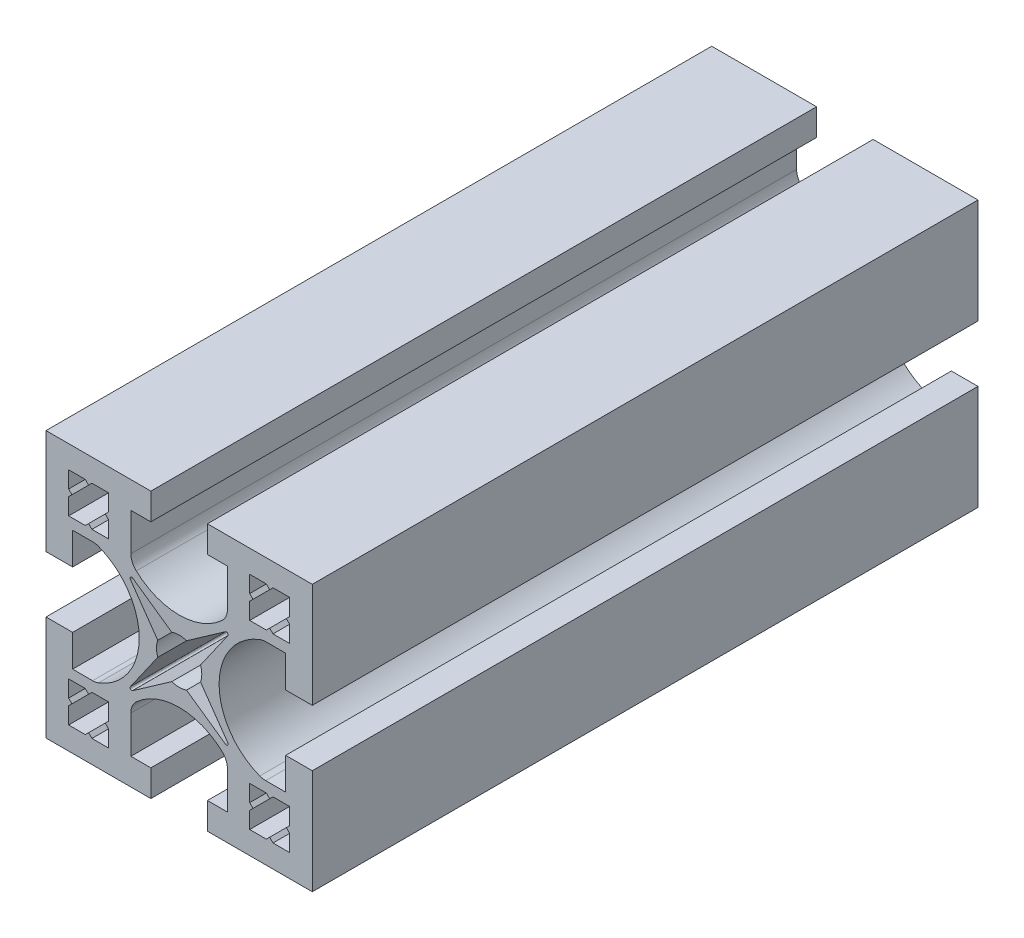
ISO-10303-21;
HEADER;
FILE_DESCRIPTION(('STEP AP214'),'2;1');
FILE_NAME('part.step','',(''),(''),'','','');
FILE_SCHEMA(('AUTOMOTIVE_DESIGN { 1 0 10303 214 1 1 1 1 }'));
ENDSEC;
DATA;
#1=APPLICATION_CONTEXT('core data for automotive mechanical design processes');
#2=APPLICATION_PROTOCOL_DEFINITION('international standard','automotive_design',2000,#1);
#3=PRODUCT_CONTEXT('',#1,'mechanical');
#4=PRODUCT('Part','Part','',(#3));
#5=PRODUCT_RELATED_PRODUCT_CATEGORY('part','',(#4));
#6=PRODUCT_DEFINITION_FORMATION('','',#4);
#7=PRODUCT_DEFINITION_CONTEXT('part definition',#1,'design');
#8=PRODUCT_DEFINITION('design','',#6,#7);
#9=PRODUCT_DEFINITION_SHAPE('','',#8);
#10=(LENGTH_UNIT() NAMED_UNIT(*) SI_UNIT(.MILLI.,.METRE.));
#11=(NAMED_UNIT(*) PLANE_ANGLE_UNIT() SI_UNIT($,.RADIAN.));
#12=(NAMED_UNIT(*) SI_UNIT($,.STERADIAN.) SOLID_ANGLE_UNIT());
#13=UNCERTAINTY_MEASURE_WITH_UNIT(LENGTH_MEASURE(1.E-05),#10,'distance_accuracy_value','');
#14=(GEOMETRIC_REPRESENTATION_CONTEXT(3) GLOBAL_UNCERTAINTY_ASSIGNED_CONTEXT((#13)) GLOBAL_UNIT_ASSIGNED_CONTEXT((#10,
#11,#12)) REPRESENTATION_CONTEXT('',''));
#15=CARTESIAN_POINT('',(0.,0.,0.));
#16=DIRECTION('',(0.,0.,1.));
#17=DIRECTION('',(1.,0.,0.));
#18=AXIS2_PLACEMENT_3D('',#15,#16,#17);
#19=CARTESIAN_POINT('',(-13.,6.53834841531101,50.));
#20=DIRECTION('',(0.,0.,-1.));
#21=DIRECTION('',(-1.,0.,0.));
#22=AXIS2_PLACEMENT_3D('',#19,#20,#21);
#23=PLANE('',#22);
#24=DIRECTION('',(0.707106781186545,0.70710678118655,0.));
#25=VECTOR('',#24,1.);
#26=CARTESIAN_POINT('',(13.6,-16.1,50.));
#27=LINE('',#26,#25);
#28=CARTESIAN_POINT('',(13.1,-16.6,50.));
#29=VERTEX_POINT('',#28);
#30=CARTESIAN_POINT('',(13.6,-16.1,50.));
#31=VERTEX_POINT('',#30);
#32=EDGE_CURVE('E919',#29,#31,#27,.T.);
#33=ORIENTED_EDGE('',*,*,#32,.F.);
#34=DIRECTION('',(1.,0.,0.));
#35=VECTOR('',#34,1.);
#36=CARTESIAN_POINT('',(13.1,-16.6,50.));
#37=LINE('',#36,#35);
#38=CARTESIAN_POINT('',(10.6,-16.6,50.));
#39=VERTEX_POINT('',#38);
#40=EDGE_CURVE('E951',#39,#29,#37,.T.);
#41=ORIENTED_EDGE('',*,*,#40,.F.);
#42=DIRECTION('',(0.,-1.,0.));
#43=VECTOR('',#42,1.);
#44=CARTESIAN_POINT('',(10.6,-16.6,50.));
#45=LINE('',#44,#43);
#46=CARTESIAN_POINT('',(10.6,-14.1,50.));
#47=VERTEX_POINT('',#46);
#48=EDGE_CURVE('E948',#47,#39,#45,.T.);
#49=ORIENTED_EDGE('',*,*,#48,.F.);
#50=DIRECTION('',(-0.707106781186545,-0.70710678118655,0.));
#51=VECTOR('',#50,1.);
#52=CARTESIAN_POINT('',(10.6,-14.1,50.));
#53=LINE('',#52,#51);
#54=CARTESIAN_POINT('',(11.1,-13.6,50.));
#55=VERTEX_POINT('',#54);
#56=EDGE_CURVE('E946',#55,#47,#53,.T.);
#57=ORIENTED_EDGE('',*,*,#56,.F.);
#58=DIRECTION('',(0.707106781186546,-0.707106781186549,0.));
#59=VECTOR('',#58,1.);
#60=CARTESIAN_POINT('',(11.1,-13.6,50.));
#61=LINE('',#60,#59);
#62=CARTESIAN_POINT('',(10.6,-13.1,50.));
#63=VERTEX_POINT('',#62);
#64=EDGE_CURVE('E944',#63,#55,#61,.T.);
#65=ORIENTED_EDGE('',*,*,#64,.F.);
#66=DIRECTION('',(0.,-1.,0.));
#67=VECTOR('',#66,1.);
#68=CARTESIAN_POINT('',(10.6,-13.1,50.));
#69=LINE('',#68,#67);
#70=CARTESIAN_POINT('',(10.6,-10.6,50.));
#71=VERTEX_POINT('',#70);
#72=EDGE_CURVE('E942',#71,#63,#69,.T.);
#73=ORIENTED_EDGE('',*,*,#72,.F.);
#74=DIRECTION('',(-1.,0.,0.));
#75=VECTOR('',#74,1.);
#76=CARTESIAN_POINT('',(10.6,-10.6,50.));
#77=LINE('',#76,#75);
#78=CARTESIAN_POINT('',(13.1,-10.6,50.));
#79=VERTEX_POINT('',#78);
#80=EDGE_CURVE('E940',#79,#71,#77,.T.);
#81=ORIENTED_EDGE('',*,*,#80,.F.);
#82=DIRECTION('',(-0.707106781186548,0.707106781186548,0.));
#83=VECTOR('',#82,1.);
#84=CARTESIAN_POINT('',(13.1,-10.6,50.));
#85=LINE('',#84,#83);
#86=CARTESIAN_POINT('',(13.6,-11.1,50.));
#87=VERTEX_POINT('',#86);
#88=EDGE_CURVE('E938',#87,#79,#85,.T.);
#89=ORIENTED_EDGE('',*,*,#88,.F.);
#90=DIRECTION('',(-0.707106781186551,-0.707106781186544,0.));
#91=VECTOR('',#90,1.);
#92=CARTESIAN_POINT('',(13.6,-11.1,50.));
#93=LINE('',#92,#91);
#94=CARTESIAN_POINT('',(14.1,-10.6,50.));
#95=VERTEX_POINT('',#94);
#96=EDGE_CURVE('E936',#95,#87,#93,.T.);
#97=ORIENTED_EDGE('',*,*,#96,.F.);
#98=DIRECTION('',(-1.,0.,0.));
#99=VECTOR('',#98,1.);
#100=CARTESIAN_POINT('',(14.1,-10.6,50.));
#101=LINE('',#100,#99);
#102=CARTESIAN_POINT('',(16.6,-10.6,50.));
#103=VERTEX_POINT('',#102);
#104=EDGE_CURVE('E934',#103,#95,#101,.T.);
#105=ORIENTED_EDGE('',*,*,#104,.F.);
#106=DIRECTION('',(0.,1.,0.));
#107=VECTOR('',#106,1.);
#108=CARTESIAN_POINT('',(16.6,-10.6,50.));
#109=LINE('',#108,#107);
#110=CARTESIAN_POINT('',(16.6,-13.1,50.));
#111=VERTEX_POINT('',#110);
#112=EDGE_CURVE('E932',#111,#103,#109,.T.);
#113=ORIENTED_EDGE('',*,*,#112,.F.);
#114=DIRECTION('',(0.707106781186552,0.707106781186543,0.));
#115=VECTOR('',#114,1.);
#116=CARTESIAN_POINT('',(16.6,-13.1,50.));
#117=LINE('',#116,#115);
#118=CARTESIAN_POINT('',(16.1,-13.6,50.));
#119=VERTEX_POINT('',#118);
#120=EDGE_CURVE('E930',#119,#111,#117,.T.);
#121=ORIENTED_EDGE('',*,*,#120,.F.);
#122=DIRECTION('',(-0.707106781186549,0.707106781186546,0.));
#123=VECTOR('',#122,1.);
#124=CARTESIAN_POINT('',(16.1,-13.6,50.));
#125=LINE('',#124,#123);
#126=CARTESIAN_POINT('',(16.6,-14.1,50.));
#127=VERTEX_POINT('',#126);
#128=EDGE_CURVE('E928',#127,#119,#125,.T.);
#129=ORIENTED_EDGE('',*,*,#128,.F.);
#130=DIRECTION('',(0.,1.,0.));
#131=VECTOR('',#130,1.);
#132=CARTESIAN_POINT('',(16.6,-14.1,50.));
#133=LINE('',#132,#131);
#134=CARTESIAN_POINT('',(16.6,-16.6,50.));
#135=VERTEX_POINT('',#134);
#136=EDGE_CURVE('E926',#135,#127,#133,.T.);
#137=ORIENTED_EDGE('',*,*,#136,.F.);
#138=DIRECTION('',(1.,0.,0.));
#139=VECTOR('',#138,1.);
#140=CARTESIAN_POINT('',(16.6,-16.6,50.));
#141=LINE('',#140,#139);
#142=CARTESIAN_POINT('',(14.1,-16.6,50.));
#143=VERTEX_POINT('',#142);
#144=EDGE_CURVE('E924',#143,#135,#141,.T.);
#145=ORIENTED_EDGE('',*,*,#144,.F.);
#146=DIRECTION('',(0.70710678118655,-0.707106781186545,0.));
#147=VECTOR('',#146,1.);
#148=CARTESIAN_POINT('',(14.1,-16.6,50.));
#149=LINE('',#148,#147);
#150=EDGE_CURVE('E921',#31,#143,#149,.T.);
#151=ORIENTED_EDGE('',*,*,#150,.F.);
#152=EDGE_LOOP('',(#33,#41,#49,#57,#65,#73,#81,#89,#97,#105,#113,#121,#129,#137,#145,#151));
#153=FACE_BOUND('',#152,.T.);
#154=DIRECTION('',(0.,-1.,0.));
#155=VECTOR('',#154,1.);
#156=CARTESIAN_POINT('',(-16.6,14.1,50.));
#157=LINE('',#156,#155);
#158=CARTESIAN_POINT('',(-16.6,16.6,50.));
#159=VERTEX_POINT('',#158);
#160=CARTESIAN_POINT('',(-16.6,14.1,50.));
#161=VERTEX_POINT('',#160);
#162=EDGE_CURVE('E1149',#159,#161,#157,.T.);
#163=ORIENTED_EDGE('',*,*,#162,.F.);
#164=DIRECTION('',(-1.,0.,0.));
#165=VECTOR('',#164,1.);
#166=CARTESIAN_POINT('',(-16.6,16.6,50.));
#167=LINE('',#166,#165);
#168=CARTESIAN_POINT('',(-14.1,16.6,50.));
#169=VERTEX_POINT('',#168);
#170=EDGE_CURVE('E1181',#169,#159,#167,.T.);
#171=ORIENTED_EDGE('',*,*,#170,.F.);
#172=DIRECTION('',(-0.70710678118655,0.707106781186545,0.));
#173=VECTOR('',#172,1.);
#174=CARTESIAN_POINT('',(-14.1,16.6,50.));
#175=LINE('',#174,#173);
#176=CARTESIAN_POINT('',(-13.6,16.1,50.));
#177=VERTEX_POINT('',#176);
#178=EDGE_CURVE('E1178',#177,#169,#175,.T.);
#179=ORIENTED_EDGE('',*,*,#178,.F.);
#180=DIRECTION('',(-0.707106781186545,-0.70710678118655,0.));
#181=VECTOR('',#180,1.);
#182=CARTESIAN_POINT('',(-13.6,16.1,50.));
#183=LINE('',#182,#181);
#184=CARTESIAN_POINT('',(-13.1,16.6,50.));
#185=VERTEX_POINT('',#184);
#186=EDGE_CURVE('E1176',#185,#177,#183,.T.);
#187=ORIENTED_EDGE('',*,*,#186,.F.);
#188=DIRECTION('',(-1.,0.,0.));
#189=VECTOR('',#188,1.);
#190=CARTESIAN_POINT('',(-13.1,16.6,50.));
#191=LINE('',#190,#189);
#192=CARTESIAN_POINT('',(-10.6,16.6,50.));
#193=VERTEX_POINT('',#192);
#194=EDGE_CURVE('E1174',#193,#185,#191,.T.);
#195=ORIENTED_EDGE('',*,*,#194,.F.);
#196=DIRECTION('',(0.,1.,0.));
#197=VECTOR('',#196,1.);
#198=CARTESIAN_POINT('',(-10.6,16.6,50.));
#199=LINE('',#198,#197);
#200=CARTESIAN_POINT('',(-10.6,14.1,50.));
#201=VERTEX_POINT('',#200);
#202=EDGE_CURVE('E1172',#201,#193,#199,.T.);
#203=ORIENTED_EDGE('',*,*,#202,.F.);
#204=DIRECTION('',(0.707106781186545,0.70710678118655,0.));
#205=VECTOR('',#204,1.);
#206=CARTESIAN_POINT('',(-10.6,14.1,50.));
#207=LINE('',#206,#205);
#208=CARTESIAN_POINT('',(-11.1,13.6,50.));
#209=VERTEX_POINT('',#208);
#210=EDGE_CURVE('E1170',#209,#201,#207,.T.);
#211=ORIENTED_EDGE('',*,*,#210,.F.);
#212=DIRECTION('',(-0.707106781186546,0.707106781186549,0.));
#213=VECTOR('',#212,1.);
#214=CARTESIAN_POINT('',(-11.1,13.6,50.));
#215=LINE('',#214,#213);
#216=CARTESIAN_POINT('',(-10.6,13.1,50.));
#217=VERTEX_POINT('',#216);
#218=EDGE_CURVE('E1168',#217,#209,#215,.T.);
#219=ORIENTED_EDGE('',*,*,#218,.F.);
#220=DIRECTION('',(0.,1.,0.));
#221=VECTOR('',#220,1.);
#222=CARTESIAN_POINT('',(-10.6,13.1,50.));
#223=LINE('',#222,#221);
#224=CARTESIAN_POINT('',(-10.6,10.6,50.));
#225=VERTEX_POINT('',#224);
#226=EDGE_CURVE('E1166',#225,#217,#223,.T.);
#227=ORIENTED_EDGE('',*,*,#226,.F.);
#228=DIRECTION('',(1.,0.,0.));
#229=VECTOR('',#228,1.);
#230=CARTESIAN_POINT('',(-10.6,10.6,50.));
#231=LINE('',#230,#229);
#232=CARTESIAN_POINT('',(-13.1,10.6,50.));
#233=VERTEX_POINT('',#232);
#234=EDGE_CURVE('E1164',#233,#225,#231,.T.);
#235=ORIENTED_EDGE('',*,*,#234,.F.);
#236=DIRECTION('',(0.707106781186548,-0.707106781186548,0.));
#237=VECTOR('',#236,1.);
#238=CARTESIAN_POINT('',(-13.1,10.6,50.));
#239=LINE('',#238,#237);
#240=CARTESIAN_POINT('',(-13.6,11.1,50.));
#241=VERTEX_POINT('',#240);
#242=EDGE_CURVE('E1162',#241,#233,#239,.T.);
#243=ORIENTED_EDGE('',*,*,#242,.F.);
#244=DIRECTION('',(0.707106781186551,0.707106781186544,0.));
#245=VECTOR('',#244,1.);
#246=CARTESIAN_POINT('',(-13.6,11.1,50.));
#247=LINE('',#246,#245);
#248=CARTESIAN_POINT('',(-14.1,10.6,50.));
#249=VERTEX_POINT('',#248);
#250=EDGE_CURVE('E1160',#249,#241,#247,.T.);
#251=ORIENTED_EDGE('',*,*,#250,.F.);
#252=DIRECTION('',(1.,0.,0.));
#253=VECTOR('',#252,1.);
#254=CARTESIAN_POINT('',(-14.1,10.6,50.));
#255=LINE('',#254,#253);
#256=CARTESIAN_POINT('',(-16.6,10.6,50.));
#257=VERTEX_POINT('',#256);
#258=EDGE_CURVE('E1158',#257,#249,#255,.T.);
#259=ORIENTED_EDGE('',*,*,#258,.F.);
#260=DIRECTION('',(0.,-1.,0.));
#261=VECTOR('',#260,1.);
#262=CARTESIAN_POINT('',(-16.6,10.6,50.));
#263=LINE('',#262,#261);
#264=CARTESIAN_POINT('',(-16.6,13.1,50.));
#265=VERTEX_POINT('',#264);
#266=EDGE_CURVE('E1156',#265,#257,#263,.T.);
#267=ORIENTED_EDGE('',*,*,#266,.F.);
#268=DIRECTION('',(-0.707106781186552,-0.707106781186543,0.));
#269=VECTOR('',#268,1.);
#270=CARTESIAN_POINT('',(-16.6,13.1,50.));
#271=LINE('',#270,#269);
#272=CARTESIAN_POINT('',(-16.1,13.6,50.));
#273=VERTEX_POINT('',#272);
#274=EDGE_CURVE('E1154',#273,#265,#271,.T.);
#275=ORIENTED_EDGE('',*,*,#274,.F.);
#276=DIRECTION('',(0.707106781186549,-0.707106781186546,0.));
#277=VECTOR('',#276,1.);
#278=CARTESIAN_POINT('',(-16.1,13.6,50.));
#279=LINE('',#278,#277);
#280=EDGE_CURVE('E1151',#161,#273,#279,.T.);
#281=ORIENTED_EDGE('',*,*,#280,.F.);
#282=EDGE_LOOP('',(#163,#171,#179,#187,#195,#203,#211,#219,#227,#235,#243,#251,#259,#267,#275,#281));
#283=FACE_BOUND('',#282,.T.);
#284=DIRECTION('',(1.,0.,0.));
#285=VECTOR('',#284,1.);
#286=CARTESIAN_POINT('',(-20.,4.25,50.));
#287=LINE('',#286,#285);
#288=CARTESIAN_POINT('',(-20.,4.25,50.));
#289=VERTEX_POINT('',#288);
#290=CARTESIAN_POINT('',(-16.,4.25,50.));
#291=VERTEX_POINT('',#290);
#292=EDGE_CURVE('E1379',#289,#291,#287,.T.);
#293=ORIENTED_EDGE('',*,*,#292,.T.);
#294=DIRECTION('',(0.,1.,0.));
#295=VECTOR('',#294,1.);
#296=CARTESIAN_POINT('',(-16.,4.25,50.));
#297=LINE('',#296,#295);
#298=CARTESIAN_POINT('',(-16.,9.03834841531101,50.));
#299=VERTEX_POINT('',#298);
#300=EDGE_CURVE('E1382',#291,#299,#297,.T.);
#301=ORIENTED_EDGE('',*,*,#300,.T.);
#302=DIRECTION('',(1.,0.,0.));
#303=VECTOR('',#302,1.);
#304=CARTESIAN_POINT('',(-16.,9.03834841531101,50.));
#305=LINE('',#304,#303);
#306=CARTESIAN_POINT('',(-13.,9.03834841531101,50.));
#307=VERTEX_POINT('',#306);
#308=EDGE_CURVE('E1385',#299,#307,#305,.T.);
#309=ORIENTED_EDGE('',*,*,#308,.T.);
#310=CARTESIAN_POINT('',(-13.,6.53834841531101,50.));
#311=DIRECTION('',(0.,0.,-1.));
#312=DIRECTION('',(-1.,0.,0.));
#313=AXIS2_PLACEMENT_3D('',#310,#311,#312);
#314=CIRCLE('',#313,2.5);
#315=CARTESIAN_POINT('',(-12.1071428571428,8.87347284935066,50.));
#316=VERTEX_POINT('',#315);
#317=EDGE_CURVE('E1387',#307,#316,#314,.T.);
#318=ORIENTED_EDGE('',*,*,#317,.T.);
#319=CARTESIAN_POINT('',(-15.5,0.,50.));
#320=DIRECTION('',(0.,0.,-1.));
#321=DIRECTION('',(-1.,0.,0.));
#322=AXIS2_PLACEMENT_3D('',#319,#320,#321);
#323=CIRCLE('',#322,9.50000000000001);
#324=CARTESIAN_POINT('',(-12.1071428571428,-8.87347284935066,50.));
#325=VERTEX_POINT('',#324);
#326=EDGE_CURVE('E1389',#316,#325,#323,.T.);
#327=ORIENTED_EDGE('',*,*,#326,.T.);
#328=CARTESIAN_POINT('',(-13.,-6.53834841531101,50.));
#329=DIRECTION('',(0.,0.,-1.));
#330=DIRECTION('',(1.,0.,0.));
#331=AXIS2_PLACEMENT_3D('',#328,#329,#330);
#332=CIRCLE('',#331,2.5);
#333=CARTESIAN_POINT('',(-13.,-9.03834841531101,50.));
#334=VERTEX_POINT('',#333);
#335=EDGE_CURVE('E1391',#325,#334,#332,.T.);
#336=ORIENTED_EDGE('',*,*,#335,.T.);
#337=DIRECTION('',(-1.,0.,0.));
#338=VECTOR('',#337,1.);
#339=CARTESIAN_POINT('',(-16.,-9.03834841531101,50.));
#340=LINE('',#339,#338);
#341=CARTESIAN_POINT('',(-16.,-9.03834841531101,50.));
#342=VERTEX_POINT('',#341);
#343=EDGE_CURVE('E1393',#334,#342,#340,.T.);
#344=ORIENTED_EDGE('',*,*,#343,.T.);
#345=DIRECTION('',(0.,1.,0.));
#346=VECTOR('',#345,1.);
#347=CARTESIAN_POINT('',(-16.,-4.25,50.));
#348=LINE('',#347,#346);
#349=CARTESIAN_POINT('',(-16.,-4.25,50.));
#350=VERTEX_POINT('',#349);
#351=EDGE_CURVE('E1395',#342,#350,#348,.T.);
#352=ORIENTED_EDGE('',*,*,#351,.T.);
#353=DIRECTION('',(-1.,0.,0.));
#354=VECTOR('',#353,1.);
#355=CARTESIAN_POINT('',(-20.,-4.25000000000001,50.));
#356=LINE('',#355,#354);
#357=CARTESIAN_POINT('',(-20.,-4.25000000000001,50.));
#358=VERTEX_POINT('',#357);
#359=EDGE_CURVE('E1397',#350,#358,#356,.T.);
#360=ORIENTED_EDGE('',*,*,#359,.T.);
#361=DIRECTION('',(0.,-1.,0.));
#362=VECTOR('',#361,1.);
#363=CARTESIAN_POINT('',(-20.,-4.25000000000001,50.));
#364=LINE('',#363,#362);
#365=CARTESIAN_POINT('',(-20.,-20.,50.));
#366=VERTEX_POINT('',#365);
#367=EDGE_CURVE('E1399',#358,#366,#364,.T.);
#368=ORIENTED_EDGE('',*,*,#367,.T.);
#369=DIRECTION('',(1.,0.,0.));
#370=VECTOR('',#369,1.);
#371=CARTESIAN_POINT('',(-20.,-20.,50.));
#372=LINE('',#371,#370);
#373=CARTESIAN_POINT('',(-4.24999999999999,-20.,50.));
#374=VERTEX_POINT('',#373);
#375=EDGE_CURVE('E1401',#366,#374,#372,.T.);
#376=ORIENTED_EDGE('',*,*,#375,.T.);
#377=DIRECTION('',(0.,1.,0.));
#378=VECTOR('',#377,1.);
#379=CARTESIAN_POINT('',(-4.24999999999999,-20.,50.));
#380=LINE('',#379,#378);
#381=CARTESIAN_POINT('',(-4.24999999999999,-16.,50.));
#382=VERTEX_POINT('',#381);
#383=EDGE_CURVE('E1403',#374,#382,#380,.T.);
#384=ORIENTED_EDGE('',*,*,#383,.T.);
#385=DIRECTION('',(-1.,0.,0.));
#386=VECTOR('',#385,1.);
#387=CARTESIAN_POINT('',(-4.24999999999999,-16.,50.));
#388=LINE('',#387,#386);
#389=CARTESIAN_POINT('',(-7.24999999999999,-16.,50.));
#390=VERTEX_POINT('',#389);
#391=EDGE_CURVE('E1405',#382,#390,#388,.T.);
#392=ORIENTED_EDGE('',*,*,#391,.T.);
#393=DIRECTION('',(0.,1.,0.));
#394=VECTOR('',#393,1.);
#395=CARTESIAN_POINT('',(-7.24999999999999,-16.,50.));
#396=LINE('',#395,#394);
#397=CARTESIAN_POINT('',(-7.24999999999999,-10.3582590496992,50.));
#398=VERTEX_POINT('',#397);
#399=EDGE_CURVE('E1407',#390,#398,#396,.T.);
#400=ORIENTED_EDGE('',*,*,#399,.T.);
#401=CARTESIAN_POINT('',(-4.74999999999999,-10.3582590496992,50.));
#402=DIRECTION('',(0.,0.,-1.));
#403=DIRECTION('',(-1.,0.,0.));
#404=AXIS2_PLACEMENT_3D('',#401,#402,#403);
#405=CIRCLE('',#404,2.5);
#406=CARTESIAN_POINT('',(-6.44642857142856,-8.52192299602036,50.));
#407=VERTEX_POINT('',#406);
#408=EDGE_CURVE('E1409',#398,#407,#405,.T.);
#409=ORIENTED_EDGE('',*,*,#408,.T.);
#410=CARTESIAN_POINT('',(0.,-15.5,50.));
#411=DIRECTION('',(0.,0.,-1.));
#412=DIRECTION('',(-1.,0.,0.));
#413=AXIS2_PLACEMENT_3D('',#410,#411,#412);
#414=CIRCLE('',#413,9.5);
#415=CARTESIAN_POINT('',(6.44642857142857,-8.52192299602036,50.));
#416=VERTEX_POINT('',#415);
#417=EDGE_CURVE('E1411',#407,#416,#414,.T.);
#418=ORIENTED_EDGE('',*,*,#417,.T.);
#419=CARTESIAN_POINT('',(4.75,-10.3582590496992,50.));
#420=DIRECTION('',(0.,0.,-1.));
#421=DIRECTION('',(1.,0.,0.));
#422=AXIS2_PLACEMENT_3D('',#419,#420,#421);
#423=CIRCLE('',#422,2.5);
#424=CARTESIAN_POINT('',(7.25,-10.3582590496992,50.));
#425=VERTEX_POINT('',#424);
#426=EDGE_CURVE('E1413',#416,#425,#423,.T.);
#427=ORIENTED_EDGE('',*,*,#426,.T.);
#428=DIRECTION('',(0.,-1.,0.));
#429=VECTOR('',#428,1.);
#430=CARTESIAN_POINT('',(7.25,-16.,50.));
#431=LINE('',#430,#429);
#432=CARTESIAN_POINT('',(7.25,-16.,50.));
#433=VERTEX_POINT('',#432);
#434=EDGE_CURVE('E1415',#425,#433,#431,.T.);
#435=ORIENTED_EDGE('',*,*,#434,.T.);
#436=DIRECTION('',(-1.,0.,0.));
#437=VECTOR('',#436,1.);
#438=CARTESIAN_POINT('',(4.25,-16.,50.));
#439=LINE('',#438,#437);
#440=CARTESIAN_POINT('',(4.25,-16.,50.));
#441=VERTEX_POINT('',#440);
#442=EDGE_CURVE('E1417',#433,#441,#439,.T.);
#443=ORIENTED_EDGE('',*,*,#442,.T.);
#444=DIRECTION('',(0.,-1.,0.));
#445=VECTOR('',#444,1.);
#446=CARTESIAN_POINT('',(4.25,-20.,50.));
#447=LINE('',#446,#445);
#448=CARTESIAN_POINT('',(4.25,-20.,50.));
#449=VERTEX_POINT('',#448);
#450=EDGE_CURVE('E1419',#441,#449,#447,.T.);
#451=ORIENTED_EDGE('',*,*,#450,.T.);
#452=DIRECTION('',(1.,0.,0.));
#453=VECTOR('',#452,1.);
#454=CARTESIAN_POINT('',(20.,-20.,50.));
#455=LINE('',#454,#453);
#456=CARTESIAN_POINT('',(20.,-20.,50.));
#457=VERTEX_POINT('',#456);
#458=EDGE_CURVE('E1421',#449,#457,#455,.T.);
#459=ORIENTED_EDGE('',*,*,#458,.T.);
#460=DIRECTION('',(0.,1.,0.));
#461=VECTOR('',#460,1.);
#462=CARTESIAN_POINT('',(20.,-4.24999999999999,50.));
#463=LINE('',#462,#461);
#464=CARTESIAN_POINT('',(20.,-4.24999999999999,50.));
#465=VERTEX_POINT('',#464);
#466=EDGE_CURVE('E1423',#457,#465,#463,.T.);
#467=ORIENTED_EDGE('',*,*,#466,.T.);
#468=DIRECTION('',(-1.,0.,0.));
#469=VECTOR('',#468,1.);
#470=CARTESIAN_POINT('',(20.,-4.24999999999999,50.));
#471=LINE('',#470,#469);
#472=CARTESIAN_POINT('',(16.,-4.25,50.));
#473=VERTEX_POINT('',#472);
#474=EDGE_CURVE('E1425',#465,#473,#471,.T.);
#475=ORIENTED_EDGE('',*,*,#474,.T.);
#476=DIRECTION('',(0.,-1.,0.));
#477=VECTOR('',#476,1.);
#478=CARTESIAN_POINT('',(16.,-4.25,50.));
#479=LINE('',#478,#477);
#480=CARTESIAN_POINT('',(16.,-9.03834841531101,50.));
#481=VERTEX_POINT('',#480);
#482=EDGE_CURVE('E1427',#473,#481,#479,.T.);
#483=ORIENTED_EDGE('',*,*,#482,.T.);
#484=DIRECTION('',(-1.,0.,0.));
#485=VECTOR('',#484,1.);
#486=CARTESIAN_POINT('',(16.,-9.03834841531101,50.));
#487=LINE('',#486,#485);
#488=CARTESIAN_POINT('',(13.,-9.03834841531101,50.));
#489=VERTEX_POINT('',#488);
#490=EDGE_CURVE('E1429',#481,#489,#487,.T.);
#491=ORIENTED_EDGE('',*,*,#490,.T.);
#492=CARTESIAN_POINT('',(13.,-6.53834841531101,50.));
#493=DIRECTION('',(0.,0.,-1.));
#494=DIRECTION('',(-1.,0.,0.));
#495=AXIS2_PLACEMENT_3D('',#492,#493,#494);
#496=CIRCLE('',#495,2.5);
#497=CARTESIAN_POINT('',(12.1071428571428,-8.87347284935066,50.));
#498=VERTEX_POINT('',#497);
#499=EDGE_CURVE('E1431',#489,#498,#496,.T.);
#500=ORIENTED_EDGE('',*,*,#499,.T.);
#501=CARTESIAN_POINT('',(15.5,0.,50.));
#502=DIRECTION('',(0.,0.,-1.));
#503=DIRECTION('',(1.,0.,0.));
#504=AXIS2_PLACEMENT_3D('',#501,#502,#503);
#505=CIRCLE('',#504,9.5);
#506=CARTESIAN_POINT('',(12.1071428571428,8.87347284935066,50.));
#507=VERTEX_POINT('',#506);
#508=EDGE_CURVE('E1433',#498,#507,#505,.T.);
#509=ORIENTED_EDGE('',*,*,#508,.T.);
#510=CARTESIAN_POINT('',(13.,6.53834841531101,50.));
#511=DIRECTION('',(0.,0.,-1.));
#512=DIRECTION('',(1.,0.,0.));
#513=AXIS2_PLACEMENT_3D('',#510,#511,#512);
#514=CIRCLE('',#513,2.5);
#515=CARTESIAN_POINT('',(13.,9.03834841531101,50.));
#516=VERTEX_POINT('',#515);
#517=EDGE_CURVE('E1435',#507,#516,#514,.T.);
#518=ORIENTED_EDGE('',*,*,#517,.T.);
#519=DIRECTION('',(1.,0.,0.));
#520=VECTOR('',#519,1.);
#521=CARTESIAN_POINT('',(16.,9.03834841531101,50.));
#522=LINE('',#521,#520);
#523=CARTESIAN_POINT('',(16.,9.03834841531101,50.));
#524=VERTEX_POINT('',#523);
#525=EDGE_CURVE('E1437',#516,#524,#522,.T.);
#526=ORIENTED_EDGE('',*,*,#525,.T.);
#527=DIRECTION('',(0.,-1.,0.));
#528=VECTOR('',#527,1.);
#529=CARTESIAN_POINT('',(16.,4.25,50.));
#530=LINE('',#529,#528);
#531=CARTESIAN_POINT('',(16.,4.25,50.));
#532=VERTEX_POINT('',#531);
#533=EDGE_CURVE('E1439',#524,#532,#530,.T.);
#534=ORIENTED_EDGE('',*,*,#533,.T.);
#535=DIRECTION('',(1.,0.,0.));
#536=VECTOR('',#535,1.);
#537=CARTESIAN_POINT('',(20.,4.25,50.));
#538=LINE('',#537,#536);
#539=CARTESIAN_POINT('',(20.,4.25,50.));
#540=VERTEX_POINT('',#539);
#541=EDGE_CURVE('E1441',#532,#540,#538,.T.);
#542=ORIENTED_EDGE('',*,*,#541,.T.);
#543=DIRECTION('',(0.,1.,0.));
#544=VECTOR('',#543,1.);
#545=CARTESIAN_POINT('',(20.,4.25,50.));
#546=LINE('',#545,#544);
#547=CARTESIAN_POINT('',(20.,20.,50.));
#548=VERTEX_POINT('',#547);
#549=EDGE_CURVE('E1443',#540,#548,#546,.T.);
#550=ORIENTED_EDGE('',*,*,#549,.T.);
#551=DIRECTION('',(-1.,0.,0.));
#552=VECTOR('',#551,1.);
#553=CARTESIAN_POINT('',(20.,20.,50.));
#554=LINE('',#553,#552);
#555=CARTESIAN_POINT('',(4.25,20.,50.));
#556=VERTEX_POINT('',#555);
#557=EDGE_CURVE('E1445',#548,#556,#554,.T.);
#558=ORIENTED_EDGE('',*,*,#557,.T.);
#559=DIRECTION('',(0.,-1.,0.));
#560=VECTOR('',#559,1.);
#561=CARTESIAN_POINT('',(4.25,20.,50.));
#562=LINE('',#561,#560);
#563=CARTESIAN_POINT('',(4.24999999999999,16.,50.));
#564=VERTEX_POINT('',#563);
#565=EDGE_CURVE('E1447',#556,#564,#562,.T.);
#566=ORIENTED_EDGE('',*,*,#565,.T.);
#567=DIRECTION('',(1.,0.,0.));
#568=VECTOR('',#567,1.);
#569=CARTESIAN_POINT('',(4.24999999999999,16.,50.));
#570=LINE('',#569,#568);
#571=CARTESIAN_POINT('',(7.25,16.,50.));
#572=VERTEX_POINT('',#571);
#573=EDGE_CURVE('E1449',#564,#572,#570,.T.);
#574=ORIENTED_EDGE('',*,*,#573,.T.);
#575=DIRECTION('',(0.,-1.,0.));
#576=VECTOR('',#575,1.);
#577=CARTESIAN_POINT('',(7.25,16.,50.));
#578=LINE('',#577,#576);
#579=CARTESIAN_POINT('',(7.25,10.3582590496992,50.));
#580=VERTEX_POINT('',#579);
#581=EDGE_CURVE('E1451',#572,#580,#578,.T.);
#582=ORIENTED_EDGE('',*,*,#581,.T.);
#583=CARTESIAN_POINT('',(4.75,10.3582590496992,50.));
#584=DIRECTION('',(0.,0.,-1.));
#585=DIRECTION('',(-1.,0.,0.));
#586=AXIS2_PLACEMENT_3D('',#583,#584,#585);
#587=CIRCLE('',#586,2.5);
#588=CARTESIAN_POINT('',(6.44642857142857,8.52192299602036,50.));
#589=VERTEX_POINT('',#588);
#590=EDGE_CURVE('E1453',#580,#589,#587,.T.);
#591=ORIENTED_EDGE('',*,*,#590,.T.);
#592=CARTESIAN_POINT('',(0.,15.5,50.));
#593=DIRECTION('',(0.,0.,-1.));
#594=DIRECTION('',(1.,0.,0.));
#595=AXIS2_PLACEMENT_3D('',#592,#593,#594);
#596=CIRCLE('',#595,9.5);
#597=CARTESIAN_POINT('',(-6.44642857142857,8.52192299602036,50.));
#598=VERTEX_POINT('',#597);
#599=EDGE_CURVE('E1455',#589,#598,#596,.T.);
#600=ORIENTED_EDGE('',*,*,#599,.T.);
#601=CARTESIAN_POINT('',(-4.75,10.3582590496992,50.));
#602=DIRECTION('',(0.,0.,-1.));
#603=DIRECTION('',(1.,0.,0.));
#604=AXIS2_PLACEMENT_3D('',#601,#602,#603);
#605=CIRCLE('',#604,2.5);
#606=CARTESIAN_POINT('',(-7.25,10.3582590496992,50.));
#607=VERTEX_POINT('',#606);
#608=EDGE_CURVE('E1457',#598,#607,#605,.T.);
#609=ORIENTED_EDGE('',*,*,#608,.T.);
#610=DIRECTION('',(0.,1.,0.));
#611=VECTOR('',#610,1.);
#612=CARTESIAN_POINT('',(-7.25,16.,50.));
#613=LINE('',#612,#611);
#614=CARTESIAN_POINT('',(-7.25,16.,50.));
#615=VERTEX_POINT('',#614);
#616=EDGE_CURVE('E1459',#607,#615,#613,.T.);
#617=ORIENTED_EDGE('',*,*,#616,.T.);
#618=DIRECTION('',(1.,0.,0.));
#619=VECTOR('',#618,1.);
#620=CARTESIAN_POINT('',(-4.24999999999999,16.,50.));
#621=LINE('',#620,#619);
#622=CARTESIAN_POINT('',(-4.24999999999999,16.,50.));
#623=VERTEX_POINT('',#622);
#624=EDGE_CURVE('E1461',#615,#623,#621,.T.);
#625=ORIENTED_EDGE('',*,*,#624,.T.);
#626=DIRECTION('',(0.,1.,0.));
#627=VECTOR('',#626,1.);
#628=CARTESIAN_POINT('',(-4.25,20.,50.));
#629=LINE('',#628,#627);
#630=CARTESIAN_POINT('',(-4.25,20.,50.));
#631=VERTEX_POINT('',#630);
#632=EDGE_CURVE('E1463',#623,#631,#629,.T.);
#633=ORIENTED_EDGE('',*,*,#632,.T.);
#634=DIRECTION('',(-1.,0.,0.));
#635=VECTOR('',#634,1.);
#636=CARTESIAN_POINT('',(-20.,20.,50.));
#637=LINE('',#636,#635);
#638=CARTESIAN_POINT('',(-20.,20.,50.));
#639=VERTEX_POINT('',#638);
#640=EDGE_CURVE('E1465',#631,#639,#637,.T.);
#641=ORIENTED_EDGE('',*,*,#640,.T.);
#642=DIRECTION('',(0.,-1.,0.));
#643=VECTOR('',#642,1.);
#644=CARTESIAN_POINT('',(-20.,4.25,50.));
#645=LINE('',#644,#643);
#646=EDGE_CURVE('E1467',#639,#289,#645,.T.);
#647=ORIENTED_EDGE('',*,*,#646,.T.);
#648=EDGE_LOOP('',(#293,#301,#309,#318,#327,#336,#344,#352,#360,#368,#376,#384,#392,#400,#409,
#418,#427,#435,#443,#451,#459,#467,#475,#483,#491,#500,#509,#518,#526,#534,#542,#550,#558,#566,
#574,#582,#591,#600,#609,#617,#625,#633,#641,#647));
#649=FACE_BOUND('',#648,.T.);
#650=DIRECTION('',(0.707106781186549,0.707106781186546,0.));
#651=VECTOR('',#650,1.);
#652=CARTESIAN_POINT('',(16.1,13.6,50.));
#653=LINE('',#652,#651);
#654=CARTESIAN_POINT('',(16.1,13.6,50.));
#655=VERTEX_POINT('',#654);
#656=CARTESIAN_POINT('',(16.6,14.1,50.));
#657=VERTEX_POINT('',#656);
#658=EDGE_CURVE('E1264',#655,#657,#653,.T.);
#659=ORIENTED_EDGE('',*,*,#658,.F.);
#660=DIRECTION('',(-0.707106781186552,0.707106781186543,0.));
#661=VECTOR('',#660,1.);
#662=CARTESIAN_POINT('',(16.6,13.1,50.));
#663=LINE('',#662,#661);
#664=CARTESIAN_POINT('',(16.6,13.1,50.));
#665=VERTEX_POINT('',#664);
#666=EDGE_CURVE('E1296',#665,#655,#663,.T.);
#667=ORIENTED_EDGE('',*,*,#666,.F.);
#668=DIRECTION('',(0.,1.,0.));
#669=VECTOR('',#668,1.);
#670=CARTESIAN_POINT('',(16.6,10.6,50.));
#671=LINE('',#670,#669);
#672=CARTESIAN_POINT('',(16.6,10.6,50.));
#673=VERTEX_POINT('',#672);
#674=EDGE_CURVE('E1293',#673,#665,#671,.T.);
#675=ORIENTED_EDGE('',*,*,#674,.F.);
#676=DIRECTION('',(1.,0.,0.));
#677=VECTOR('',#676,1.);
#678=CARTESIAN_POINT('',(14.1,10.6,50.));
#679=LINE('',#678,#677);
#680=CARTESIAN_POINT('',(14.1,10.6,50.));
#681=VERTEX_POINT('',#680);
#682=EDGE_CURVE('E1291',#681,#673,#679,.T.);
#683=ORIENTED_EDGE('',*,*,#682,.F.);
#684=DIRECTION('',(0.707106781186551,-0.707106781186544,0.));
#685=VECTOR('',#684,1.);
#686=CARTESIAN_POINT('',(13.6,11.1,50.));
#687=LINE('',#686,#685);
#688=CARTESIAN_POINT('',(13.6,11.1,50.));
#689=VERTEX_POINT('',#688);
#690=EDGE_CURVE('E1289',#689,#681,#687,.T.);
#691=ORIENTED_EDGE('',*,*,#690,.F.);
#692=DIRECTION('',(0.707106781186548,0.707106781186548,0.));
#693=VECTOR('',#692,1.);
#694=CARTESIAN_POINT('',(13.1,10.6,50.));
#695=LINE('',#694,#693);
#696=CARTESIAN_POINT('',(13.1,10.6,50.));
#697=VERTEX_POINT('',#696);
#698=EDGE_CURVE('E1287',#697,#689,#695,.T.);
#699=ORIENTED_EDGE('',*,*,#698,.F.);
#700=DIRECTION('',(1.,0.,0.));
#701=VECTOR('',#700,1.);
#702=CARTESIAN_POINT('',(10.6,10.6,50.));
#703=LINE('',#702,#701);
#704=CARTESIAN_POINT('',(10.6,10.6,50.));
#705=VERTEX_POINT('',#704);
#706=EDGE_CURVE('E1285',#705,#697,#703,.T.);
#707=ORIENTED_EDGE('',*,*,#706,.F.);
#708=DIRECTION('',(0.,-1.,0.));
#709=VECTOR('',#708,1.);
#710=CARTESIAN_POINT('',(10.6,13.1,50.));
#711=LINE('',#710,#709);
#712=CARTESIAN_POINT('',(10.6,13.1,50.));
#713=VERTEX_POINT('',#712);
#714=EDGE_CURVE('E1283',#713,#705,#711,.T.);
#715=ORIENTED_EDGE('',*,*,#714,.F.);
#716=DIRECTION('',(-0.707106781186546,-0.707106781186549,0.));
#717=VECTOR('',#716,1.);
#718=CARTESIAN_POINT('',(11.1,13.6,50.));
#719=LINE('',#718,#717);
#720=CARTESIAN_POINT('',(11.1,13.6,50.));
#721=VERTEX_POINT('',#720);
#722=EDGE_CURVE('E1281',#721,#713,#719,.T.);
#723=ORIENTED_EDGE('',*,*,#722,.F.);
#724=DIRECTION('',(0.707106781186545,-0.70710678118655,0.));
#725=VECTOR('',#724,1.);
#726=CARTESIAN_POINT('',(10.6,14.1,50.));
#727=LINE('',#726,#725);
#728=CARTESIAN_POINT('',(10.6,14.1,50.));
#729=VERTEX_POINT('',#728);
#730=EDGE_CURVE('E1279',#729,#721,#727,.T.);
#731=ORIENTED_EDGE('',*,*,#730,.F.);
#732=DIRECTION('',(0.,-1.,0.));
#733=VECTOR('',#732,1.);
#734=CARTESIAN_POINT('',(10.6,16.6,50.));
#735=LINE('',#734,#733);
#736=CARTESIAN_POINT('',(10.6,16.6,50.));
#737=VERTEX_POINT('',#736);
#738=EDGE_CURVE('E1277',#737,#729,#735,.T.);
#739=ORIENTED_EDGE('',*,*,#738,.F.);
#740=DIRECTION('',(-1.,0.,0.));
#741=VECTOR('',#740,1.);
#742=CARTESIAN_POINT('',(13.1,16.6,50.));
#743=LINE('',#742,#741);
#744=CARTESIAN_POINT('',(13.1,16.6,50.));
#745=VERTEX_POINT('',#744);
#746=EDGE_CURVE('E1275',#745,#737,#743,.T.);
#747=ORIENTED_EDGE('',*,*,#746,.F.);
#748=DIRECTION('',(-0.707106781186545,0.70710678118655,0.));
#749=VECTOR('',#748,1.);
#750=CARTESIAN_POINT('',(13.6,16.1,50.));
#751=LINE('',#750,#749);
#752=CARTESIAN_POINT('',(13.6,16.1,50.));
#753=VERTEX_POINT('',#752);
#754=EDGE_CURVE('E1273',#753,#745,#751,.T.);
#755=ORIENTED_EDGE('',*,*,#754,.F.);
#756=DIRECTION('',(-0.70710678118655,-0.707106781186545,0.));
#757=VECTOR('',#756,1.);
#758=CARTESIAN_POINT('',(14.1,16.6,50.));
#759=LINE('',#758,#757);
#760=CARTESIAN_POINT('',(14.1,16.6,50.));
#761=VERTEX_POINT('',#760);
#762=EDGE_CURVE('E1271',#761,#753,#759,.T.);
#763=ORIENTED_EDGE('',*,*,#762,.F.);
#764=DIRECTION('',(-1.,0.,0.));
#765=VECTOR('',#764,1.);
#766=CARTESIAN_POINT('',(16.6,16.6,50.));
#767=LINE('',#766,#765);
#768=CARTESIAN_POINT('',(16.6,16.6,50.));
#769=VERTEX_POINT('',#768);
#770=EDGE_CURVE('E1269',#769,#761,#767,.T.);
#771=ORIENTED_EDGE('',*,*,#770,.F.);
#772=DIRECTION('',(0.,1.,0.));
#773=VECTOR('',#772,1.);
#774=CARTESIAN_POINT('',(16.6,14.1,50.));
#775=LINE('',#774,#773);
#776=EDGE_CURVE('E1266',#657,#769,#775,.T.);
#777=ORIENTED_EDGE('',*,*,#776,.F.);
#778=EDGE_LOOP('',(#659,#667,#675,#683,#691,#699,#707,#715,#723,#731,#739,#747,#755,#763,#771,#777));
#779=FACE_BOUND('',#778,.T.);
#780=CARTESIAN_POINT('',(0.,0.,50.));
#781=DIRECTION('',(0.,0.,1.));
#782=DIRECTION('',(-1.,0.,0.));
#783=AXIS2_PLACEMENT_3D('',#780,#781,#782);
#784=CIRCLE('',#783,3.4);
#785=CARTESIAN_POINT('',(1.1087027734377,3.21415279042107,50.));
#786=VERTEX_POINT('',#785);
#787=CARTESIAN_POINT('',(-1.1087027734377,3.21415279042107,50.));
#788=VERTEX_POINT('',#787);
#789=EDGE_CURVE('E1034',#786,#788,#784,.T.);
#790=ORIENTED_EDGE('',*,*,#789,.F.);
#791=DIRECTION('',(-0.819152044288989,-0.573576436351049,0.));
#792=VECTOR('',#791,1.);
#793=CARTESIAN_POINT('',(1.1087027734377,3.21415279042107,50.));
#794=LINE('',#793,#792);
#795=CARTESIAN_POINT('',(6.97031745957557,7.31849957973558,50.));
#796=VERTEX_POINT('',#795);
#797=EDGE_CURVE('E1066',#796,#786,#794,.T.);
#798=ORIENTED_EDGE('',*,*,#797,.F.);
#799=CARTESIAN_POINT('',(7.11371156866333,7.11371156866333,50.));
#800=DIRECTION('',(0.,0.,1.));
#801=DIRECTION('',(-1.,0.,0.));
#802=AXIS2_PLACEMENT_3D('',#799,#800,#801);
#803=CIRCLE('',#802,0.249999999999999);
#804=CARTESIAN_POINT('',(7.31849957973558,6.97031745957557,50.));
#805=VERTEX_POINT('',#804);
#806=EDGE_CURVE('E1063',#805,#796,#803,.T.);
#807=ORIENTED_EDGE('',*,*,#806,.F.);
#808=DIRECTION('',(0.573576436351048,0.819152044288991,0.));
#809=VECTOR('',#808,1.);
#810=CARTESIAN_POINT('',(7.31849957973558,6.97031745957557,50.));
#811=LINE('',#810,#809);
#812=CARTESIAN_POINT('',(3.21415279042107,1.10870277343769,50.));
#813=VERTEX_POINT('',#812);
#814=EDGE_CURVE('E1061',#813,#805,#811,.T.);
#815=ORIENTED_EDGE('',*,*,#814,.F.);
#816=CARTESIAN_POINT('',(0.,0.,50.));
#817=DIRECTION('',(0.,0.,1.));
#818=DIRECTION('',(1.,0.,0.));
#819=AXIS2_PLACEMENT_3D('',#816,#817,#818);
#820=CIRCLE('',#819,3.4);
#821=CARTESIAN_POINT('',(3.21415279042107,-1.10870277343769,50.));
#822=VERTEX_POINT('',#821);
#823=EDGE_CURVE('E1059',#822,#813,#820,.T.);
#824=ORIENTED_EDGE('',*,*,#823,.F.);
#825=DIRECTION('',(-0.573576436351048,0.819152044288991,0.));
#826=VECTOR('',#825,1.);
#827=CARTESIAN_POINT('',(7.31849957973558,-6.97031745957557,50.));
#828=LINE('',#827,#826);
#829=CARTESIAN_POINT('',(7.31849957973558,-6.97031745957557,50.));
#830=VERTEX_POINT('',#829);
#831=EDGE_CURVE('E1057',#830,#822,#828,.T.);
#832=ORIENTED_EDGE('',*,*,#831,.F.);
#833=CARTESIAN_POINT('',(7.11371156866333,-7.11371156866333,50.));
#834=DIRECTION('',(0.,0.,1.));
#835=DIRECTION('',(1.,0.,0.));
#836=AXIS2_PLACEMENT_3D('',#833,#834,#835);
#837=CIRCLE('',#836,0.249999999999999);
#838=CARTESIAN_POINT('',(6.97031745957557,-7.31849957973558,50.));
#839=VERTEX_POINT('',#838);
#840=EDGE_CURVE('E1055',#839,#830,#837,.T.);
#841=ORIENTED_EDGE('',*,*,#840,.F.);
#842=DIRECTION('',(0.81915204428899,-0.573576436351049,0.));
#843=VECTOR('',#842,1.);
#844=CARTESIAN_POINT('',(1.10870277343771,-3.21415279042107,50.));
#845=LINE('',#844,#843);
#846=CARTESIAN_POINT('',(1.1087027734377,-3.21415279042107,50.));
#847=VERTEX_POINT('',#846);
#848=EDGE_CURVE('E1053',#847,#839,#845,.T.);
#849=ORIENTED_EDGE('',*,*,#848,.F.);
#850=CARTESIAN_POINT('',(0.,0.,50.));
#851=DIRECTION('',(0.,0.,1.));
#852=DIRECTION('',(1.,0.,0.));
#853=AXIS2_PLACEMENT_3D('',#850,#851,#852);
#854=CIRCLE('',#853,3.4);
#855=CARTESIAN_POINT('',(-1.1087027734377,-3.21415279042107,50.));
#856=VERTEX_POINT('',#855);
#857=EDGE_CURVE('E1051',#856,#847,#854,.T.);
#858=ORIENTED_EDGE('',*,*,#857,.F.);
#859=DIRECTION('',(0.819152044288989,0.57357643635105,0.));
#860=VECTOR('',#859,1.);
#861=CARTESIAN_POINT('',(-1.1087027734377,-3.21415279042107,50.));
#862=LINE('',#861,#860);
#863=CARTESIAN_POINT('',(-6.97031745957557,-7.31849957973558,50.));
#864=VERTEX_POINT('',#863);
#865=EDGE_CURVE('E1049',#864,#856,#862,.T.);
#866=ORIENTED_EDGE('',*,*,#865,.F.);
#867=CARTESIAN_POINT('',(-7.11371156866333,-7.11371156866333,50.));
#868=DIRECTION('',(0.,0.,1.));
#869=DIRECTION('',(-1.,0.,0.));
#870=AXIS2_PLACEMENT_3D('',#867,#868,#869);
#871=CIRCLE('',#870,0.249999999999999);
#872=CARTESIAN_POINT('',(-7.31849957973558,-6.97031745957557,50.));
#873=VERTEX_POINT('',#872);
#874=EDGE_CURVE('E1047',#873,#864,#871,.T.);
#875=ORIENTED_EDGE('',*,*,#874,.F.);
#876=DIRECTION('',(-0.573576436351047,-0.819152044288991,0.));
#877=VECTOR('',#876,1.);
#878=CARTESIAN_POINT('',(-7.31849957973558,-6.97031745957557,50.));
#879=LINE('',#878,#877);
#880=CARTESIAN_POINT('',(-3.21415279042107,-1.10870277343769,50.));
#881=VERTEX_POINT('',#880);
#882=EDGE_CURVE('E1045',#881,#873,#879,.T.);
#883=ORIENTED_EDGE('',*,*,#882,.F.);
#884=CARTESIAN_POINT('',(0.,0.,50.));
#885=DIRECTION('',(0.,0.,1.));
#886=DIRECTION('',(-1.,0.,0.));
#887=AXIS2_PLACEMENT_3D('',#884,#885,#886);
#888=CIRCLE('',#887,3.4);
#889=CARTESIAN_POINT('',(-3.21415279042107,1.10870277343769,50.));
#890=VERTEX_POINT('',#889);
#891=EDGE_CURVE('E1043',#890,#881,#888,.T.);
#892=ORIENTED_EDGE('',*,*,#891,.F.);
#893=DIRECTION('',(0.573576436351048,-0.819152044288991,0.));
#894=VECTOR('',#893,1.);
#895=CARTESIAN_POINT('',(-7.31849957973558,6.97031745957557,50.));
#896=LINE('',#895,#894);
#897=CARTESIAN_POINT('',(-7.31849957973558,6.97031745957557,50.));
#898=VERTEX_POINT('',#897);
#899=EDGE_CURVE('E1041',#898,#890,#896,.T.);
#900=ORIENTED_EDGE('',*,*,#899,.F.);
#901=CARTESIAN_POINT('',(-7.11371156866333,7.11371156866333,50.));
#902=DIRECTION('',(0.,0.,1.));
#903=DIRECTION('',(1.,0.,0.));
#904=AXIS2_PLACEMENT_3D('',#901,#902,#903);
#905=CIRCLE('',#904,0.249999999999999);
#906=CARTESIAN_POINT('',(-6.97031745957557,7.31849957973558,50.));
#907=VERTEX_POINT('',#906);
#908=EDGE_CURVE('E1039',#907,#898,#905,.T.);
#909=ORIENTED_EDGE('',*,*,#908,.F.);
#910=DIRECTION('',(-0.819152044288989,0.573576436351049,0.));
#911=VECTOR('',#910,1.);
#912=CARTESIAN_POINT('',(-1.1087027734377,3.21415279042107,50.));
#913=LINE('',#912,#911);
#914=EDGE_CURVE('E1036',#788,#907,#913,.T.);
#915=ORIENTED_EDGE('',*,*,#914,.F.);
#916=EDGE_LOOP('',(#790,#798,#807,#815,#824,#832,#841,#849,#858,#866,#875,#883,#892,#900,#909,#915));
#917=FACE_BOUND('',#916,.T.);
#918=DIRECTION('',(0.707106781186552,-0.707106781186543,0.));
#919=VECTOR('',#918,1.);
#920=CARTESIAN_POINT('',(-16.6,-13.1,50.));
#921=LINE('',#920,#919);
#922=CARTESIAN_POINT('',(-16.6,-13.1,50.));
#923=VERTEX_POINT('',#922);
#924=CARTESIAN_POINT('',(-16.1,-13.6,50.));
#925=VERTEX_POINT('',#924);
#926=EDGE_CURVE('E798',#923,#925,#921,.T.);
#927=ORIENTED_EDGE('',*,*,#926,.F.);
#928=DIRECTION('',(0.,-1.,0.));
#929=VECTOR('',#928,1.);
#930=CARTESIAN_POINT('',(-16.6,-10.6,50.));
#931=LINE('',#930,#929);
#932=CARTESIAN_POINT('',(-16.6,-10.6,50.));
#933=VERTEX_POINT('',#932);
#934=EDGE_CURVE('E847',#933,#923,#931,.T.);
#935=ORIENTED_EDGE('',*,*,#934,.F.);
#936=DIRECTION('',(-1.,0.,0.));
#937=VECTOR('',#936,1.);
#938=CARTESIAN_POINT('',(-14.1,-10.6,50.));
#939=LINE('',#938,#937);
#940=CARTESIAN_POINT('',(-14.1,-10.6,50.));
#941=VERTEX_POINT('',#940);
#942=EDGE_CURVE('E845',#941,#933,#939,.T.);
#943=ORIENTED_EDGE('',*,*,#942,.F.);
#944=DIRECTION('',(-0.707106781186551,0.707106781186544,0.));
#945=VECTOR('',#944,1.);
#946=CARTESIAN_POINT('',(-13.6,-11.1,50.));
#947=LINE('',#946,#945);
#948=CARTESIAN_POINT('',(-13.6,-11.1,50.));
#949=VERTEX_POINT('',#948);
#950=EDGE_CURVE('E843',#949,#941,#947,.T.);
#951=ORIENTED_EDGE('',*,*,#950,.F.);
#952=DIRECTION('',(-0.707106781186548,-0.707106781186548,0.));
#953=VECTOR('',#952,1.);
#954=CARTESIAN_POINT('',(-13.1,-10.6,50.));
#955=LINE('',#954,#953);
#956=CARTESIAN_POINT('',(-13.1,-10.6,50.));
#957=VERTEX_POINT('',#956);
#958=EDGE_CURVE('E841',#957,#949,#955,.T.);
#959=ORIENTED_EDGE('',*,*,#958,.F.);
#960=DIRECTION('',(-1.,0.,0.));
#961=VECTOR('',#960,1.);
#962=CARTESIAN_POINT('',(-10.6,-10.6,50.));
#963=LINE('',#962,#961);
#964=CARTESIAN_POINT('',(-10.6,-10.6,50.));
#965=VERTEX_POINT('',#964);
#966=EDGE_CURVE('E839',#965,#957,#963,.T.);
#967=ORIENTED_EDGE('',*,*,#966,.F.);
#968=DIRECTION('',(0.,1.,0.));
#969=VECTOR('',#968,1.);
#970=CARTESIAN_POINT('',(-10.6,-13.1,50.));
#971=LINE('',#970,#969);
#972=CARTESIAN_POINT('',(-10.6,-13.1,50.));
#973=VERTEX_POINT('',#972);
#974=EDGE_CURVE('E837',#973,#965,#971,.T.);
#975=ORIENTED_EDGE('',*,*,#974,.F.);
#976=DIRECTION('',(0.707106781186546,0.707106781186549,0.));
#977=VECTOR('',#976,1.);
#978=CARTESIAN_POINT('',(-11.1,-13.6,50.));
#979=LINE('',#978,#977);
#980=CARTESIAN_POINT('',(-11.1,-13.6,50.));
#981=VERTEX_POINT('',#980);
#982=EDGE_CURVE('E835',#981,#973,#979,.T.);
#983=ORIENTED_EDGE('',*,*,#982,.F.);
#984=DIRECTION('',(-0.707106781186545,0.70710678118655,0.));
#985=VECTOR('',#984,1.);
#986=CARTESIAN_POINT('',(-10.6,-14.1,50.));
#987=LINE('',#986,#985);
#988=CARTESIAN_POINT('',(-10.6,-14.1,50.));
#989=VERTEX_POINT('',#988);
#990=EDGE_CURVE('E833',#989,#981,#987,.T.);
#991=ORIENTED_EDGE('',*,*,#990,.F.);
#992=DIRECTION('',(0.,1.,0.));
#993=VECTOR('',#992,1.);
#994=CARTESIAN_POINT('',(-10.6,-16.6,50.));
#995=LINE('',#994,#993);
#996=CARTESIAN_POINT('',(-10.6,-16.6,50.));
#997=VERTEX_POINT('',#996);
#998=EDGE_CURVE('E831',#997,#989,#995,.T.);
#999=ORIENTED_EDGE('',*,*,#998,.F.);
#1000=DIRECTION('',(1.,0.,0.));
#1001=VECTOR('',#1000,1.);
#1002=CARTESIAN_POINT('',(-13.1,-16.6,50.));
#1003=LINE('',#1002,#1001);
#1004=CARTESIAN_POINT('',(-13.1,-16.6,50.));
#1005=VERTEX_POINT('',#1004);
#1006=EDGE_CURVE('E829',#1005,#997,#1003,.T.);
#1007=ORIENTED_EDGE('',*,*,#1006,.F.);
#1008=DIRECTION('',(0.707106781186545,-0.70710678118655,0.));
#1009=VECTOR('',#1008,1.);
#1010=CARTESIAN_POINT('',(-13.6,-16.1,50.));
#1011=LINE('',#1010,#1009);
#1012=CARTESIAN_POINT('',(-13.6,-16.1,50.));
#1013=VERTEX_POINT('',#1012);
#1014=EDGE_CURVE('E827',#1013,#1005,#1011,.T.);
#1015=ORIENTED_EDGE('',*,*,#1014,.F.);
#1016=DIRECTION('',(0.70710678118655,0.707106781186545,0.));
#1017=VECTOR('',#1016,1.);
#1018=CARTESIAN_POINT('',(-14.1,-16.6,50.));
#1019=LINE('',#1018,#1017);
#1020=CARTESIAN_POINT('',(-14.1,-16.6,50.));
#1021=VERTEX_POINT('',#1020);
#1022=EDGE_CURVE('E825',#1021,#1013,#1019,.T.);
#1023=ORIENTED_EDGE('',*,*,#1022,.F.);
#1024=DIRECTION('',(1.,0.,0.));
#1025=VECTOR('',#1024,1.);
#1026=CARTESIAN_POINT('',(-16.6,-16.6,50.));
#1027=LINE('',#1026,#1025);
#1028=CARTESIAN_POINT('',(-16.6,-16.6,50.));
#1029=VERTEX_POINT('',#1028);
#1030=EDGE_CURVE('E821',#1029,#1021,#1027,.T.);
#1031=ORIENTED_EDGE('',*,*,#1030,.F.);
#1032=DIRECTION('',(0.,-1.,0.));
#1033=VECTOR('',#1032,1.);
#1034=CARTESIAN_POINT('',(-16.6,-14.1,50.));
#1035=LINE('',#1034,#1033);
#1036=CARTESIAN_POINT('',(-16.6,-14.1,50.));
#1037=VERTEX_POINT('',#1036);
#1038=EDGE_CURVE('E819',#1037,#1029,#1035,.T.);
#1039=ORIENTED_EDGE('',*,*,#1038,.F.);
#1040=DIRECTION('',(-0.707106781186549,-0.707106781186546,0.));
#1041=VECTOR('',#1040,1.);
#1042=CARTESIAN_POINT('',(-16.1,-13.6,50.));
#1043=LINE('',#1042,#1041);
#1044=EDGE_CURVE('E806',#925,#1037,#1043,.T.);
#1045=ORIENTED_EDGE('',*,*,#1044,.F.);
#1046=EDGE_LOOP('',(#927,#935,#943,#951,#959,#967,#975,#983,#991,#999,#1007,#1015,#1023,#1031,
#1039,#1045));
#1047=FACE_BOUND('',#1046,.T.);
#1048=ADVANCED_FACE('F37',(#153,#283,#649,#779,#917,#1047),#23,.F.);
#1049=CARTESIAN_POINT('',(-13.,6.53834841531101,-50.));
#1050=DIRECTION('',(0.,0.,-1.));
#1051=DIRECTION('',(-1.,0.,0.));
#1052=AXIS2_PLACEMENT_3D('',#1049,#1050,#1051);
#1053=PLANE('',#1052);
#1054=DIRECTION('',(1.,0.,0.));
#1055=VECTOR('',#1054,1.);
#1056=CARTESIAN_POINT('',(13.1,-16.6,-50.));
#1057=LINE('',#1056,#1055);
#1058=CARTESIAN_POINT('',(10.6,-16.6,-50.));
#1059=VERTEX_POINT('',#1058);
#1060=CARTESIAN_POINT('',(13.1,-16.6,-50.));
#1061=VERTEX_POINT('',#1060);
#1062=EDGE_CURVE('E922',#1059,#1061,#1057,.T.);
#1063=ORIENTED_EDGE('',*,*,#1062,.T.);
#1064=DIRECTION('',(0.707106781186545,0.70710678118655,0.));
#1065=VECTOR('',#1064,1.);
#1066=CARTESIAN_POINT('',(13.6,-16.1,-50.));
#1067=LINE('',#1066,#1065);
#1068=CARTESIAN_POINT('',(13.6,-16.1,-50.));
#1069=VERTEX_POINT('',#1068);
#1070=EDGE_CURVE('E814',#1061,#1069,#1067,.T.);
#1071=ORIENTED_EDGE('',*,*,#1070,.T.);
#1072=DIRECTION('',(0.70710678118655,-0.707106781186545,0.));
#1073=VECTOR('',#1072,1.);
#1074=CARTESIAN_POINT('',(14.1,-16.6,-50.));
#1075=LINE('',#1074,#1073);
#1076=CARTESIAN_POINT('',(14.1,-16.6,-50.));
#1077=VERTEX_POINT('',#1076);
#1078=EDGE_CURVE('E956',#1069,#1077,#1075,.T.);
#1079=ORIENTED_EDGE('',*,*,#1078,.T.);
#1080=DIRECTION('',(1.,0.,0.));
#1081=VECTOR('',#1080,1.);
#1082=CARTESIAN_POINT('',(16.6,-16.6,-50.));
#1083=LINE('',#1082,#1081);
#1084=CARTESIAN_POINT('',(16.6,-16.6,-50.));
#1085=VERTEX_POINT('',#1084);
#1086=EDGE_CURVE('E959',#1077,#1085,#1083,.T.);
#1087=ORIENTED_EDGE('',*,*,#1086,.T.);
#1088=DIRECTION('',(0.,1.,0.));
#1089=VECTOR('',#1088,1.);
#1090=CARTESIAN_POINT('',(16.6,-14.1,-50.));
#1091=LINE('',#1090,#1089);
#1092=CARTESIAN_POINT('',(16.6,-14.1,-50.));
#1093=VERTEX_POINT('',#1092);
#1094=EDGE_CURVE('E962',#1085,#1093,#1091,.T.);
#1095=ORIENTED_EDGE('',*,*,#1094,.T.);
#1096=DIRECTION('',(-0.707106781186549,0.707106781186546,0.));
#1097=VECTOR('',#1096,1.);
#1098=CARTESIAN_POINT('',(16.1,-13.6,-50.));
#1099=LINE('',#1098,#1097);
#1100=CARTESIAN_POINT('',(16.1,-13.6,-50.));
#1101=VERTEX_POINT('',#1100);
#1102=EDGE_CURVE('E965',#1093,#1101,#1099,.T.);
#1103=ORIENTED_EDGE('',*,*,#1102,.T.);
#1104=DIRECTION('',(0.707106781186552,0.707106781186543,0.));
#1105=VECTOR('',#1104,1.);
#1106=CARTESIAN_POINT('',(16.6,-13.1,-50.));
#1107=LINE('',#1106,#1105);
#1108=CARTESIAN_POINT('',(16.6,-13.1,-50.));
#1109=VERTEX_POINT('',#1108);
#1110=EDGE_CURVE('E968',#1101,#1109,#1107,.T.);
#1111=ORIENTED_EDGE('',*,*,#1110,.T.);
#1112=DIRECTION('',(0.,1.,0.));
#1113=VECTOR('',#1112,1.);
#1114=CARTESIAN_POINT('',(16.6,-10.6,-50.));
#1115=LINE('',#1114,#1113);
#1116=CARTESIAN_POINT('',(16.6,-10.6,-50.));
#1117=VERTEX_POINT('',#1116);
#1118=EDGE_CURVE('E971',#1109,#1117,#1115,.T.);
#1119=ORIENTED_EDGE('',*,*,#1118,.T.);
#1120=DIRECTION('',(-1.,0.,0.));
#1121=VECTOR('',#1120,1.);
#1122=CARTESIAN_POINT('',(14.1,-10.6,-50.));
#1123=LINE('',#1122,#1121);
#1124=CARTESIAN_POINT('',(14.1,-10.6,-50.));
#1125=VERTEX_POINT('',#1124);
#1126=EDGE_CURVE('E974',#1117,#1125,#1123,.T.);
#1127=ORIENTED_EDGE('',*,*,#1126,.T.);
#1128=DIRECTION('',(-0.707106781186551,-0.707106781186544,0.));
#1129=VECTOR('',#1128,1.);
#1130=CARTESIAN_POINT('',(13.6,-11.1,-50.));
#1131=LINE('',#1130,#1129);
#1132=CARTESIAN_POINT('',(13.6,-11.1,-50.));
#1133=VERTEX_POINT('',#1132);
#1134=EDGE_CURVE('E977',#1125,#1133,#1131,.T.);
#1135=ORIENTED_EDGE('',*,*,#1134,.T.);
#1136=DIRECTION('',(-0.707106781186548,0.707106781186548,0.));
#1137=VECTOR('',#1136,1.);
#1138=CARTESIAN_POINT('',(13.1,-10.6,-50.));
#1139=LINE('',#1138,#1137);
#1140=CARTESIAN_POINT('',(13.1,-10.6,-50.));
#1141=VERTEX_POINT('',#1140);
#1142=EDGE_CURVE('E980',#1133,#1141,#1139,.T.);
#1143=ORIENTED_EDGE('',*,*,#1142,.T.);
#1144=DIRECTION('',(-1.,0.,0.));
#1145=VECTOR('',#1144,1.);
#1146=CARTESIAN_POINT('',(10.6,-10.6,-50.));
#1147=LINE('',#1146,#1145);
#1148=CARTESIAN_POINT('',(10.6,-10.6,-50.));
#1149=VERTEX_POINT('',#1148);
#1150=EDGE_CURVE('E983',#1141,#1149,#1147,.T.);
#1151=ORIENTED_EDGE('',*,*,#1150,.T.);
#1152=DIRECTION('',(0.,-1.,0.));
#1153=VECTOR('',#1152,1.);
#1154=CARTESIAN_POINT('',(10.6,-13.1,-50.));
#1155=LINE('',#1154,#1153);
#1156=CARTESIAN_POINT('',(10.6,-13.1,-50.));
#1157=VERTEX_POINT('',#1156);
#1158=EDGE_CURVE('E986',#1149,#1157,#1155,.T.);
#1159=ORIENTED_EDGE('',*,*,#1158,.T.);
#1160=DIRECTION('',(0.707106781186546,-0.707106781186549,0.));
#1161=VECTOR('',#1160,1.);
#1162=CARTESIAN_POINT('',(11.1,-13.6,-50.));
#1163=LINE('',#1162,#1161);
#1164=CARTESIAN_POINT('',(11.1,-13.6,-50.));
#1165=VERTEX_POINT('',#1164);
#1166=EDGE_CURVE('E989',#1157,#1165,#1163,.T.);
#1167=ORIENTED_EDGE('',*,*,#1166,.T.);
#1168=DIRECTION('',(-0.707106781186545,-0.70710678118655,0.));
#1169=VECTOR('',#1168,1.);
#1170=CARTESIAN_POINT('',(10.6,-14.1,-50.));
#1171=LINE('',#1170,#1169);
#1172=CARTESIAN_POINT('',(10.6,-14.1,-50.));
#1173=VERTEX_POINT('',#1172);
#1174=EDGE_CURVE('E992',#1165,#1173,#1171,.T.);
#1175=ORIENTED_EDGE('',*,*,#1174,.T.);
#1176=DIRECTION('',(0.,-1.,0.));
#1177=VECTOR('',#1176,1.);
#1178=CARTESIAN_POINT('',(10.6,-16.6,-50.));
#1179=LINE('',#1178,#1177);
#1180=EDGE_CURVE('E995',#1173,#1059,#1179,.T.);
#1181=ORIENTED_EDGE('',*,*,#1180,.T.);
#1182=EDGE_LOOP('',(#1063,#1071,#1079,#1087,#1095,#1103,#1111,#1119,#1127,#1135,#1143,#1151,
#1159,#1167,#1175,#1181));
#1183=FACE_BOUND('',#1182,.T.);
#1184=DIRECTION('',(-1.,0.,0.));
#1185=VECTOR('',#1184,1.);
#1186=CARTESIAN_POINT('',(-16.6,16.6,-50.));
#1187=LINE('',#1186,#1185);
#1188=CARTESIAN_POINT('',(-14.1,16.6,-50.));
#1189=VERTEX_POINT('',#1188);
#1190=CARTESIAN_POINT('',(-16.6,16.6,-50.));
#1191=VERTEX_POINT('',#1190);
#1192=EDGE_CURVE('E1152',#1189,#1191,#1187,.T.);
#1193=ORIENTED_EDGE('',*,*,#1192,.T.);
#1194=DIRECTION('',(0.,-1.,0.));
#1195=VECTOR('',#1194,1.);
#1196=CARTESIAN_POINT('',(-16.6,14.1,-50.));
#1197=LINE('',#1196,#1195);
#1198=CARTESIAN_POINT('',(-16.6,14.1,-50.));
#1199=VERTEX_POINT('',#1198);
#1200=EDGE_CURVE('E1148',#1191,#1199,#1197,.T.);
#1201=ORIENTED_EDGE('',*,*,#1200,.T.);
#1202=DIRECTION('',(0.707106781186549,-0.707106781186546,0.));
#1203=VECTOR('',#1202,1.);
#1204=CARTESIAN_POINT('',(-16.1,13.6,-50.));
#1205=LINE('',#1204,#1203);
#1206=CARTESIAN_POINT('',(-16.1,13.6,-50.));
#1207=VERTEX_POINT('',#1206);
#1208=EDGE_CURVE('E1186',#1199,#1207,#1205,.T.);
#1209=ORIENTED_EDGE('',*,*,#1208,.T.);
#1210=DIRECTION('',(-0.707106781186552,-0.707106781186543,0.));
#1211=VECTOR('',#1210,1.);
#1212=CARTESIAN_POINT('',(-16.6,13.1,-50.));
#1213=LINE('',#1212,#1211);
#1214=CARTESIAN_POINT('',(-16.6,13.1,-50.));
#1215=VERTEX_POINT('',#1214);
#1216=EDGE_CURVE('E1189',#1207,#1215,#1213,.T.);
#1217=ORIENTED_EDGE('',*,*,#1216,.T.);
#1218=DIRECTION('',(0.,-1.,0.));
#1219=VECTOR('',#1218,1.);
#1220=CARTESIAN_POINT('',(-16.6,10.6,-50.));
#1221=LINE('',#1220,#1219);
#1222=CARTESIAN_POINT('',(-16.6,10.6,-50.));
#1223=VERTEX_POINT('',#1222);
#1224=EDGE_CURVE('E1192',#1215,#1223,#1221,.T.);
#1225=ORIENTED_EDGE('',*,*,#1224,.T.);
#1226=DIRECTION('',(1.,0.,0.));
#1227=VECTOR('',#1226,1.);
#1228=CARTESIAN_POINT('',(-14.1,10.6,-50.));
#1229=LINE('',#1228,#1227);
#1230=CARTESIAN_POINT('',(-14.1,10.6,-50.));
#1231=VERTEX_POINT('',#1230);
#1232=EDGE_CURVE('E1195',#1223,#1231,#1229,.T.);
#1233=ORIENTED_EDGE('',*,*,#1232,.T.);
#1234=DIRECTION('',(0.707106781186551,0.707106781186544,0.));
#1235=VECTOR('',#1234,1.);
#1236=CARTESIAN_POINT('',(-13.6,11.1,-50.));
#1237=LINE('',#1236,#1235);
#1238=CARTESIAN_POINT('',(-13.6,11.1,-50.));
#1239=VERTEX_POINT('',#1238);
#1240=EDGE_CURVE('E1198',#1231,#1239,#1237,.T.);
#1241=ORIENTED_EDGE('',*,*,#1240,.T.);
#1242=DIRECTION('',(0.707106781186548,-0.707106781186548,0.));
#1243=VECTOR('',#1242,1.);
#1244=CARTESIAN_POINT('',(-13.1,10.6,-50.));
#1245=LINE('',#1244,#1243);
#1246=CARTESIAN_POINT('',(-13.1,10.6,-50.));
#1247=VERTEX_POINT('',#1246);
#1248=EDGE_CURVE('E1201',#1239,#1247,#1245,.T.);
#1249=ORIENTED_EDGE('',*,*,#1248,.T.);
#1250=DIRECTION('',(1.,0.,0.));
#1251=VECTOR('',#1250,1.);
#1252=CARTESIAN_POINT('',(-10.6,10.6,-50.));
#1253=LINE('',#1252,#1251);
#1254=CARTESIAN_POINT('',(-10.6,10.6,-50.));
#1255=VERTEX_POINT('',#1254);
#1256=EDGE_CURVE('E1204',#1247,#1255,#1253,.T.);
#1257=ORIENTED_EDGE('',*,*,#1256,.T.);
#1258=DIRECTION('',(0.,1.,0.));
#1259=VECTOR('',#1258,1.);
#1260=CARTESIAN_POINT('',(-10.6,13.1,-50.));
#1261=LINE('',#1260,#1259);
#1262=CARTESIAN_POINT('',(-10.6,13.1,-50.));
#1263=VERTEX_POINT('',#1262);
#1264=EDGE_CURVE('E1207',#1255,#1263,#1261,.T.);
#1265=ORIENTED_EDGE('',*,*,#1264,.T.);
#1266=DIRECTION('',(-0.707106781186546,0.707106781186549,0.));
#1267=VECTOR('',#1266,1.);
#1268=CARTESIAN_POINT('',(-11.1,13.6,-50.));
#1269=LINE('',#1268,#1267);
#1270=CARTESIAN_POINT('',(-11.1,13.6,-50.));
#1271=VERTEX_POINT('',#1270);
#1272=EDGE_CURVE('E1210',#1263,#1271,#1269,.T.);
#1273=ORIENTED_EDGE('',*,*,#1272,.T.);
#1274=DIRECTION('',(0.707106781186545,0.70710678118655,0.));
#1275=VECTOR('',#1274,1.);
#1276=CARTESIAN_POINT('',(-10.6,14.1,-50.));
#1277=LINE('',#1276,#1275);
#1278=CARTESIAN_POINT('',(-10.6,14.1,-50.));
#1279=VERTEX_POINT('',#1278);
#1280=EDGE_CURVE('E1213',#1271,#1279,#1277,.T.);
#1281=ORIENTED_EDGE('',*,*,#1280,.T.);
#1282=DIRECTION('',(0.,1.,0.));
#1283=VECTOR('',#1282,1.);
#1284=CARTESIAN_POINT('',(-10.6,16.6,-50.));
#1285=LINE('',#1284,#1283);
#1286=CARTESIAN_POINT('',(-10.6,16.6,-50.));
#1287=VERTEX_POINT('',#1286);
#1288=EDGE_CURVE('E1216',#1279,#1287,#1285,.T.);
#1289=ORIENTED_EDGE('',*,*,#1288,.T.);
#1290=DIRECTION('',(-1.,0.,0.));
#1291=VECTOR('',#1290,1.);
#1292=CARTESIAN_POINT('',(-13.1,16.6,-50.));
#1293=LINE('',#1292,#1291);
#1294=CARTESIAN_POINT('',(-13.1,16.6,-50.));
#1295=VERTEX_POINT('',#1294);
#1296=EDGE_CURVE('E1219',#1287,#1295,#1293,.T.);
#1297=ORIENTED_EDGE('',*,*,#1296,.T.);
#1298=DIRECTION('',(-0.707106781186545,-0.70710678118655,0.));
#1299=VECTOR('',#1298,1.);
#1300=CARTESIAN_POINT('',(-13.6,16.1,-50.));
#1301=LINE('',#1300,#1299);
#1302=CARTESIAN_POINT('',(-13.6,16.1,-50.));
#1303=VERTEX_POINT('',#1302);
#1304=EDGE_CURVE('E1222',#1295,#1303,#1301,.T.);
#1305=ORIENTED_EDGE('',*,*,#1304,.T.);
#1306=DIRECTION('',(-0.70710678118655,0.707106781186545,0.));
#1307=VECTOR('',#1306,1.);
#1308=CARTESIAN_POINT('',(-14.1,16.6,-50.));
#1309=LINE('',#1308,#1307);
#1310=EDGE_CURVE('E1225',#1303,#1189,#1309,.T.);
#1311=ORIENTED_EDGE('',*,*,#1310,.T.);
#1312=EDGE_LOOP('',(#1193,#1201,#1209,#1217,#1225,#1233,#1241,#1249,#1257,#1265,#1273,#1281,
#1289,#1297,#1305,#1311));
#1313=FACE_BOUND('',#1312,.T.);
#1314=DIRECTION('',(1.,0.,0.));
#1315=VECTOR('',#1314,1.);
#1316=CARTESIAN_POINT('',(-20.,4.25,-50.));
#1317=LINE('',#1316,#1315);
#1318=CARTESIAN_POINT('',(-20.,4.25,-50.));
#1319=VERTEX_POINT('',#1318);
#1320=CARTESIAN_POINT('',(-16.,4.25,-50.));
#1321=VERTEX_POINT('',#1320);
#1322=EDGE_CURVE('E1378',#1319,#1321,#1317,.T.);
#1323=ORIENTED_EDGE('',*,*,#1322,.F.);
#1324=DIRECTION('',(0.,-1.,0.));
#1325=VECTOR('',#1324,1.);
#1326=CARTESIAN_POINT('',(-20.,4.25,-50.));
#1327=LINE('',#1326,#1325);
#1328=CARTESIAN_POINT('',(-20.,20.,-50.));
#1329=VERTEX_POINT('',#1328);
#1330=EDGE_CURVE('E1383',#1329,#1319,#1327,.T.);
#1331=ORIENTED_EDGE('',*,*,#1330,.F.);
#1332=DIRECTION('',(-1.,0.,0.));
#1333=VECTOR('',#1332,1.);
#1334=CARTESIAN_POINT('',(-20.,20.,-50.));
#1335=LINE('',#1334,#1333);
#1336=CARTESIAN_POINT('',(-4.25,20.,-50.));
#1337=VERTEX_POINT('',#1336);
#1338=EDGE_CURVE('E1554',#1337,#1329,#1335,.T.);
#1339=ORIENTED_EDGE('',*,*,#1338,.F.);
#1340=DIRECTION('',(0.,1.,0.));
#1341=VECTOR('',#1340,1.);
#1342=CARTESIAN_POINT('',(-4.25,20.,-50.));
#1343=LINE('',#1342,#1341);
#1344=CARTESIAN_POINT('',(-4.24999999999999,16.,-50.));
#1345=VERTEX_POINT('',#1344);
#1346=EDGE_CURVE('E1552',#1345,#1337,#1343,.T.);
#1347=ORIENTED_EDGE('',*,*,#1346,.F.);
#1348=DIRECTION('',(1.,0.,0.));
#1349=VECTOR('',#1348,1.);
#1350=CARTESIAN_POINT('',(-4.24999999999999,16.,-50.));
#1351=LINE('',#1350,#1349);
#1352=CARTESIAN_POINT('',(-7.25,16.,-50.));
#1353=VERTEX_POINT('',#1352);
#1354=EDGE_CURVE('E1550',#1353,#1345,#1351,.T.);
#1355=ORIENTED_EDGE('',*,*,#1354,.F.);
#1356=DIRECTION('',(0.,1.,0.));
#1357=VECTOR('',#1356,1.);
#1358=CARTESIAN_POINT('',(-7.25,16.,-50.));
#1359=LINE('',#1358,#1357);
#1360=CARTESIAN_POINT('',(-7.25,10.3582590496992,-50.));
#1361=VERTEX_POINT('',#1360);
#1362=EDGE_CURVE('E1548',#1361,#1353,#1359,.T.);
#1363=ORIENTED_EDGE('',*,*,#1362,.F.);
#1364=CARTESIAN_POINT('',(-4.75,10.3582590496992,-50.));
#1365=DIRECTION('',(0.,0.,-1.));
#1366=DIRECTION('',(1.,0.,0.));
#1367=AXIS2_PLACEMENT_3D('',#1364,#1365,#1366);
#1368=CIRCLE('',#1367,2.5);
#1369=CARTESIAN_POINT('',(-6.44642857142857,8.52192299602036,-50.));
#1370=VERTEX_POINT('',#1369);
#1371=EDGE_CURVE('E1546',#1370,#1361,#1368,.T.);
#1372=ORIENTED_EDGE('',*,*,#1371,.F.);
#1373=CARTESIAN_POINT('',(0.,15.5,-50.));
#1374=DIRECTION('',(0.,0.,-1.));
#1375=DIRECTION('',(1.,0.,0.));
#1376=AXIS2_PLACEMENT_3D('',#1373,#1374,#1375);
#1377=CIRCLE('',#1376,9.5);
#1378=CARTESIAN_POINT('',(6.44642857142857,8.52192299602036,-50.));
#1379=VERTEX_POINT('',#1378);
#1380=EDGE_CURVE('E1544',#1379,#1370,#1377,.T.);
#1381=ORIENTED_EDGE('',*,*,#1380,.F.);
#1382=CARTESIAN_POINT('',(4.75,10.3582590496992,-50.));
#1383=DIRECTION('',(0.,0.,-1.));
#1384=DIRECTION('',(-1.,0.,0.));
#1385=AXIS2_PLACEMENT_3D('',#1382,#1383,#1384);
#1386=CIRCLE('',#1385,2.5);
#1387=CARTESIAN_POINT('',(7.25,10.3582590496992,-50.));
#1388=VERTEX_POINT('',#1387);
#1389=EDGE_CURVE('E1542',#1388,#1379,#1386,.T.);
#1390=ORIENTED_EDGE('',*,*,#1389,.F.);
#1391=DIRECTION('',(0.,-1.,0.));
#1392=VECTOR('',#1391,1.);
#1393=CARTESIAN_POINT('',(7.25,16.,-50.));
#1394=LINE('',#1393,#1392);
#1395=CARTESIAN_POINT('',(7.25,16.,-50.));
#1396=VERTEX_POINT('',#1395);
#1397=EDGE_CURVE('E1540',#1396,#1388,#1394,.T.);
#1398=ORIENTED_EDGE('',*,*,#1397,.F.);
#1399=DIRECTION('',(1.,0.,0.));
#1400=VECTOR('',#1399,1.);
#1401=CARTESIAN_POINT('',(4.24999999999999,16.,-50.));
#1402=LINE('',#1401,#1400);
#1403=CARTESIAN_POINT('',(4.24999999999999,16.,-50.));
#1404=VERTEX_POINT('',#1403);
#1405=EDGE_CURVE('E1538',#1404,#1396,#1402,.T.);
#1406=ORIENTED_EDGE('',*,*,#1405,.F.);
#1407=DIRECTION('',(0.,-1.,0.));
#1408=VECTOR('',#1407,1.);
#1409=CARTESIAN_POINT('',(4.25,20.,-50.));
#1410=LINE('',#1409,#1408);
#1411=CARTESIAN_POINT('',(4.25,20.,-50.));
#1412=VERTEX_POINT('',#1411);
#1413=EDGE_CURVE('E1536',#1412,#1404,#1410,.T.);
#1414=ORIENTED_EDGE('',*,*,#1413,.F.);
#1415=DIRECTION('',(-1.,0.,0.));
#1416=VECTOR('',#1415,1.);
#1417=CARTESIAN_POINT('',(20.,20.,-50.));
#1418=LINE('',#1417,#1416);
#1419=CARTESIAN_POINT('',(20.,20.,-50.));
#1420=VERTEX_POINT('',#1419);
#1421=EDGE_CURVE('E1534',#1420,#1412,#1418,.T.);
#1422=ORIENTED_EDGE('',*,*,#1421,.F.);
#1423=DIRECTION('',(0.,1.,0.));
#1424=VECTOR('',#1423,1.);
#1425=CARTESIAN_POINT('',(20.,4.25,-50.));
#1426=LINE('',#1425,#1424);
#1427=CARTESIAN_POINT('',(20.,4.25,-50.));
#1428=VERTEX_POINT('',#1427);
#1429=EDGE_CURVE('E1532',#1428,#1420,#1426,.T.);
#1430=ORIENTED_EDGE('',*,*,#1429,.F.);
#1431=DIRECTION('',(1.,0.,0.));
#1432=VECTOR('',#1431,1.);
#1433=CARTESIAN_POINT('',(20.,4.25,-50.));
#1434=LINE('',#1433,#1432);
#1435=CARTESIAN_POINT('',(16.,4.25,-50.));
#1436=VERTEX_POINT('',#1435);
#1437=EDGE_CURVE('E1530',#1436,#1428,#1434,.T.);
#1438=ORIENTED_EDGE('',*,*,#1437,.F.);
#1439=DIRECTION('',(0.,-1.,0.));
#1440=VECTOR('',#1439,1.);
#1441=CARTESIAN_POINT('',(16.,4.25,-50.));
#1442=LINE('',#1441,#1440);
#1443=CARTESIAN_POINT('',(16.,9.03834841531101,-50.));
#1444=VERTEX_POINT('',#1443);
#1445=EDGE_CURVE('E1528',#1444,#1436,#1442,.T.);
#1446=ORIENTED_EDGE('',*,*,#1445,.F.);
#1447=DIRECTION('',(1.,0.,0.));
#1448=VECTOR('',#1447,1.);
#1449=CARTESIAN_POINT('',(16.,9.03834841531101,-50.));
#1450=LINE('',#1449,#1448);
#1451=CARTESIAN_POINT('',(13.,9.03834841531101,-50.));
#1452=VERTEX_POINT('',#1451);
#1453=EDGE_CURVE('E1526',#1452,#1444,#1450,.T.);
#1454=ORIENTED_EDGE('',*,*,#1453,.F.);
#1455=CARTESIAN_POINT('',(13.,6.53834841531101,-50.));
#1456=DIRECTION('',(0.,0.,-1.));
#1457=DIRECTION('',(1.,0.,0.));
#1458=AXIS2_PLACEMENT_3D('',#1455,#1456,#1457);
#1459=CIRCLE('',#1458,2.5);
#1460=CARTESIAN_POINT('',(12.1071428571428,8.87347284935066,-50.));
#1461=VERTEX_POINT('',#1460);
#1462=EDGE_CURVE('E1524',#1461,#1452,#1459,.T.);
#1463=ORIENTED_EDGE('',*,*,#1462,.F.);
#1464=CARTESIAN_POINT('',(15.5,0.,-50.));
#1465=DIRECTION('',(0.,0.,-1.));
#1466=DIRECTION('',(1.,0.,0.));
#1467=AXIS2_PLACEMENT_3D('',#1464,#1465,#1466);
#1468=CIRCLE('',#1467,9.5);
#1469=CARTESIAN_POINT('',(12.1071428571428,-8.87347284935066,-50.));
#1470=VERTEX_POINT('',#1469);
#1471=EDGE_CURVE('E1522',#1470,#1461,#1468,.T.);
#1472=ORIENTED_EDGE('',*,*,#1471,.F.);
#1473=CARTESIAN_POINT('',(13.,-6.53834841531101,-50.));
#1474=DIRECTION('',(0.,0.,-1.));
#1475=DIRECTION('',(-1.,0.,0.));
#1476=AXIS2_PLACEMENT_3D('',#1473,#1474,#1475);
#1477=CIRCLE('',#1476,2.5);
#1478=CARTESIAN_POINT('',(13.,-9.03834841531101,-50.));
#1479=VERTEX_POINT('',#1478);
#1480=EDGE_CURVE('E1520',#1479,#1470,#1477,.T.);
#1481=ORIENTED_EDGE('',*,*,#1480,.F.);
#1482=DIRECTION('',(-1.,0.,0.));
#1483=VECTOR('',#1482,1.);
#1484=CARTESIAN_POINT('',(16.,-9.03834841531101,-50.));
#1485=LINE('',#1484,#1483);
#1486=CARTESIAN_POINT('',(16.,-9.03834841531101,-50.));
#1487=VERTEX_POINT('',#1486);
#1488=EDGE_CURVE('E1518',#1487,#1479,#1485,.T.);
#1489=ORIENTED_EDGE('',*,*,#1488,.F.);
#1490=DIRECTION('',(0.,-1.,0.));
#1491=VECTOR('',#1490,1.);
#1492=CARTESIAN_POINT('',(16.,-4.25,-50.));
#1493=LINE('',#1492,#1491);
#1494=CARTESIAN_POINT('',(16.,-4.25,-50.));
#1495=VERTEX_POINT('',#1494);
#1496=EDGE_CURVE('E1516',#1495,#1487,#1493,.T.);
#1497=ORIENTED_EDGE('',*,*,#1496,.F.);
#1498=DIRECTION('',(-1.,0.,0.));
#1499=VECTOR('',#1498,1.);
#1500=CARTESIAN_POINT('',(20.,-4.24999999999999,-50.));
#1501=LINE('',#1500,#1499);
#1502=CARTESIAN_POINT('',(20.,-4.24999999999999,-50.));
#1503=VERTEX_POINT('',#1502);
#1504=EDGE_CURVE('E1514',#1503,#1495,#1501,.T.);
#1505=ORIENTED_EDGE('',*,*,#1504,.F.);
#1506=DIRECTION('',(0.,1.,0.));
#1507=VECTOR('',#1506,1.);
#1508=CARTESIAN_POINT('',(20.,-4.24999999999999,-50.));
#1509=LINE('',#1508,#1507);
#1510=CARTESIAN_POINT('',(20.,-20.,-50.));
#1511=VERTEX_POINT('',#1510);
#1512=EDGE_CURVE('E1512',#1511,#1503,#1509,.T.);
#1513=ORIENTED_EDGE('',*,*,#1512,.F.);
#1514=DIRECTION('',(1.,0.,0.));
#1515=VECTOR('',#1514,1.);
#1516=CARTESIAN_POINT('',(20.,-20.,-50.));
#1517=LINE('',#1516,#1515);
#1518=CARTESIAN_POINT('',(4.25,-20.,-50.));
#1519=VERTEX_POINT('',#1518);
#1520=EDGE_CURVE('E1510',#1519,#1511,#1517,.T.);
#1521=ORIENTED_EDGE('',*,*,#1520,.F.);
#1522=DIRECTION('',(0.,-1.,0.));
#1523=VECTOR('',#1522,1.);
#1524=CARTESIAN_POINT('',(4.25,-20.,-50.));
#1525=LINE('',#1524,#1523);
#1526=CARTESIAN_POINT('',(4.25,-16.,-50.));
#1527=VERTEX_POINT('',#1526);
#1528=EDGE_CURVE('E1508',#1527,#1519,#1525,.T.);
#1529=ORIENTED_EDGE('',*,*,#1528,.F.);
#1530=DIRECTION('',(-1.,0.,0.));
#1531=VECTOR('',#1530,1.);
#1532=CARTESIAN_POINT('',(4.25,-16.,-50.));
#1533=LINE('',#1532,#1531);
#1534=CARTESIAN_POINT('',(7.25,-16.,-50.));
#1535=VERTEX_POINT('',#1534);
#1536=EDGE_CURVE('E1506',#1535,#1527,#1533,.T.);
#1537=ORIENTED_EDGE('',*,*,#1536,.F.);
#1538=DIRECTION('',(0.,-1.,0.));
#1539=VECTOR('',#1538,1.);
#1540=CARTESIAN_POINT('',(7.25,-16.,-50.));
#1541=LINE('',#1540,#1539);
#1542=CARTESIAN_POINT('',(7.25,-10.3582590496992,-50.));
#1543=VERTEX_POINT('',#1542);
#1544=EDGE_CURVE('E1504',#1543,#1535,#1541,.T.);
#1545=ORIENTED_EDGE('',*,*,#1544,.F.);
#1546=CARTESIAN_POINT('',(4.75,-10.3582590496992,-50.));
#1547=DIRECTION('',(0.,0.,-1.));
#1548=DIRECTION('',(1.,0.,0.));
#1549=AXIS2_PLACEMENT_3D('',#1546,#1547,#1548);
#1550=CIRCLE('',#1549,2.5);
#1551=CARTESIAN_POINT('',(6.44642857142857,-8.52192299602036,-50.));
#1552=VERTEX_POINT('',#1551);
#1553=EDGE_CURVE('E1502',#1552,#1543,#1550,.T.);
#1554=ORIENTED_EDGE('',*,*,#1553,.F.);
#1555=CARTESIAN_POINT('',(0.,-15.5,-50.));
#1556=DIRECTION('',(0.,0.,-1.));
#1557=DIRECTION('',(-1.,0.,0.));
#1558=AXIS2_PLACEMENT_3D('',#1555,#1556,#1557);
#1559=CIRCLE('',#1558,9.5);
#1560=CARTESIAN_POINT('',(-6.44642857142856,-8.52192299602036,-50.));
#1561=VERTEX_POINT('',#1560);
#1562=EDGE_CURVE('E1500',#1561,#1552,#1559,.T.);
#1563=ORIENTED_EDGE('',*,*,#1562,.F.);
#1564=CARTESIAN_POINT('',(-4.74999999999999,-10.3582590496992,-50.));
#1565=DIRECTION('',(0.,0.,-1.));
#1566=DIRECTION('',(-1.,0.,0.));
#1567=AXIS2_PLACEMENT_3D('',#1564,#1565,#1566);
#1568=CIRCLE('',#1567,2.5);
#1569=CARTESIAN_POINT('',(-7.24999999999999,-10.3582590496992,-50.));
#1570=VERTEX_POINT('',#1569);
#1571=EDGE_CURVE('E1498',#1570,#1561,#1568,.T.);
#1572=ORIENTED_EDGE('',*,*,#1571,.F.);
#1573=DIRECTION('',(0.,1.,0.));
#1574=VECTOR('',#1573,1.);
#1575=CARTESIAN_POINT('',(-7.24999999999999,-16.,-50.));
#1576=LINE('',#1575,#1574);
#1577=CARTESIAN_POINT('',(-7.24999999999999,-16.,-50.));
#1578=VERTEX_POINT('',#1577);
#1579=EDGE_CURVE('E1496',#1578,#1570,#1576,.T.);
#1580=ORIENTED_EDGE('',*,*,#1579,.F.);
#1581=DIRECTION('',(-1.,0.,0.));
#1582=VECTOR('',#1581,1.);
#1583=CARTESIAN_POINT('',(-4.24999999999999,-16.,-50.));
#1584=LINE('',#1583,#1582);
#1585=CARTESIAN_POINT('',(-4.24999999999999,-16.,-50.));
#1586=VERTEX_POINT('',#1585);
#1587=EDGE_CURVE('E1494',#1586,#1578,#1584,.T.);
#1588=ORIENTED_EDGE('',*,*,#1587,.F.);
#1589=DIRECTION('',(0.,1.,0.));
#1590=VECTOR('',#1589,1.);
#1591=CARTESIAN_POINT('',(-4.24999999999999,-20.,-50.));
#1592=LINE('',#1591,#1590);
#1593=CARTESIAN_POINT('',(-4.24999999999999,-20.,-50.));
#1594=VERTEX_POINT('',#1593);
#1595=EDGE_CURVE('E1492',#1594,#1586,#1592,.T.);
#1596=ORIENTED_EDGE('',*,*,#1595,.F.);
#1597=DIRECTION('',(1.,0.,0.));
#1598=VECTOR('',#1597,1.);
#1599=CARTESIAN_POINT('',(-20.,-20.,-50.));
#1600=LINE('',#1599,#1598);
#1601=CARTESIAN_POINT('',(-20.,-20.,-50.));
#1602=VERTEX_POINT('',#1601);
#1603=EDGE_CURVE('E1490',#1602,#1594,#1600,.T.);
#1604=ORIENTED_EDGE('',*,*,#1603,.F.);
#1605=DIRECTION('',(0.,-1.,0.));
#1606=VECTOR('',#1605,1.);
#1607=CARTESIAN_POINT('',(-20.,-4.25000000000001,-50.));
#1608=LINE('',#1607,#1606);
#1609=CARTESIAN_POINT('',(-20.,-4.25000000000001,-50.));
#1610=VERTEX_POINT('',#1609);
#1611=EDGE_CURVE('E1488',#1610,#1602,#1608,.T.);
#1612=ORIENTED_EDGE('',*,*,#1611,.F.);
#1613=DIRECTION('',(-1.,0.,0.));
#1614=VECTOR('',#1613,1.);
#1615=CARTESIAN_POINT('',(-20.,-4.25000000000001,-50.));
#1616=LINE('',#1615,#1614);
#1617=CARTESIAN_POINT('',(-16.,-4.25,-50.));
#1618=VERTEX_POINT('',#1617);
#1619=EDGE_CURVE('E1486',#1618,#1610,#1616,.T.);
#1620=ORIENTED_EDGE('',*,*,#1619,.F.);
#1621=DIRECTION('',(0.,1.,0.));
#1622=VECTOR('',#1621,1.);
#1623=CARTESIAN_POINT('',(-16.,-4.25,-50.));
#1624=LINE('',#1623,#1622);
#1625=CARTESIAN_POINT('',(-16.,-9.03834841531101,-50.));
#1626=VERTEX_POINT('',#1625);
#1627=EDGE_CURVE('E1484',#1626,#1618,#1624,.T.);
#1628=ORIENTED_EDGE('',*,*,#1627,.F.);
#1629=DIRECTION('',(-1.,0.,0.));
#1630=VECTOR('',#1629,1.);
#1631=CARTESIAN_POINT('',(-16.,-9.03834841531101,-50.));
#1632=LINE('',#1631,#1630);
#1633=CARTESIAN_POINT('',(-13.,-9.03834841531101,-50.));
#1634=VERTEX_POINT('',#1633);
#1635=EDGE_CURVE('E1482',#1634,#1626,#1632,.T.);
#1636=ORIENTED_EDGE('',*,*,#1635,.F.);
#1637=CARTESIAN_POINT('',(-13.,-6.53834841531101,-50.));
#1638=DIRECTION('',(0.,0.,-1.));
#1639=DIRECTION('',(1.,0.,0.));
#1640=AXIS2_PLACEMENT_3D('',#1637,#1638,#1639);
#1641=CIRCLE('',#1640,2.5);
#1642=CARTESIAN_POINT('',(-12.1071428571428,-8.87347284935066,-50.));
#1643=VERTEX_POINT('',#1642);
#1644=EDGE_CURVE('E1480',#1643,#1634,#1641,.T.);
#1645=ORIENTED_EDGE('',*,*,#1644,.F.);
#1646=CARTESIAN_POINT('',(-15.5,0.,-50.));
#1647=DIRECTION('',(0.,0.,-1.));
#1648=DIRECTION('',(-1.,0.,0.));
#1649=AXIS2_PLACEMENT_3D('',#1646,#1647,#1648);
#1650=CIRCLE('',#1649,9.50000000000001);
#1651=CARTESIAN_POINT('',(-12.1071428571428,8.87347284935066,-50.));
#1652=VERTEX_POINT('',#1651);
#1653=EDGE_CURVE('E1478',#1652,#1643,#1650,.T.);
#1654=ORIENTED_EDGE('',*,*,#1653,.F.);
#1655=CARTESIAN_POINT('',(-13.,6.53834841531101,-50.));
#1656=DIRECTION('',(0.,0.,-1.));
#1657=DIRECTION('',(-1.,0.,0.));
#1658=AXIS2_PLACEMENT_3D('',#1655,#1656,#1657);
#1659=CIRCLE('',#1658,2.5);
#1660=CARTESIAN_POINT('',(-13.,9.03834841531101,-50.));
#1661=VERTEX_POINT('',#1660);
#1662=EDGE_CURVE('E1476',#1661,#1652,#1659,.T.);
#1663=ORIENTED_EDGE('',*,*,#1662,.F.);
#1664=DIRECTION('',(1.,0.,0.));
#1665=VECTOR('',#1664,1.);
#1666=CARTESIAN_POINT('',(-16.,9.03834841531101,-50.));
#1667=LINE('',#1666,#1665);
#1668=CARTESIAN_POINT('',(-16.,9.03834841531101,-50.));
#1669=VERTEX_POINT('',#1668);
#1670=EDGE_CURVE('E1474',#1669,#1661,#1667,.T.);
#1671=ORIENTED_EDGE('',*,*,#1670,.F.);
#1672=DIRECTION('',(0.,1.,0.));
#1673=VECTOR('',#1672,1.);
#1674=CARTESIAN_POINT('',(-16.,4.25,-50.));
#1675=LINE('',#1674,#1673);
#1676=EDGE_CURVE('E1472',#1321,#1669,#1675,.T.);
#1677=ORIENTED_EDGE('',*,*,#1676,.F.);
#1678=EDGE_LOOP('',(#1323,#1331,#1339,#1347,#1355,#1363,#1372,#1381,#1390,#1398,#1406,#1414,
#1422,#1430,#1438,#1446,#1454,#1463,#1472,#1481,#1489,#1497,#1505,#1513,#1521,#1529,#1537,#1545,
#1554,#1563,#1572,#1580,#1588,#1596,#1604,#1612,#1620,#1628,#1636,#1645,#1654,#1663,#1671,#1677));
#1679=FACE_BOUND('',#1678,.T.);
#1680=DIRECTION('',(-0.707106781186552,0.707106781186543,0.));
#1681=VECTOR('',#1680,1.);
#1682=CARTESIAN_POINT('',(16.6,13.1,-50.));
#1683=LINE('',#1682,#1681);
#1684=CARTESIAN_POINT('',(16.6,13.1,-50.));
#1685=VERTEX_POINT('',#1684);
#1686=CARTESIAN_POINT('',(16.1,13.6,-50.));
#1687=VERTEX_POINT('',#1686);
#1688=EDGE_CURVE('E1267',#1685,#1687,#1683,.T.);
#1689=ORIENTED_EDGE('',*,*,#1688,.T.);
#1690=DIRECTION('',(0.707106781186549,0.707106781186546,0.));
#1691=VECTOR('',#1690,1.);
#1692=CARTESIAN_POINT('',(16.1,13.6,-50.));
#1693=LINE('',#1692,#1691);
#1694=CARTESIAN_POINT('',(16.6,14.1,-50.));
#1695=VERTEX_POINT('',#1694);
#1696=EDGE_CURVE('E1263',#1687,#1695,#1693,.T.);
#1697=ORIENTED_EDGE('',*,*,#1696,.T.);
#1698=DIRECTION('',(0.,1.,0.));
#1699=VECTOR('',#1698,1.);
#1700=CARTESIAN_POINT('',(16.6,14.1,-50.));
#1701=LINE('',#1700,#1699);
#1702=CARTESIAN_POINT('',(16.6,16.6,-50.));
#1703=VERTEX_POINT('',#1702);
#1704=EDGE_CURVE('E1301',#1695,#1703,#1701,.T.);
#1705=ORIENTED_EDGE('',*,*,#1704,.T.);
#1706=DIRECTION('',(-1.,0.,0.));
#1707=VECTOR('',#1706,1.);
#1708=CARTESIAN_POINT('',(16.6,16.6,-50.));
#1709=LINE('',#1708,#1707);
#1710=CARTESIAN_POINT('',(14.1,16.6,-50.));
#1711=VERTEX_POINT('',#1710);
#1712=EDGE_CURVE('E1304',#1703,#1711,#1709,.T.);
#1713=ORIENTED_EDGE('',*,*,#1712,.T.);
#1714=DIRECTION('',(-0.70710678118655,-0.707106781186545,0.));
#1715=VECTOR('',#1714,1.);
#1716=CARTESIAN_POINT('',(14.1,16.6,-50.));
#1717=LINE('',#1716,#1715);
#1718=CARTESIAN_POINT('',(13.6,16.1,-50.));
#1719=VERTEX_POINT('',#1718);
#1720=EDGE_CURVE('E1307',#1711,#1719,#1717,.T.);
#1721=ORIENTED_EDGE('',*,*,#1720,.T.);
#1722=DIRECTION('',(-0.707106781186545,0.70710678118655,0.));
#1723=VECTOR('',#1722,1.);
#1724=CARTESIAN_POINT('',(13.6,16.1,-50.));
#1725=LINE('',#1724,#1723);
#1726=CARTESIAN_POINT('',(13.1,16.6,-50.));
#1727=VERTEX_POINT('',#1726);
#1728=EDGE_CURVE('E1310',#1719,#1727,#1725,.T.);
#1729=ORIENTED_EDGE('',*,*,#1728,.T.);
#1730=DIRECTION('',(-1.,0.,0.));
#1731=VECTOR('',#1730,1.);
#1732=CARTESIAN_POINT('',(13.1,16.6,-50.));
#1733=LINE('',#1732,#1731);
#1734=CARTESIAN_POINT('',(10.6,16.6,-50.));
#1735=VERTEX_POINT('',#1734);
#1736=EDGE_CURVE('E1313',#1727,#1735,#1733,.T.);
#1737=ORIENTED_EDGE('',*,*,#1736,.T.);
#1738=DIRECTION('',(0.,-1.,0.));
#1739=VECTOR('',#1738,1.);
#1740=CARTESIAN_POINT('',(10.6,16.6,-50.));
#1741=LINE('',#1740,#1739);
#1742=CARTESIAN_POINT('',(10.6,14.1,-50.));
#1743=VERTEX_POINT('',#1742);
#1744=EDGE_CURVE('E1316',#1735,#1743,#1741,.T.);
#1745=ORIENTED_EDGE('',*,*,#1744,.T.);
#1746=DIRECTION('',(0.707106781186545,-0.70710678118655,0.));
#1747=VECTOR('',#1746,1.);
#1748=CARTESIAN_POINT('',(10.6,14.1,-50.));
#1749=LINE('',#1748,#1747);
#1750=CARTESIAN_POINT('',(11.1,13.6,-50.));
#1751=VERTEX_POINT('',#1750);
#1752=EDGE_CURVE('E1319',#1743,#1751,#1749,.T.);
#1753=ORIENTED_EDGE('',*,*,#1752,.T.);
#1754=DIRECTION('',(-0.707106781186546,-0.707106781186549,0.));
#1755=VECTOR('',#1754,1.);
#1756=CARTESIAN_POINT('',(11.1,13.6,-50.));
#1757=LINE('',#1756,#1755);
#1758=CARTESIAN_POINT('',(10.6,13.1,-50.));
#1759=VERTEX_POINT('',#1758);
#1760=EDGE_CURVE('E1322',#1751,#1759,#1757,.T.);
#1761=ORIENTED_EDGE('',*,*,#1760,.T.);
#1762=DIRECTION('',(0.,-1.,0.));
#1763=VECTOR('',#1762,1.);
#1764=CARTESIAN_POINT('',(10.6,13.1,-50.));
#1765=LINE('',#1764,#1763);
#1766=CARTESIAN_POINT('',(10.6,10.6,-50.));
#1767=VERTEX_POINT('',#1766);
#1768=EDGE_CURVE('E1325',#1759,#1767,#1765,.T.);
#1769=ORIENTED_EDGE('',*,*,#1768,.T.);
#1770=DIRECTION('',(1.,0.,0.));
#1771=VECTOR('',#1770,1.);
#1772=CARTESIAN_POINT('',(10.6,10.6,-50.));
#1773=LINE('',#1772,#1771);
#1774=CARTESIAN_POINT('',(13.1,10.6,-50.));
#1775=VERTEX_POINT('',#1774);
#1776=EDGE_CURVE('E1328',#1767,#1775,#1773,.T.);
#1777=ORIENTED_EDGE('',*,*,#1776,.T.);
#1778=DIRECTION('',(0.707106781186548,0.707106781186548,0.));
#1779=VECTOR('',#1778,1.);
#1780=CARTESIAN_POINT('',(13.1,10.6,-50.));
#1781=LINE('',#1780,#1779);
#1782=CARTESIAN_POINT('',(13.6,11.1,-50.));
#1783=VERTEX_POINT('',#1782);
#1784=EDGE_CURVE('E1331',#1775,#1783,#1781,.T.);
#1785=ORIENTED_EDGE('',*,*,#1784,.T.);
#1786=DIRECTION('',(0.707106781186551,-0.707106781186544,0.));
#1787=VECTOR('',#1786,1.);
#1788=CARTESIAN_POINT('',(13.6,11.1,-50.));
#1789=LINE('',#1788,#1787);
#1790=CARTESIAN_POINT('',(14.1,10.6,-50.));
#1791=VERTEX_POINT('',#1790);
#1792=EDGE_CURVE('E1334',#1783,#1791,#1789,.T.);
#1793=ORIENTED_EDGE('',*,*,#1792,.T.);
#1794=DIRECTION('',(1.,0.,0.));
#1795=VECTOR('',#1794,1.);
#1796=CARTESIAN_POINT('',(14.1,10.6,-50.));
#1797=LINE('',#1796,#1795);
#1798=CARTESIAN_POINT('',(16.6,10.6,-50.));
#1799=VERTEX_POINT('',#1798);
#1800=EDGE_CURVE('E1337',#1791,#1799,#1797,.T.);
#1801=ORIENTED_EDGE('',*,*,#1800,.T.);
#1802=DIRECTION('',(0.,1.,0.));
#1803=VECTOR('',#1802,1.);
#1804=CARTESIAN_POINT('',(16.6,10.6,-50.));
#1805=LINE('',#1804,#1803);
#1806=EDGE_CURVE('E1340',#1799,#1685,#1805,.T.);
#1807=ORIENTED_EDGE('',*,*,#1806,.T.);
#1808=EDGE_LOOP('',(#1689,#1697,#1705,#1713,#1721,#1729,#1737,#1745,#1753,#1761,#1769,#1777,
#1785,#1793,#1801,#1807));
#1809=FACE_BOUND('',#1808,.T.);
#1810=DIRECTION('',(-0.819152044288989,-0.573576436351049,0.));
#1811=VECTOR('',#1810,1.);
#1812=CARTESIAN_POINT('',(1.1087027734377,3.21415279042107,-50.));
#1813=LINE('',#1812,#1811);
#1814=CARTESIAN_POINT('',(6.97031745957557,7.31849957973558,-50.));
#1815=VERTEX_POINT('',#1814);
#1816=CARTESIAN_POINT('',(1.1087027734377,3.21415279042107,-50.));
#1817=VERTEX_POINT('',#1816);
#1818=EDGE_CURVE('E1037',#1815,#1817,#1813,.T.);
#1819=ORIENTED_EDGE('',*,*,#1818,.T.);
#1820=CARTESIAN_POINT('',(0.,0.,-50.));
#1821=DIRECTION('',(0.,0.,1.));
#1822=DIRECTION('',(-1.,0.,0.));
#1823=AXIS2_PLACEMENT_3D('',#1820,#1821,#1822);
#1824=CIRCLE('',#1823,3.4);
#1825=CARTESIAN_POINT('',(-1.1087027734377,3.21415279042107,-50.));
#1826=VERTEX_POINT('',#1825);
#1827=EDGE_CURVE('E1033',#1817,#1826,#1824,.T.);
#1828=ORIENTED_EDGE('',*,*,#1827,.T.);
#1829=DIRECTION('',(-0.819152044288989,0.573576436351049,0.));
#1830=VECTOR('',#1829,1.);
#1831=CARTESIAN_POINT('',(-1.1087027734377,3.21415279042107,-50.));
#1832=LINE('',#1831,#1830);
#1833=CARTESIAN_POINT('',(-6.97031745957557,7.31849957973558,-50.));
#1834=VERTEX_POINT('',#1833);
#1835=EDGE_CURVE('E1071',#1826,#1834,#1832,.T.);
#1836=ORIENTED_EDGE('',*,*,#1835,.T.);
#1837=CARTESIAN_POINT('',(-7.11371156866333,7.11371156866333,-50.));
#1838=DIRECTION('',(0.,0.,1.));
#1839=DIRECTION('',(1.,0.,0.));
#1840=AXIS2_PLACEMENT_3D('',#1837,#1838,#1839);
#1841=CIRCLE('',#1840,0.249999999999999);
#1842=CARTESIAN_POINT('',(-7.31849957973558,6.97031745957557,-50.));
#1843=VERTEX_POINT('',#1842);
#1844=EDGE_CURVE('E1074',#1834,#1843,#1841,.T.);
#1845=ORIENTED_EDGE('',*,*,#1844,.T.);
#1846=DIRECTION('',(0.573576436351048,-0.819152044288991,0.));
#1847=VECTOR('',#1846,1.);
#1848=CARTESIAN_POINT('',(-7.31849957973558,6.97031745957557,-50.));
#1849=LINE('',#1848,#1847);
#1850=CARTESIAN_POINT('',(-3.21415279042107,1.10870277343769,-50.));
#1851=VERTEX_POINT('',#1850);
#1852=EDGE_CURVE('E1077',#1843,#1851,#1849,.T.);
#1853=ORIENTED_EDGE('',*,*,#1852,.T.);
#1854=CARTESIAN_POINT('',(0.,0.,-50.));
#1855=DIRECTION('',(0.,0.,1.));
#1856=DIRECTION('',(-1.,0.,0.));
#1857=AXIS2_PLACEMENT_3D('',#1854,#1855,#1856);
#1858=CIRCLE('',#1857,3.4);
#1859=CARTESIAN_POINT('',(-3.21415279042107,-1.10870277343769,-50.));
#1860=VERTEX_POINT('',#1859);
#1861=EDGE_CURVE('E1080',#1851,#1860,#1858,.T.);
#1862=ORIENTED_EDGE('',*,*,#1861,.T.);
#1863=DIRECTION('',(-0.573576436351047,-0.819152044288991,0.));
#1864=VECTOR('',#1863,1.);
#1865=CARTESIAN_POINT('',(-7.31849957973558,-6.97031745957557,-50.));
#1866=LINE('',#1865,#1864);
#1867=CARTESIAN_POINT('',(-7.31849957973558,-6.97031745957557,-50.));
#1868=VERTEX_POINT('',#1867);
#1869=EDGE_CURVE('E1083',#1860,#1868,#1866,.T.);
#1870=ORIENTED_EDGE('',*,*,#1869,.T.);
#1871=CARTESIAN_POINT('',(-7.11371156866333,-7.11371156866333,-50.));
#1872=DIRECTION('',(0.,0.,1.));
#1873=DIRECTION('',(-1.,0.,0.));
#1874=AXIS2_PLACEMENT_3D('',#1871,#1872,#1873);
#1875=CIRCLE('',#1874,0.249999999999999);
#1876=CARTESIAN_POINT('',(-6.97031745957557,-7.31849957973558,-50.));
#1877=VERTEX_POINT('',#1876);
#1878=EDGE_CURVE('E1086',#1868,#1877,#1875,.T.);
#1879=ORIENTED_EDGE('',*,*,#1878,.T.);
#1880=DIRECTION('',(0.819152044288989,0.57357643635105,0.));
#1881=VECTOR('',#1880,1.);
#1882=CARTESIAN_POINT('',(-1.1087027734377,-3.21415279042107,-50.));
#1883=LINE('',#1882,#1881);
#1884=CARTESIAN_POINT('',(-1.1087027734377,-3.21415279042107,-50.));
#1885=VERTEX_POINT('',#1884);
#1886=EDGE_CURVE('E1089',#1877,#1885,#1883,.T.);
#1887=ORIENTED_EDGE('',*,*,#1886,.T.);
#1888=CARTESIAN_POINT('',(0.,0.,-50.));
#1889=DIRECTION('',(0.,0.,1.));
#1890=DIRECTION('',(1.,0.,0.));
#1891=AXIS2_PLACEMENT_3D('',#1888,#1889,#1890);
#1892=CIRCLE('',#1891,3.4);
#1893=CARTESIAN_POINT('',(1.1087027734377,-3.21415279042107,-50.));
#1894=VERTEX_POINT('',#1893);
#1895=EDGE_CURVE('E1092',#1885,#1894,#1892,.T.);
#1896=ORIENTED_EDGE('',*,*,#1895,.T.);
#1897=DIRECTION('',(0.81915204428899,-0.573576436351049,0.));
#1898=VECTOR('',#1897,1.);
#1899=CARTESIAN_POINT('',(1.10870277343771,-3.21415279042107,-50.));
#1900=LINE('',#1899,#1898);
#1901=CARTESIAN_POINT('',(6.97031745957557,-7.31849957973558,-50.));
#1902=VERTEX_POINT('',#1901);
#1903=EDGE_CURVE('E1095',#1894,#1902,#1900,.T.);
#1904=ORIENTED_EDGE('',*,*,#1903,.T.);
#1905=CARTESIAN_POINT('',(7.11371156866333,-7.11371156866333,-50.));
#1906=DIRECTION('',(0.,0.,1.));
#1907=DIRECTION('',(1.,0.,0.));
#1908=AXIS2_PLACEMENT_3D('',#1905,#1906,#1907);
#1909=CIRCLE('',#1908,0.249999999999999);
#1910=CARTESIAN_POINT('',(7.31849957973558,-6.97031745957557,-50.));
#1911=VERTEX_POINT('',#1910);
#1912=EDGE_CURVE('E1098',#1902,#1911,#1909,.T.);
#1913=ORIENTED_EDGE('',*,*,#1912,.T.);
#1914=DIRECTION('',(-0.573576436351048,0.819152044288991,0.));
#1915=VECTOR('',#1914,1.);
#1916=CARTESIAN_POINT('',(7.31849957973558,-6.97031745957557,-50.));
#1917=LINE('',#1916,#1915);
#1918=CARTESIAN_POINT('',(3.21415279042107,-1.10870277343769,-50.));
#1919=VERTEX_POINT('',#1918);
#1920=EDGE_CURVE('E1101',#1911,#1919,#1917,.T.);
#1921=ORIENTED_EDGE('',*,*,#1920,.T.);
#1922=CARTESIAN_POINT('',(0.,0.,-50.));
#1923=DIRECTION('',(0.,0.,1.));
#1924=DIRECTION('',(1.,0.,0.));
#1925=AXIS2_PLACEMENT_3D('',#1922,#1923,#1924);
#1926=CIRCLE('',#1925,3.4);
#1927=CARTESIAN_POINT('',(3.21415279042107,1.10870277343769,-50.));
#1928=VERTEX_POINT('',#1927);
#1929=EDGE_CURVE('E1104',#1919,#1928,#1926,.T.);
#1930=ORIENTED_EDGE('',*,*,#1929,.T.);
#1931=DIRECTION('',(0.573576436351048,0.819152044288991,0.));
#1932=VECTOR('',#1931,1.);
#1933=CARTESIAN_POINT('',(7.31849957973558,6.97031745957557,-50.));
#1934=LINE('',#1933,#1932);
#1935=CARTESIAN_POINT('',(7.31849957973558,6.97031745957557,-50.));
#1936=VERTEX_POINT('',#1935);
#1937=EDGE_CURVE('E1107',#1928,#1936,#1934,.T.);
#1938=ORIENTED_EDGE('',*,*,#1937,.T.);
#1939=CARTESIAN_POINT('',(7.11371156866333,7.11371156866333,-50.));
#1940=DIRECTION('',(0.,0.,1.));
#1941=DIRECTION('',(-1.,0.,0.));
#1942=AXIS2_PLACEMENT_3D('',#1939,#1940,#1941);
#1943=CIRCLE('',#1942,0.249999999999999);
#1944=EDGE_CURVE('E1110',#1936,#1815,#1943,.T.);
#1945=ORIENTED_EDGE('',*,*,#1944,.T.);
#1946=EDGE_LOOP('',(#1819,#1828,#1836,#1845,#1853,#1862,#1870,#1879,#1887,#1896,#1904,#1913,
#1921,#1930,#1938,#1945));
#1947=FACE_BOUND('',#1946,.T.);
#1948=DIRECTION('',(0.,-1.,0.));
#1949=VECTOR('',#1948,1.);
#1950=CARTESIAN_POINT('',(-16.6,-10.6,-50.));
#1951=LINE('',#1950,#1949);
#1952=CARTESIAN_POINT('',(-16.6,-10.6,-50.));
#1953=VERTEX_POINT('',#1952);
#1954=CARTESIAN_POINT('',(-16.6,-13.1,-50.));
#1955=VERTEX_POINT('',#1954);
#1956=EDGE_CURVE('E807',#1953,#1955,#1951,.T.);
#1957=ORIENTED_EDGE('',*,*,#1956,.T.);
#1958=DIRECTION('',(0.707106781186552,-0.707106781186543,0.));
#1959=VECTOR('',#1958,1.);
#1960=CARTESIAN_POINT('',(-16.6,-13.1,-50.));
#1961=LINE('',#1960,#1959);
#1962=CARTESIAN_POINT('',(-16.1,-13.6,-50.));
#1963=VERTEX_POINT('',#1962);
#1964=EDGE_CURVE('E60',#1955,#1963,#1961,.T.);
#1965=ORIENTED_EDGE('',*,*,#1964,.T.);
#1966=DIRECTION('',(-0.707106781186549,-0.707106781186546,0.));
#1967=VECTOR('',#1966,1.);
#1968=CARTESIAN_POINT('',(-16.1,-13.6,-50.));
#1969=LINE('',#1968,#1967);
#1970=CARTESIAN_POINT('',(-16.6,-14.1,-50.));
#1971=VERTEX_POINT('',#1970);
#1972=EDGE_CURVE('E813',#1963,#1971,#1969,.T.);
#1973=ORIENTED_EDGE('',*,*,#1972,.T.);
#1974=DIRECTION('',(0.,-1.,0.));
#1975=VECTOR('',#1974,1.);
#1976=CARTESIAN_POINT('',(-16.6,-14.1,-50.));
#1977=LINE('',#1976,#1975);
#1978=CARTESIAN_POINT('',(-16.6,-16.6,-50.));
#1979=VERTEX_POINT('',#1978);
#1980=EDGE_CURVE('E851',#1971,#1979,#1977,.T.);
#1981=ORIENTED_EDGE('',*,*,#1980,.T.);
#1982=DIRECTION('',(1.,0.,0.));
#1983=VECTOR('',#1982,1.);
#1984=CARTESIAN_POINT('',(-16.6,-16.6,-50.));
#1985=LINE('',#1984,#1983);
#1986=CARTESIAN_POINT('',(-14.1,-16.6,-50.));
#1987=VERTEX_POINT('',#1986);
#1988=EDGE_CURVE('E854',#1979,#1987,#1985,.T.);
#1989=ORIENTED_EDGE('',*,*,#1988,.T.);
#1990=DIRECTION('',(0.70710678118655,0.707106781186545,0.));
#1991=VECTOR('',#1990,1.);
#1992=CARTESIAN_POINT('',(-14.1,-16.6,-50.));
#1993=LINE('',#1992,#1991);
#1994=CARTESIAN_POINT('',(-13.6,-16.1,-50.));
#1995=VERTEX_POINT('',#1994);
#1996=EDGE_CURVE('E857',#1987,#1995,#1993,.T.);
#1997=ORIENTED_EDGE('',*,*,#1996,.T.);
#1998=DIRECTION('',(0.707106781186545,-0.70710678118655,0.));
#1999=VECTOR('',#1998,1.);
#2000=CARTESIAN_POINT('',(-13.6,-16.1,-50.));
#2001=LINE('',#2000,#1999);
#2002=CARTESIAN_POINT('',(-13.1,-16.6,-50.));
#2003=VERTEX_POINT('',#2002);
#2004=EDGE_CURVE('E860',#1995,#2003,#2001,.T.);
#2005=ORIENTED_EDGE('',*,*,#2004,.T.);
#2006=DIRECTION('',(1.,0.,0.));
#2007=VECTOR('',#2006,1.);
#2008=CARTESIAN_POINT('',(-13.1,-16.6,-50.));
#2009=LINE('',#2008,#2007);
#2010=CARTESIAN_POINT('',(-10.6,-16.6,-50.));
#2011=VERTEX_POINT('',#2010);
#2012=EDGE_CURVE('E863',#2003,#2011,#2009,.T.);
#2013=ORIENTED_EDGE('',*,*,#2012,.T.);
#2014=DIRECTION('',(0.,1.,0.));
#2015=VECTOR('',#2014,1.);
#2016=CARTESIAN_POINT('',(-10.6,-16.6,-50.));
#2017=LINE('',#2016,#2015);
#2018=CARTESIAN_POINT('',(-10.6,-14.1,-50.));
#2019=VERTEX_POINT('',#2018);
#2020=EDGE_CURVE('E866',#2011,#2019,#2017,.T.);
#2021=ORIENTED_EDGE('',*,*,#2020,.T.);
#2022=DIRECTION('',(-0.707106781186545,0.70710678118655,0.));
#2023=VECTOR('',#2022,1.);
#2024=CARTESIAN_POINT('',(-10.6,-14.1,-50.));
#2025=LINE('',#2024,#2023);
#2026=CARTESIAN_POINT('',(-11.1,-13.6,-50.));
#2027=VERTEX_POINT('',#2026);
#2028=EDGE_CURVE('E869',#2019,#2027,#2025,.T.);
#2029=ORIENTED_EDGE('',*,*,#2028,.T.);
#2030=DIRECTION('',(0.707106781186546,0.707106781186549,0.));
#2031=VECTOR('',#2030,1.);
#2032=CARTESIAN_POINT('',(-11.1,-13.6,-50.));
#2033=LINE('',#2032,#2031);
#2034=CARTESIAN_POINT('',(-10.6,-13.1,-50.));
#2035=VERTEX_POINT('',#2034);
#2036=EDGE_CURVE('E872',#2027,#2035,#2033,.T.);
#2037=ORIENTED_EDGE('',*,*,#2036,.T.);
#2038=DIRECTION('',(0.,1.,0.));
#2039=VECTOR('',#2038,1.);
#2040=CARTESIAN_POINT('',(-10.6,-13.1,-50.));
#2041=LINE('',#2040,#2039);
#2042=CARTESIAN_POINT('',(-10.6,-10.6,-50.));
#2043=VERTEX_POINT('',#2042);
#2044=EDGE_CURVE('E875',#2035,#2043,#2041,.T.);
#2045=ORIENTED_EDGE('',*,*,#2044,.T.);
#2046=DIRECTION('',(-1.,0.,0.));
#2047=VECTOR('',#2046,1.);
#2048=CARTESIAN_POINT('',(-10.6,-10.6,-50.));
#2049=LINE('',#2048,#2047);
#2050=CARTESIAN_POINT('',(-13.1,-10.6,-50.));
#2051=VERTEX_POINT('',#2050);
#2052=EDGE_CURVE('E878',#2043,#2051,#2049,.T.);
#2053=ORIENTED_EDGE('',*,*,#2052,.T.);
#2054=DIRECTION('',(-0.707106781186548,-0.707106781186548,0.));
#2055=VECTOR('',#2054,1.);
#2056=CARTESIAN_POINT('',(-13.1,-10.6,-50.));
#2057=LINE('',#2056,#2055);
#2058=CARTESIAN_POINT('',(-13.6,-11.1,-50.));
#2059=VERTEX_POINT('',#2058);
#2060=EDGE_CURVE('E881',#2051,#2059,#2057,.T.);
#2061=ORIENTED_EDGE('',*,*,#2060,.T.);
#2062=DIRECTION('',(-0.707106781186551,0.707106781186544,0.));
#2063=VECTOR('',#2062,1.);
#2064=CARTESIAN_POINT('',(-13.6,-11.1,-50.));
#2065=LINE('',#2064,#2063);
#2066=CARTESIAN_POINT('',(-14.1,-10.6,-50.));
#2067=VERTEX_POINT('',#2066);
#2068=EDGE_CURVE('E884',#2059,#2067,#2065,.T.);
#2069=ORIENTED_EDGE('',*,*,#2068,.T.);
#2070=DIRECTION('',(-1.,0.,0.));
#2071=VECTOR('',#2070,1.);
#2072=CARTESIAN_POINT('',(-14.1,-10.6,-50.));
#2073=LINE('',#2072,#2071);
#2074=EDGE_CURVE('E887',#2067,#1953,#2073,.T.);
#2075=ORIENTED_EDGE('',*,*,#2074,.T.);
#2076=EDGE_LOOP('',(#1957,#1965,#1973,#1981,#1989,#1997,#2005,#2013,#2021,#2029,#2037,#2045,
#2053,#2061,#2069,#2075));
#2077=FACE_BOUND('',#2076,.T.);
#2078=ADVANCED_FACE('F1692',(#1183,#1313,#1679,#1809,#1947,#2077),#1053,.T.);
#2079=CARTESIAN_POINT('',(-20.,4.25,50.));
#2080=DIRECTION('',(0.,1.,0.));
#2081=DIRECTION('',(0.,0.,1.));
#2082=AXIS2_PLACEMENT_3D('',#2079,#2080,#2081);
#2083=PLANE('',#2082);
#2084=ORIENTED_EDGE('',*,*,#1322,.T.);
#2085=DIRECTION('',(0.,0.,-1.));
#2086=VECTOR('',#2085,1.);
#2087=CARTESIAN_POINT('',(-16.,4.25,50.));
#2088=LINE('',#2087,#2086);
#2089=EDGE_CURVE('E11',#291,#1321,#2088,.T.);
#2090=ORIENTED_EDGE('',*,*,#2089,.F.);
#2091=ORIENTED_EDGE('',*,*,#292,.F.);
#2092=DIRECTION('',(0.,0.,-1.));
#2093=VECTOR('',#2092,1.);
#2094=CARTESIAN_POINT('',(-20.,4.25,50.));
#2095=LINE('',#2094,#2093);
#2096=EDGE_CURVE('E1469',#289,#1319,#2095,.T.);
#2097=ORIENTED_EDGE('',*,*,#2096,.T.);
#2098=EDGE_LOOP('',(#2084,#2090,#2091,#2097));
#2099=FACE_BOUND('',#2098,.T.);
#2100=ADVANCED_FACE('F39',(#2099),#2083,.F.);
#2101=CARTESIAN_POINT('',(-16.,4.25,50.));
#2102=DIRECTION('',(-1.,0.,0.));
#2103=DIRECTION('',(0.,0.,1.));
#2104=AXIS2_PLACEMENT_3D('',#2101,#2102,#2103);
#2105=PLANE('',#2104);
#2106=ORIENTED_EDGE('',*,*,#1676,.T.);
#2107=DIRECTION('',(0.,0.,-1.));
#2108=VECTOR('',#2107,1.);
#2109=CARTESIAN_POINT('',(-16.,9.03834841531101,50.));
#2110=LINE('',#2109,#2108);
#2111=EDGE_CURVE('E45',#299,#1669,#2110,.T.);
#2112=ORIENTED_EDGE('',*,*,#2111,.F.);
#2113=ORIENTED_EDGE('',*,*,#300,.F.);
#2114=ORIENTED_EDGE('',*,*,#2089,.T.);
#2115=EDGE_LOOP('',(#2106,#2112,#2113,#2114));
#2116=FACE_BOUND('',#2115,.T.);
#2117=ADVANCED_FACE('F1710',(#2116),#2105,.F.);
#2118=CARTESIAN_POINT('',(-16.,9.03834841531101,50.));
#2119=DIRECTION('',(0.,1.,0.));
#2120=DIRECTION('',(0.,0.,1.));
#2121=AXIS2_PLACEMENT_3D('',#2118,#2119,#2120);
#2122=PLANE('',#2121);
#2123=ORIENTED_EDGE('',*,*,#1670,.T.);
#2124=DIRECTION('',(0.,0.,-1.));
#2125=VECTOR('',#2124,1.);
#2126=CARTESIAN_POINT('',(-13.,9.03834841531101,50.));
#2127=LINE('',#2126,#2125);
#2128=EDGE_CURVE('E1679',#307,#1661,#2127,.T.);
#2129=ORIENTED_EDGE('',*,*,#2128,.F.);
#2130=ORIENTED_EDGE('',*,*,#308,.F.);
#2131=ORIENTED_EDGE('',*,*,#2111,.T.);
#2132=EDGE_LOOP('',(#2123,#2129,#2130,#2131));
#2133=FACE_BOUND('',#2132,.T.);
#2134=ADVANCED_FACE('F1686',(#2133),#2122,.F.);
#2135=CARTESIAN_POINT('',(-13.,6.53834841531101,50.));
#2136=DIRECTION('',(0.,0.,-1.));
#2137=DIRECTION('',(-1.,0.,0.));
#2138=AXIS2_PLACEMENT_3D('',#2135,#2136,#2137);
#2139=CYLINDRICAL_SURFACE('',#2138,2.5);
#2140=ORIENTED_EDGE('',*,*,#1662,.T.);
#2141=DIRECTION('',(0.,0.,-1.));
#2142=VECTOR('',#2141,1.);
#2143=CARTESIAN_POINT('',(-12.1071428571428,8.87347284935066,50.));
#2144=LINE('',#2143,#2142);
#2145=EDGE_CURVE('E1676',#316,#1652,#2144,.T.);
#2146=ORIENTED_EDGE('',*,*,#2145,.F.);
#2147=ORIENTED_EDGE('',*,*,#317,.F.);
#2148=ORIENTED_EDGE('',*,*,#2128,.T.);
#2149=EDGE_LOOP('',(#2140,#2146,#2147,#2148));
#2150=FACE_BOUND('',#2149,.T.);
#2151=ADVANCED_FACE('F1698',(#2150),#2139,.F.);
#2152=CARTESIAN_POINT('',(-15.5,0.,50.));
#2153=DIRECTION('',(0.,0.,-1.));
#2154=DIRECTION('',(-1.,0.,0.));
#2155=AXIS2_PLACEMENT_3D('',#2152,#2153,#2154);
#2156=CYLINDRICAL_SURFACE('',#2155,9.50000000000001);
#2157=ORIENTED_EDGE('',*,*,#1653,.T.);
#2158=DIRECTION('',(0.,0.,-1.));
#2159=VECTOR('',#2158,1.);
#2160=CARTESIAN_POINT('',(-12.1071428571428,-8.87347284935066,50.));
#2161=LINE('',#2160,#2159);
#2162=EDGE_CURVE('E1673',#325,#1643,#2161,.T.);
#2163=ORIENTED_EDGE('',*,*,#2162,.F.);
#2164=ORIENTED_EDGE('',*,*,#326,.F.);
#2165=ORIENTED_EDGE('',*,*,#2145,.T.);
#2166=EDGE_LOOP('',(#2157,#2163,#2164,#2165));
#2167=FACE_BOUND('',#2166,.T.);
#2168=ADVANCED_FACE('F1702',(#2167),#2156,.F.);
#2169=CARTESIAN_POINT('',(-13.,-6.53834841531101,50.));
#2170=DIRECTION('',(0.,0.,-1.));
#2171=DIRECTION('',(-1.,0.,0.));
#2172=AXIS2_PLACEMENT_3D('',#2169,#2170,#2171);
#2173=CYLINDRICAL_SURFACE('',#2172,2.5);
#2174=ORIENTED_EDGE('',*,*,#1644,.T.);
#2175=DIRECTION('',(0.,0.,-1.));
#2176=VECTOR('',#2175,1.);
#2177=CARTESIAN_POINT('',(-13.,-9.03834841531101,50.));
#2178=LINE('',#2177,#2176);
#2179=EDGE_CURVE('E1670',#334,#1634,#2178,.T.);
#2180=ORIENTED_EDGE('',*,*,#2179,.F.);
#2181=ORIENTED_EDGE('',*,*,#335,.F.);
#2182=ORIENTED_EDGE('',*,*,#2162,.T.);
#2183=EDGE_LOOP('',(#2174,#2180,#2181,#2182));
#2184=FACE_BOUND('',#2183,.T.);
#2185=ADVANCED_FACE('F1903',(#2184),#2173,.F.);
#2186=CARTESIAN_POINT('',(-16.,-9.03834841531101,50.));
#2187=DIRECTION('',(0.,-1.,0.));
#2188=DIRECTION('',(0.,0.,-1.));
#2189=AXIS2_PLACEMENT_3D('',#2186,#2187,#2188);
#2190=PLANE('',#2189);
#2191=ORIENTED_EDGE('',*,*,#1635,.T.);
#2192=DIRECTION('',(0.,0.,-1.));
#2193=VECTOR('',#2192,1.);
#2194=CARTESIAN_POINT('',(-16.,-9.03834841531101,50.));
#2195=LINE('',#2194,#2193);
#2196=EDGE_CURVE('E1667',#342,#1626,#2195,.T.);
#2197=ORIENTED_EDGE('',*,*,#2196,.F.);
#2198=ORIENTED_EDGE('',*,*,#343,.F.);
#2199=ORIENTED_EDGE('',*,*,#2179,.T.);
#2200=EDGE_LOOP('',(#2191,#2197,#2198,#2199));
#2201=FACE_BOUND('',#2200,.T.);
#2202=ADVANCED_FACE('F1901',(#2201),#2190,.F.);
#2203=CARTESIAN_POINT('',(-16.,-4.25,50.));
#2204=DIRECTION('',(-1.,0.,0.));
#2205=DIRECTION('',(0.,0.,1.));
#2206=AXIS2_PLACEMENT_3D('',#2203,#2204,#2205);
#2207=PLANE('',#2206);
#2208=ORIENTED_EDGE('',*,*,#1627,.T.);
#2209=DIRECTION('',(0.,0.,-1.));
#2210=VECTOR('',#2209,1.);
#2211=CARTESIAN_POINT('',(-16.,-4.25,50.));
#2212=LINE('',#2211,#2210);
#2213=EDGE_CURVE('E1664',#350,#1618,#2212,.T.);
#2214=ORIENTED_EDGE('',*,*,#2213,.F.);
#2215=ORIENTED_EDGE('',*,*,#351,.F.);
#2216=ORIENTED_EDGE('',*,*,#2196,.T.);
#2217=EDGE_LOOP('',(#2208,#2214,#2215,#2216));
#2218=FACE_BOUND('',#2217,.T.);
#2219=ADVANCED_FACE('F1896',(#2218),#2207,.F.);
#2220=CARTESIAN_POINT('',(-20.,-4.25000000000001,50.));
#2221=DIRECTION('',(0.,-1.,0.));
#2222=DIRECTION('',(1.,0.,0.));
#2223=AXIS2_PLACEMENT_3D('',#2220,#2221,#2222);
#2224=PLANE('',#2223);
#2225=ORIENTED_EDGE('',*,*,#1619,.T.);
#2226=DIRECTION('',(0.,0.,-1.));
#2227=VECTOR('',#2226,1.);
#2228=CARTESIAN_POINT('',(-20.,-4.25000000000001,50.));
#2229=LINE('',#2228,#2227);
#2230=EDGE_CURVE('E1661',#358,#1610,#2229,.T.);
#2231=ORIENTED_EDGE('',*,*,#2230,.F.);
#2232=ORIENTED_EDGE('',*,*,#359,.F.);
#2233=ORIENTED_EDGE('',*,*,#2213,.T.);
#2234=EDGE_LOOP('',(#2225,#2231,#2232,#2233));
#2235=FACE_BOUND('',#2234,.T.);
#2236=ADVANCED_FACE('F1891',(#2235),#2224,.F.);
#2237=CARTESIAN_POINT('',(-20.,-4.25000000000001,50.));
#2238=DIRECTION('',(1.,0.,0.));
#2239=DIRECTION('',(0.,1.,0.));
#2240=AXIS2_PLACEMENT_3D('',#2237,#2238,#2239);
#2241=PLANE('',#2240);
#2242=ORIENTED_EDGE('',*,*,#1611,.T.);
#2243=DIRECTION('',(0.,0.,-1.));
#2244=VECTOR('',#2243,1.);
#2245=CARTESIAN_POINT('',(-20.,-20.,50.));
#2246=LINE('',#2245,#2244);
#2247=EDGE_CURVE('E1658',#366,#1602,#2246,.T.);
#2248=ORIENTED_EDGE('',*,*,#2247,.F.);
#2249=ORIENTED_EDGE('',*,*,#367,.F.);
#2250=ORIENTED_EDGE('',*,*,#2230,.T.);
#2251=EDGE_LOOP('',(#2242,#2248,#2249,#2250));
#2252=FACE_BOUND('',#2251,.T.);
#2253=ADVANCED_FACE('F1887',(#2252),#2241,.F.);
#2254=CARTESIAN_POINT('',(-20.,-20.,50.));
#2255=DIRECTION('',(0.,1.,0.));
#2256=DIRECTION('',(-1.,0.,0.));
#2257=AXIS2_PLACEMENT_3D('',#2254,#2255,#2256);
#2258=PLANE('',#2257);
#2259=ORIENTED_EDGE('',*,*,#1603,.T.);
#2260=DIRECTION('',(0.,0.,-1.));
#2261=VECTOR('',#2260,1.);
#2262=CARTESIAN_POINT('',(-4.24999999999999,-20.,50.));
#2263=LINE('',#2262,#2261);
#2264=EDGE_CURVE('E1655',#374,#1594,#2263,.T.);
#2265=ORIENTED_EDGE('',*,*,#2264,.F.);
#2266=ORIENTED_EDGE('',*,*,#375,.F.);
#2267=ORIENTED_EDGE('',*,*,#2247,.T.);
#2268=EDGE_LOOP('',(#2259,#2265,#2266,#2267));
#2269=FACE_BOUND('',#2268,.T.);
#2270=ADVANCED_FACE('F1882',(#2269),#2258,.F.);
#2271=CARTESIAN_POINT('',(-4.24999999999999,-20.,50.));
#2272=DIRECTION('',(-1.,0.,0.));
#2273=DIRECTION('',(0.,0.,1.));
#2274=AXIS2_PLACEMENT_3D('',#2271,#2272,#2273);
#2275=PLANE('',#2274);
#2276=ORIENTED_EDGE('',*,*,#1595,.T.);
#2277=DIRECTION('',(0.,0.,-1.));
#2278=VECTOR('',#2277,1.);
#2279=CARTESIAN_POINT('',(-4.24999999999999,-16.,50.));
#2280=LINE('',#2279,#2278);
#2281=EDGE_CURVE('E1652',#382,#1586,#2280,.T.);
#2282=ORIENTED_EDGE('',*,*,#2281,.F.);
#2283=ORIENTED_EDGE('',*,*,#383,.F.);
#2284=ORIENTED_EDGE('',*,*,#2264,.T.);
#2285=EDGE_LOOP('',(#2276,#2282,#2283,#2284));
#2286=FACE_BOUND('',#2285,.T.);
#2287=ADVANCED_FACE('F1876',(#2286),#2275,.F.);
#2288=CARTESIAN_POINT('',(-4.24999999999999,-16.,50.));
#2289=DIRECTION('',(0.,-1.,0.));
#2290=DIRECTION('',(0.,0.,-1.));
#2291=AXIS2_PLACEMENT_3D('',#2288,#2289,#2290);
#2292=PLANE('',#2291);
#2293=ORIENTED_EDGE('',*,*,#1587,.T.);
#2294=DIRECTION('',(0.,0.,-1.));
#2295=VECTOR('',#2294,1.);
#2296=CARTESIAN_POINT('',(-7.24999999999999,-16.,50.));
#2297=LINE('',#2296,#2295);
#2298=EDGE_CURVE('E1649',#390,#1578,#2297,.T.);
#2299=ORIENTED_EDGE('',*,*,#2298,.F.);
#2300=ORIENTED_EDGE('',*,*,#391,.F.);
#2301=ORIENTED_EDGE('',*,*,#2281,.T.);
#2302=EDGE_LOOP('',(#2293,#2299,#2300,#2301));
#2303=FACE_BOUND('',#2302,.T.);
#2304=ADVANCED_FACE('F1872',(#2303),#2292,.F.);
#2305=CARTESIAN_POINT('',(-7.24999999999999,-16.,50.));
#2306=DIRECTION('',(-1.,0.,0.));
#2307=DIRECTION('',(0.,-1.,0.));
#2308=AXIS2_PLACEMENT_3D('',#2305,#2306,#2307);
#2309=PLANE('',#2308);
#2310=ORIENTED_EDGE('',*,*,#1579,.T.);
#2311=DIRECTION('',(0.,0.,-1.));
#2312=VECTOR('',#2311,1.);
#2313=CARTESIAN_POINT('',(-7.24999999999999,-10.3582590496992,50.));
#2314=LINE('',#2313,#2312);
#2315=EDGE_CURVE('E1646',#398,#1570,#2314,.T.);
#2316=ORIENTED_EDGE('',*,*,#2315,.F.);
#2317=ORIENTED_EDGE('',*,*,#399,.F.);
#2318=ORIENTED_EDGE('',*,*,#2298,.T.);
#2319=EDGE_LOOP('',(#2310,#2316,#2317,#2318));
#2320=FACE_BOUND('',#2319,.T.);
#2321=ADVANCED_FACE('F1867',(#2320),#2309,.F.);
#2322=CARTESIAN_POINT('',(-4.74999999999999,-10.3582590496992,50.));
#2323=DIRECTION('',(0.,0.,-1.));
#2324=DIRECTION('',(-1.,0.,0.));
#2325=AXIS2_PLACEMENT_3D('',#2322,#2323,#2324);
#2326=CYLINDRICAL_SURFACE('',#2325,2.5);
#2327=ORIENTED_EDGE('',*,*,#1571,.T.);
#2328=DIRECTION('',(0.,0.,-1.));
#2329=VECTOR('',#2328,1.);
#2330=CARTESIAN_POINT('',(-6.44642857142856,-8.52192299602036,50.));
#2331=LINE('',#2330,#2329);
#2332=EDGE_CURVE('E1643',#407,#1561,#2331,.T.);
#2333=ORIENTED_EDGE('',*,*,#2332,.F.);
#2334=ORIENTED_EDGE('',*,*,#408,.F.);
#2335=ORIENTED_EDGE('',*,*,#2315,.T.);
#2336=EDGE_LOOP('',(#2327,#2333,#2334,#2335));
#2337=FACE_BOUND('',#2336,.T.);
#2338=ADVANCED_FACE('F1861',(#2337),#2326,.F.);
#2339=CARTESIAN_POINT('',(0.,-15.5,50.));
#2340=DIRECTION('',(0.,0.,-1.));
#2341=DIRECTION('',(-1.,0.,0.));
#2342=AXIS2_PLACEMENT_3D('',#2339,#2340,#2341);
#2343=CYLINDRICAL_SURFACE('',#2342,9.5);
#2344=ORIENTED_EDGE('',*,*,#1562,.T.);
#2345=DIRECTION('',(0.,0.,-1.));
#2346=VECTOR('',#2345,1.);
#2347=CARTESIAN_POINT('',(6.44642857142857,-8.52192299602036,50.));
#2348=LINE('',#2347,#2346);
#2349=EDGE_CURVE('E1640',#416,#1552,#2348,.T.);
#2350=ORIENTED_EDGE('',*,*,#2349,.F.);
#2351=ORIENTED_EDGE('',*,*,#417,.F.);
#2352=ORIENTED_EDGE('',*,*,#2332,.T.);
#2353=EDGE_LOOP('',(#2344,#2350,#2351,#2352));
#2354=FACE_BOUND('',#2353,.T.);
#2355=ADVANCED_FACE('F1857',(#2354),#2343,.F.);
#2356=CARTESIAN_POINT('',(4.75,-10.3582590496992,50.));
#2357=DIRECTION('',(0.,0.,-1.));
#2358=DIRECTION('',(-1.,0.,0.));
#2359=AXIS2_PLACEMENT_3D('',#2356,#2357,#2358);
#2360=CYLINDRICAL_SURFACE('',#2359,2.5);
#2361=ORIENTED_EDGE('',*,*,#1553,.T.);
#2362=DIRECTION('',(0.,0.,-1.));
#2363=VECTOR('',#2362,1.);
#2364=CARTESIAN_POINT('',(7.25,-10.3582590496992,50.));
#2365=LINE('',#2364,#2363);
#2366=EDGE_CURVE('E1637',#425,#1543,#2365,.T.);
#2367=ORIENTED_EDGE('',*,*,#2366,.F.);
#2368=ORIENTED_EDGE('',*,*,#426,.F.);
#2369=ORIENTED_EDGE('',*,*,#2349,.T.);
#2370=EDGE_LOOP('',(#2361,#2367,#2368,#2369));
#2371=FACE_BOUND('',#2370,.T.);
#2372=ADVANCED_FACE('F1852',(#2371),#2360,.F.);
#2373=CARTESIAN_POINT('',(7.25,-16.,50.));
#2374=DIRECTION('',(1.,0.,0.));
#2375=DIRECTION('',(0.,1.,0.));
#2376=AXIS2_PLACEMENT_3D('',#2373,#2374,#2375);
#2377=PLANE('',#2376);
#2378=ORIENTED_EDGE('',*,*,#1544,.T.);
#2379=DIRECTION('',(0.,0.,-1.));
#2380=VECTOR('',#2379,1.);
#2381=CARTESIAN_POINT('',(7.25,-16.,50.));
#2382=LINE('',#2381,#2380);
#2383=EDGE_CURVE('E1634',#433,#1535,#2382,.T.);
#2384=ORIENTED_EDGE('',*,*,#2383,.F.);
#2385=ORIENTED_EDGE('',*,*,#434,.F.);
#2386=ORIENTED_EDGE('',*,*,#2366,.T.);
#2387=EDGE_LOOP('',(#2378,#2384,#2385,#2386));
#2388=FACE_BOUND('',#2387,.T.);
#2389=ADVANCED_FACE('F1846',(#2388),#2377,.F.);
#2390=CARTESIAN_POINT('',(4.25,-16.,50.));
#2391=DIRECTION('',(0.,-1.,0.));
#2392=DIRECTION('',(0.,0.,-1.));
#2393=AXIS2_PLACEMENT_3D('',#2390,#2391,#2392);
#2394=PLANE('',#2393);
#2395=ORIENTED_EDGE('',*,*,#1536,.T.);
#2396=DIRECTION('',(0.,0.,-1.));
#2397=VECTOR('',#2396,1.);
#2398=CARTESIAN_POINT('',(4.25,-16.,50.));
#2399=LINE('',#2398,#2397);
#2400=EDGE_CURVE('E1631',#441,#1527,#2399,.T.);
#2401=ORIENTED_EDGE('',*,*,#2400,.F.);
#2402=ORIENTED_EDGE('',*,*,#442,.F.);
#2403=ORIENTED_EDGE('',*,*,#2383,.T.);
#2404=EDGE_LOOP('',(#2395,#2401,#2402,#2403));
#2405=FACE_BOUND('',#2404,.T.);
#2406=ADVANCED_FACE('F1842',(#2405),#2394,.F.);
#2407=CARTESIAN_POINT('',(4.25,-20.,50.));
#2408=DIRECTION('',(1.,0.,0.));
#2409=DIRECTION('',(0.,1.,0.));
#2410=AXIS2_PLACEMENT_3D('',#2407,#2408,#2409);
#2411=PLANE('',#2410);
#2412=ORIENTED_EDGE('',*,*,#1528,.T.);
#2413=DIRECTION('',(0.,0.,-1.));
#2414=VECTOR('',#2413,1.);
#2415=CARTESIAN_POINT('',(4.25,-20.,50.));
#2416=LINE('',#2415,#2414);
#2417=EDGE_CURVE('E1628',#449,#1519,#2416,.T.);
#2418=ORIENTED_EDGE('',*,*,#2417,.F.);
#2419=ORIENTED_EDGE('',*,*,#450,.F.);
#2420=ORIENTED_EDGE('',*,*,#2400,.T.);
#2421=EDGE_LOOP('',(#2412,#2418,#2419,#2420));
#2422=FACE_BOUND('',#2421,.T.);
#2423=ADVANCED_FACE('F1837',(#2422),#2411,.F.);
#2424=CARTESIAN_POINT('',(20.,-20.,50.));
#2425=DIRECTION('',(0.,1.,0.));
#2426=DIRECTION('',(0.,0.,1.));
#2427=AXIS2_PLACEMENT_3D('',#2424,#2425,#2426);
#2428=PLANE('',#2427);
#2429=ORIENTED_EDGE('',*,*,#1520,.T.);
#2430=DIRECTION('',(0.,0.,-1.));
#2431=VECTOR('',#2430,1.);
#2432=CARTESIAN_POINT('',(20.,-20.,50.));
#2433=LINE('',#2432,#2431);
#2434=EDGE_CURVE('E1625',#457,#1511,#2433,.T.);
#2435=ORIENTED_EDGE('',*,*,#2434,.F.);
#2436=ORIENTED_EDGE('',*,*,#458,.F.);
#2437=ORIENTED_EDGE('',*,*,#2417,.T.);
#2438=EDGE_LOOP('',(#2429,#2435,#2436,#2437));
#2439=FACE_BOUND('',#2438,.T.);
#2440=ADVANCED_FACE('F1831',(#2439),#2428,.F.);
#2441=CARTESIAN_POINT('',(20.,-4.24999999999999,50.));
#2442=DIRECTION('',(-1.,0.,0.));
#2443=DIRECTION('',(0.,-1.,0.));
#2444=AXIS2_PLACEMENT_3D('',#2441,#2442,#2443);
#2445=PLANE('',#2444);
#2446=ORIENTED_EDGE('',*,*,#1512,.T.);
#2447=DIRECTION('',(0.,0.,-1.));
#2448=VECTOR('',#2447,1.);
#2449=CARTESIAN_POINT('',(20.,-4.24999999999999,50.));
#2450=LINE('',#2449,#2448);
#2451=EDGE_CURVE('E1622',#465,#1503,#2450,.T.);
#2452=ORIENTED_EDGE('',*,*,#2451,.F.);
#2453=ORIENTED_EDGE('',*,*,#466,.F.);
#2454=ORIENTED_EDGE('',*,*,#2434,.T.);
#2455=EDGE_LOOP('',(#2446,#2452,#2453,#2454));
#2456=FACE_BOUND('',#2455,.T.);
#2457=ADVANCED_FACE('F1827',(#2456),#2445,.F.);
#2458=CARTESIAN_POINT('',(20.,-4.24999999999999,50.));
#2459=DIRECTION('',(0.,-1.,0.));
#2460=DIRECTION('',(1.,0.,0.));
#2461=AXIS2_PLACEMENT_3D('',#2458,#2459,#2460);
#2462=PLANE('',#2461);
#2463=ORIENTED_EDGE('',*,*,#1504,.T.);
#2464=DIRECTION('',(0.,0.,-1.));
#2465=VECTOR('',#2464,1.);
#2466=CARTESIAN_POINT('',(16.,-4.25,50.));
#2467=LINE('',#2466,#2465);
#2468=EDGE_CURVE('E1619',#473,#1495,#2467,.T.);
#2469=ORIENTED_EDGE('',*,*,#2468,.F.);
#2470=ORIENTED_EDGE('',*,*,#474,.F.);
#2471=ORIENTED_EDGE('',*,*,#2451,.T.);
#2472=EDGE_LOOP('',(#2463,#2469,#2470,#2471));
#2473=FACE_BOUND('',#2472,.T.);
#2474=ADVANCED_FACE('F1822',(#2473),#2462,.F.);
#2475=CARTESIAN_POINT('',(16.,-4.25,50.));
#2476=DIRECTION('',(1.,0.,0.));
#2477=DIRECTION('',(0.,0.,-1.));
#2478=AXIS2_PLACEMENT_3D('',#2475,#2476,#2477);
#2479=PLANE('',#2478);
#2480=ORIENTED_EDGE('',*,*,#1496,.T.);
#2481=DIRECTION('',(0.,0.,-1.));
#2482=VECTOR('',#2481,1.);
#2483=CARTESIAN_POINT('',(16.,-9.03834841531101,50.));
#2484=LINE('',#2483,#2482);
#2485=EDGE_CURVE('E1616',#481,#1487,#2484,.T.);
#2486=ORIENTED_EDGE('',*,*,#2485,.F.);
#2487=ORIENTED_EDGE('',*,*,#482,.F.);
#2488=ORIENTED_EDGE('',*,*,#2468,.T.);
#2489=EDGE_LOOP('',(#2480,#2486,#2487,#2488));
#2490=FACE_BOUND('',#2489,.T.);
#2491=ADVANCED_FACE('F1816',(#2490),#2479,.F.);
#2492=CARTESIAN_POINT('',(16.,-9.03834841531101,50.));
#2493=DIRECTION('',(0.,-1.,0.));
#2494=DIRECTION('',(0.,0.,-1.));
#2495=AXIS2_PLACEMENT_3D('',#2492,#2493,#2494);
#2496=PLANE('',#2495);
#2497=ORIENTED_EDGE('',*,*,#1488,.T.);
#2498=DIRECTION('',(0.,0.,-1.));
#2499=VECTOR('',#2498,1.);
#2500=CARTESIAN_POINT('',(13.,-9.03834841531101,50.));
#2501=LINE('',#2500,#2499);
#2502=EDGE_CURVE('E1613',#489,#1479,#2501,.T.);
#2503=ORIENTED_EDGE('',*,*,#2502,.F.);
#2504=ORIENTED_EDGE('',*,*,#490,.F.);
#2505=ORIENTED_EDGE('',*,*,#2485,.T.);
#2506=EDGE_LOOP('',(#2497,#2503,#2504,#2505));
#2507=FACE_BOUND('',#2506,.T.);
#2508=ADVANCED_FACE('F1812',(#2507),#2496,.F.);
#2509=CARTESIAN_POINT('',(13.,-6.53834841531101,50.));
#2510=DIRECTION('',(0.,0.,-1.));
#2511=DIRECTION('',(-1.,0.,0.));
#2512=AXIS2_PLACEMENT_3D('',#2509,#2510,#2511);
#2513=CYLINDRICAL_SURFACE('',#2512,2.5);
#2514=ORIENTED_EDGE('',*,*,#1480,.T.);
#2515=DIRECTION('',(0.,0.,-1.));
#2516=VECTOR('',#2515,1.);
#2517=CARTESIAN_POINT('',(12.1071428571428,-8.87347284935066,50.));
#2518=LINE('',#2517,#2516);
#2519=EDGE_CURVE('E1610',#498,#1470,#2518,.T.);
#2520=ORIENTED_EDGE('',*,*,#2519,.F.);
#2521=ORIENTED_EDGE('',*,*,#499,.F.);
#2522=ORIENTED_EDGE('',*,*,#2502,.T.);
#2523=EDGE_LOOP('',(#2514,#2520,#2521,#2522));
#2524=FACE_BOUND('',#2523,.T.);
#2525=ADVANCED_FACE('F1807',(#2524),#2513,.F.);
#2526=CARTESIAN_POINT('',(15.5,0.,50.));
#2527=DIRECTION('',(0.,0.,-1.));
#2528=DIRECTION('',(-1.,0.,0.));
#2529=AXIS2_PLACEMENT_3D('',#2526,#2527,#2528);
#2530=CYLINDRICAL_SURFACE('',#2529,9.5);
#2531=ORIENTED_EDGE('',*,*,#1471,.T.);
#2532=DIRECTION('',(0.,0.,-1.));
#2533=VECTOR('',#2532,1.);
#2534=CARTESIAN_POINT('',(12.1071428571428,8.87347284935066,50.));
#2535=LINE('',#2534,#2533);
#2536=EDGE_CURVE('E1607',#507,#1461,#2535,.T.);
#2537=ORIENTED_EDGE('',*,*,#2536,.F.);
#2538=ORIENTED_EDGE('',*,*,#508,.F.);
#2539=ORIENTED_EDGE('',*,*,#2519,.T.);
#2540=EDGE_LOOP('',(#2531,#2537,#2538,#2539));
#2541=FACE_BOUND('',#2540,.T.);
#2542=ADVANCED_FACE('F1801',(#2541),#2530,.F.);
#2543=CARTESIAN_POINT('',(13.,6.53834841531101,50.));
#2544=DIRECTION('',(0.,0.,-1.));
#2545=DIRECTION('',(-1.,0.,0.));
#2546=AXIS2_PLACEMENT_3D('',#2543,#2544,#2545);
#2547=CYLINDRICAL_SURFACE('',#2546,2.5);
#2548=ORIENTED_EDGE('',*,*,#1462,.T.);
#2549=DIRECTION('',(0.,0.,-1.));
#2550=VECTOR('',#2549,1.);
#2551=CARTESIAN_POINT('',(13.,9.03834841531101,50.));
#2552=LINE('',#2551,#2550);
#2553=EDGE_CURVE('E1604',#516,#1452,#2552,.T.);
#2554=ORIENTED_EDGE('',*,*,#2553,.F.);
#2555=ORIENTED_EDGE('',*,*,#517,.F.);
#2556=ORIENTED_EDGE('',*,*,#2536,.T.);
#2557=EDGE_LOOP('',(#2548,#2554,#2555,#2556));
#2558=FACE_BOUND('',#2557,.T.);
#2559=ADVANCED_FACE('F1797',(#2558),#2547,.F.);
#2560=CARTESIAN_POINT('',(16.,9.03834841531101,50.));
#2561=DIRECTION('',(0.,1.,0.));
#2562=DIRECTION('',(0.,0.,1.));
#2563=AXIS2_PLACEMENT_3D('',#2560,#2561,#2562);
#2564=PLANE('',#2563);
#2565=ORIENTED_EDGE('',*,*,#1453,.T.);
#2566=DIRECTION('',(0.,0.,-1.));
#2567=VECTOR('',#2566,1.);
#2568=CARTESIAN_POINT('',(16.,9.03834841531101,50.));
#2569=LINE('',#2568,#2567);
#2570=EDGE_CURVE('E1601',#524,#1444,#2569,.T.);
#2571=ORIENTED_EDGE('',*,*,#2570,.F.);
#2572=ORIENTED_EDGE('',*,*,#525,.F.);
#2573=ORIENTED_EDGE('',*,*,#2553,.T.);
#2574=EDGE_LOOP('',(#2565,#2571,#2572,#2573));
#2575=FACE_BOUND('',#2574,.T.);
#2576=ADVANCED_FACE('F1792',(#2575),#2564,.F.);
#2577=CARTESIAN_POINT('',(16.,4.25,50.));
#2578=DIRECTION('',(1.,0.,0.));
#2579=DIRECTION('',(0.,0.,-1.));
#2580=AXIS2_PLACEMENT_3D('',#2577,#2578,#2579);
#2581=PLANE('',#2580);
#2582=ORIENTED_EDGE('',*,*,#1445,.T.);
#2583=DIRECTION('',(0.,0.,-1.));
#2584=VECTOR('',#2583,1.);
#2585=CARTESIAN_POINT('',(16.,4.25,50.));
#2586=LINE('',#2585,#2584);
#2587=EDGE_CURVE('E1598',#532,#1436,#2586,.T.);
#2588=ORIENTED_EDGE('',*,*,#2587,.F.);
#2589=ORIENTED_EDGE('',*,*,#533,.F.);
#2590=ORIENTED_EDGE('',*,*,#2570,.T.);
#2591=EDGE_LOOP('',(#2582,#2588,#2589,#2590));
#2592=FACE_BOUND('',#2591,.T.);
#2593=ADVANCED_FACE('F1786',(#2592),#2581,.F.);
#2594=CARTESIAN_POINT('',(20.,4.25,50.));
#2595=DIRECTION('',(0.,1.,0.));
#2596=DIRECTION('',(0.,0.,1.));
#2597=AXIS2_PLACEMENT_3D('',#2594,#2595,#2596);
#2598=PLANE('',#2597);
#2599=ORIENTED_EDGE('',*,*,#1437,.T.);
#2600=DIRECTION('',(0.,0.,-1.));
#2601=VECTOR('',#2600,1.);
#2602=CARTESIAN_POINT('',(20.,4.25,50.));
#2603=LINE('',#2602,#2601);
#2604=EDGE_CURVE('E1595',#540,#1428,#2603,.T.);
#2605=ORIENTED_EDGE('',*,*,#2604,.F.);
#2606=ORIENTED_EDGE('',*,*,#541,.F.);
#2607=ORIENTED_EDGE('',*,*,#2587,.T.);
#2608=EDGE_LOOP('',(#2599,#2605,#2606,#2607));
#2609=FACE_BOUND('',#2608,.T.);
#2610=ADVANCED_FACE('F1782',(#2609),#2598,.F.);
#2611=CARTESIAN_POINT('',(20.,4.25,50.));
#2612=DIRECTION('',(-1.,0.,0.));
#2613=DIRECTION('',(0.,0.,1.));
#2614=AXIS2_PLACEMENT_3D('',#2611,#2612,#2613);
#2615=PLANE('',#2614);
#2616=ORIENTED_EDGE('',*,*,#1429,.T.);
#2617=DIRECTION('',(0.,0.,-1.));
#2618=VECTOR('',#2617,1.);
#2619=CARTESIAN_POINT('',(20.,20.,50.));
#2620=LINE('',#2619,#2618);
#2621=EDGE_CURVE('E1592',#548,#1420,#2620,.T.);
#2622=ORIENTED_EDGE('',*,*,#2621,.F.);
#2623=ORIENTED_EDGE('',*,*,#549,.F.);
#2624=ORIENTED_EDGE('',*,*,#2604,.T.);
#2625=EDGE_LOOP('',(#2616,#2622,#2623,#2624));
#2626=FACE_BOUND('',#2625,.T.);
#2627=ADVANCED_FACE('F1777',(#2626),#2615,.F.);
#2628=CARTESIAN_POINT('',(20.,20.,50.));
#2629=DIRECTION('',(0.,-1.,0.));
#2630=DIRECTION('',(1.,0.,0.));
#2631=AXIS2_PLACEMENT_3D('',#2628,#2629,#2630);
#2632=PLANE('',#2631);
#2633=ORIENTED_EDGE('',*,*,#1421,.T.);
#2634=DIRECTION('',(0.,0.,-1.));
#2635=VECTOR('',#2634,1.);
#2636=CARTESIAN_POINT('',(4.25,20.,50.));
#2637=LINE('',#2636,#2635);
#2638=EDGE_CURVE('E1589',#556,#1412,#2637,.T.);
#2639=ORIENTED_EDGE('',*,*,#2638,.F.);
#2640=ORIENTED_EDGE('',*,*,#557,.F.);
#2641=ORIENTED_EDGE('',*,*,#2621,.T.);
#2642=EDGE_LOOP('',(#2633,#2639,#2640,#2641));
#2643=FACE_BOUND('',#2642,.T.);
#2644=ADVANCED_FACE('F1771',(#2643),#2632,.F.);
#2645=CARTESIAN_POINT('',(4.25,20.,50.));
#2646=DIRECTION('',(1.,0.,0.));
#2647=DIRECTION('',(0.,1.,0.));
#2648=AXIS2_PLACEMENT_3D('',#2645,#2646,#2647);
#2649=PLANE('',#2648);
#2650=ORIENTED_EDGE('',*,*,#1413,.T.);
#2651=DIRECTION('',(0.,0.,-1.));
#2652=VECTOR('',#2651,1.);
#2653=CARTESIAN_POINT('',(4.24999999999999,16.,50.));
#2654=LINE('',#2653,#2652);
#2655=EDGE_CURVE('E1586',#564,#1404,#2654,.T.);
#2656=ORIENTED_EDGE('',*,*,#2655,.F.);
#2657=ORIENTED_EDGE('',*,*,#565,.F.);
#2658=ORIENTED_EDGE('',*,*,#2638,.T.);
#2659=EDGE_LOOP('',(#2650,#2656,#2657,#2658));
#2660=FACE_BOUND('',#2659,.T.);
#2661=ADVANCED_FACE('F1767',(#2660),#2649,.F.);
#2662=CARTESIAN_POINT('',(4.24999999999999,16.,50.));
#2663=DIRECTION('',(0.,1.,0.));
#2664=DIRECTION('',(0.,0.,1.));
#2665=AXIS2_PLACEMENT_3D('',#2662,#2663,#2664);
#2666=PLANE('',#2665);
#2667=ORIENTED_EDGE('',*,*,#1405,.T.);
#2668=DIRECTION('',(0.,0.,-1.));
#2669=VECTOR('',#2668,1.);
#2670=CARTESIAN_POINT('',(7.25,16.,50.));
#2671=LINE('',#2670,#2669);
#2672=EDGE_CURVE('E1583',#572,#1396,#2671,.T.);
#2673=ORIENTED_EDGE('',*,*,#2672,.F.);
#2674=ORIENTED_EDGE('',*,*,#573,.F.);
#2675=ORIENTED_EDGE('',*,*,#2655,.T.);
#2676=EDGE_LOOP('',(#2667,#2673,#2674,#2675));
#2677=FACE_BOUND('',#2676,.T.);
#2678=ADVANCED_FACE('F1762',(#2677),#2666,.F.);
#2679=CARTESIAN_POINT('',(7.25,16.,50.));
#2680=DIRECTION('',(1.,0.,0.));
#2681=DIRECTION('',(0.,0.,-1.));
#2682=AXIS2_PLACEMENT_3D('',#2679,#2680,#2681);
#2683=PLANE('',#2682);
#2684=ORIENTED_EDGE('',*,*,#1397,.T.);
#2685=DIRECTION('',(0.,0.,-1.));
#2686=VECTOR('',#2685,1.);
#2687=CARTESIAN_POINT('',(7.25,10.3582590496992,50.));
#2688=LINE('',#2687,#2686);
#2689=EDGE_CURVE('E1580',#580,#1388,#2688,.T.);
#2690=ORIENTED_EDGE('',*,*,#2689,.F.);
#2691=ORIENTED_EDGE('',*,*,#581,.F.);
#2692=ORIENTED_EDGE('',*,*,#2672,.T.);
#2693=EDGE_LOOP('',(#2684,#2690,#2691,#2692));
#2694=FACE_BOUND('',#2693,.T.);
#2695=ADVANCED_FACE('F1756',(#2694),#2683,.F.);
#2696=CARTESIAN_POINT('',(4.75,10.3582590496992,50.));
#2697=DIRECTION('',(0.,0.,-1.));
#2698=DIRECTION('',(-1.,0.,0.));
#2699=AXIS2_PLACEMENT_3D('',#2696,#2697,#2698);
#2700=CYLINDRICAL_SURFACE('',#2699,2.5);
#2701=ORIENTED_EDGE('',*,*,#1389,.T.);
#2702=DIRECTION('',(0.,0.,-1.));
#2703=VECTOR('',#2702,1.);
#2704=CARTESIAN_POINT('',(6.44642857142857,8.52192299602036,50.));
#2705=LINE('',#2704,#2703);
#2706=EDGE_CURVE('E1577',#589,#1379,#2705,.T.);
#2707=ORIENTED_EDGE('',*,*,#2706,.F.);
#2708=ORIENTED_EDGE('',*,*,#590,.F.);
#2709=ORIENTED_EDGE('',*,*,#2689,.T.);
#2710=EDGE_LOOP('',(#2701,#2707,#2708,#2709));
#2711=FACE_BOUND('',#2710,.T.);
#2712=ADVANCED_FACE('F1752',(#2711),#2700,.F.);
#2713=CARTESIAN_POINT('',(0.,15.5,50.));
#2714=DIRECTION('',(0.,0.,-1.));
#2715=DIRECTION('',(-1.,0.,0.));
#2716=AXIS2_PLACEMENT_3D('',#2713,#2714,#2715);
#2717=CYLINDRICAL_SURFACE('',#2716,9.5);
#2718=ORIENTED_EDGE('',*,*,#1380,.T.);
#2719=DIRECTION('',(0.,0.,-1.));
#2720=VECTOR('',#2719,1.);
#2721=CARTESIAN_POINT('',(-6.44642857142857,8.52192299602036,50.));
#2722=LINE('',#2721,#2720);
#2723=EDGE_CURVE('E1574',#598,#1370,#2722,.T.);
#2724=ORIENTED_EDGE('',*,*,#2723,.F.);
#2725=ORIENTED_EDGE('',*,*,#599,.F.);
#2726=ORIENTED_EDGE('',*,*,#2706,.T.);
#2727=EDGE_LOOP('',(#2718,#2724,#2725,#2726));
#2728=FACE_BOUND('',#2727,.T.);
#2729=ADVANCED_FACE('F1747',(#2728),#2717,.F.);
#2730=CARTESIAN_POINT('',(-4.75,10.3582590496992,50.));
#2731=DIRECTION('',(0.,0.,-1.));
#2732=DIRECTION('',(-1.,0.,0.));
#2733=AXIS2_PLACEMENT_3D('',#2730,#2731,#2732);
#2734=CYLINDRICAL_SURFACE('',#2733,2.5);
#2735=ORIENTED_EDGE('',*,*,#1371,.T.);
#2736=DIRECTION('',(0.,0.,-1.));
#2737=VECTOR('',#2736,1.);
#2738=CARTESIAN_POINT('',(-7.25,10.3582590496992,50.));
#2739=LINE('',#2738,#2737);
#2740=EDGE_CURVE('E1571',#607,#1361,#2739,.T.);
#2741=ORIENTED_EDGE('',*,*,#2740,.F.);
#2742=ORIENTED_EDGE('',*,*,#608,.F.);
#2743=ORIENTED_EDGE('',*,*,#2723,.T.);
#2744=EDGE_LOOP('',(#2735,#2741,#2742,#2743));
#2745=FACE_BOUND('',#2744,.T.);
#2746=ADVANCED_FACE('F1741',(#2745),#2734,.F.);
#2747=CARTESIAN_POINT('',(-7.25,16.,50.));
#2748=DIRECTION('',(-1.,0.,0.));
#2749=DIRECTION('',(0.,0.,1.));
#2750=AXIS2_PLACEMENT_3D('',#2747,#2748,#2749);
#2751=PLANE('',#2750);
#2752=ORIENTED_EDGE('',*,*,#1362,.T.);
#2753=DIRECTION('',(0.,0.,-1.));
#2754=VECTOR('',#2753,1.);
#2755=CARTESIAN_POINT('',(-7.25,16.,50.));
#2756=LINE('',#2755,#2754);
#2757=EDGE_CURVE('E1568',#615,#1353,#2756,.T.);
#2758=ORIENTED_EDGE('',*,*,#2757,.F.);
#2759=ORIENTED_EDGE('',*,*,#616,.F.);
#2760=ORIENTED_EDGE('',*,*,#2740,.T.);
#2761=EDGE_LOOP('',(#2752,#2758,#2759,#2760));
#2762=FACE_BOUND('',#2761,.T.);
#2763=ADVANCED_FACE('F1737',(#2762),#2751,.F.);
#2764=CARTESIAN_POINT('',(-4.24999999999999,16.,50.));
#2765=DIRECTION('',(0.,1.,0.));
#2766=DIRECTION('',(0.,0.,1.));
#2767=AXIS2_PLACEMENT_3D('',#2764,#2765,#2766);
#2768=PLANE('',#2767);
#2769=ORIENTED_EDGE('',*,*,#1354,.T.);
#2770=DIRECTION('',(0.,0.,-1.));
#2771=VECTOR('',#2770,1.);
#2772=CARTESIAN_POINT('',(-4.24999999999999,16.,50.));
#2773=LINE('',#2772,#2771);
#2774=EDGE_CURVE('E1565',#623,#1345,#2773,.T.);
#2775=ORIENTED_EDGE('',*,*,#2774,.F.);
#2776=ORIENTED_EDGE('',*,*,#624,.F.);
#2777=ORIENTED_EDGE('',*,*,#2757,.T.);
#2778=EDGE_LOOP('',(#2769,#2775,#2776,#2777));
#2779=FACE_BOUND('',#2778,.T.);
#2780=ADVANCED_FACE('F1732',(#2779),#2768,.F.);
#2781=CARTESIAN_POINT('',(-4.25,20.,50.));
#2782=DIRECTION('',(-1.,0.,0.));
#2783=DIRECTION('',(0.,-1.,0.));
#2784=AXIS2_PLACEMENT_3D('',#2781,#2782,#2783);
#2785=PLANE('',#2784);
#2786=ORIENTED_EDGE('',*,*,#1346,.T.);
#2787=DIRECTION('',(0.,0.,-1.));
#2788=VECTOR('',#2787,1.);
#2789=CARTESIAN_POINT('',(-4.25,20.,50.));
#2790=LINE('',#2789,#2788);
#2791=EDGE_CURVE('E1562',#631,#1337,#2790,.T.);
#2792=ORIENTED_EDGE('',*,*,#2791,.F.);
#2793=ORIENTED_EDGE('',*,*,#632,.F.);
#2794=ORIENTED_EDGE('',*,*,#2774,.T.);
#2795=EDGE_LOOP('',(#2786,#2792,#2793,#2794));
#2796=FACE_BOUND('',#2795,.T.);
#2797=ADVANCED_FACE('F1726',(#2796),#2785,.F.);
#2798=CARTESIAN_POINT('',(-20.,20.,50.));
#2799=DIRECTION('',(0.,-1.,0.));
#2800=DIRECTION('',(1.,0.,0.));
#2801=AXIS2_PLACEMENT_3D('',#2798,#2799,#2800);
#2802=PLANE('',#2801);
#2803=ORIENTED_EDGE('',*,*,#1338,.T.);
#2804=DIRECTION('',(0.,0.,-1.));
#2805=VECTOR('',#2804,1.);
#2806=CARTESIAN_POINT('',(-20.,20.,50.));
#2807=LINE('',#2806,#2805);
#2808=EDGE_CURVE('E1559',#639,#1329,#2807,.T.);
#2809=ORIENTED_EDGE('',*,*,#2808,.F.);
#2810=ORIENTED_EDGE('',*,*,#640,.F.);
#2811=ORIENTED_EDGE('',*,*,#2791,.T.);
#2812=EDGE_LOOP('',(#2803,#2809,#2810,#2811));
#2813=FACE_BOUND('',#2812,.T.);
#2814=ADVANCED_FACE('F1722',(#2813),#2802,.F.);
#2815=CARTESIAN_POINT('',(-20.,4.25,50.));
#2816=DIRECTION('',(1.,0.,0.));
#2817=DIRECTION('',(0.,0.,-1.));
#2818=AXIS2_PLACEMENT_3D('',#2815,#2816,#2817);
#2819=PLANE('',#2818);
#2820=ORIENTED_EDGE('',*,*,#1330,.T.);
#2821=ORIENTED_EDGE('',*,*,#2096,.F.);
#2822=ORIENTED_EDGE('',*,*,#646,.F.);
#2823=ORIENTED_EDGE('',*,*,#2808,.T.);
#2824=EDGE_LOOP('',(#2820,#2821,#2822,#2823));
#2825=FACE_BOUND('',#2824,.T.);
#2826=ADVANCED_FACE('F1717',(#2825),#2819,.F.);
#2827=CARTESIAN_POINT('',(16.1,13.6,50.));
#2828=DIRECTION('',(-0.707106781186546,0.707106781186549,0.));
#2829=DIRECTION('',(-0.707106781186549,-0.707106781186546,0.));
#2830=AXIS2_PLACEMENT_3D('',#2827,#2828,#2829);
#2831=PLANE('',#2830);
#2832=ORIENTED_EDGE('',*,*,#1696,.F.);
#2833=DIRECTION('',(0.,0.,-1.));
#2834=VECTOR('',#2833,1.);
#2835=CARTESIAN_POINT('',(16.1,13.6,50.));
#2836=LINE('',#2835,#2834);
#2837=EDGE_CURVE('E1298',#655,#1687,#2836,.T.);
#2838=ORIENTED_EDGE('',*,*,#2837,.F.);
#2839=ORIENTED_EDGE('',*,*,#658,.T.);
#2840=DIRECTION('',(0.,0.,-1.));
#2841=VECTOR('',#2840,1.);
#2842=CARTESIAN_POINT('',(16.6,14.1,50.));
#2843=LINE('',#2842,#2841);
#2844=EDGE_CURVE('E1375',#657,#1695,#2843,.T.);
#2845=ORIENTED_EDGE('',*,*,#2844,.T.);
#2846=EDGE_LOOP('',(#2832,#2838,#2839,#2845));
#2847=FACE_BOUND('',#2846,.T.);
#2848=ADVANCED_FACE('F1923',(#2847),#2831,.T.);
#2849=CARTESIAN_POINT('',(16.6,14.1,50.));
#2850=DIRECTION('',(-1.,0.,0.));
#2851=DIRECTION('',(0.,-1.,0.));
#2852=AXIS2_PLACEMENT_3D('',#2849,#2850,#2851);
#2853=PLANE('',#2852);
#2854=ORIENTED_EDGE('',*,*,#1704,.F.);
#2855=ORIENTED_EDGE('',*,*,#2844,.F.);
#2856=ORIENTED_EDGE('',*,*,#776,.T.);
#2857=DIRECTION('',(0.,0.,-1.));
#2858=VECTOR('',#2857,1.);
#2859=CARTESIAN_POINT('',(16.6,16.6,50.));
#2860=LINE('',#2859,#2858);
#2861=EDGE_CURVE('E1373',#769,#1703,#2860,.T.);
#2862=ORIENTED_EDGE('',*,*,#2861,.T.);
#2863=EDGE_LOOP('',(#2854,#2855,#2856,#2862));
#2864=FACE_BOUND('',#2863,.T.);
#2865=ADVANCED_FACE('F2153',(#2864),#2853,.T.);
#2866=CARTESIAN_POINT('',(16.6,16.6,50.));
#2867=DIRECTION('',(0.,-1.,0.));
#2868=DIRECTION('',(0.,0.,-1.));
#2869=AXIS2_PLACEMENT_3D('',#2866,#2867,#2868);
#2870=PLANE('',#2869);
#2871=ORIENTED_EDGE('',*,*,#1712,.F.);
#2872=ORIENTED_EDGE('',*,*,#2861,.F.);
#2873=ORIENTED_EDGE('',*,*,#770,.T.);
#2874=DIRECTION('',(0.,0.,-1.));
#2875=VECTOR('',#2874,1.);
#2876=CARTESIAN_POINT('',(14.1,16.6,50.));
#2877=LINE('',#2876,#2875);
#2878=EDGE_CURVE('E1371',#761,#1711,#2877,.T.);
#2879=ORIENTED_EDGE('',*,*,#2878,.T.);
#2880=EDGE_LOOP('',(#2871,#2872,#2873,#2879));
#2881=FACE_BOUND('',#2880,.T.);
#2882=ADVANCED_FACE('F2160',(#2881),#2870,.T.);
#2883=CARTESIAN_POINT('',(14.1,16.6,50.));
#2884=DIRECTION('',(0.707106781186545,-0.70710678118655,0.));
#2885=DIRECTION('',(0.70710678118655,0.707106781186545,0.));
#2886=AXIS2_PLACEMENT_3D('',#2883,#2884,#2885);
#2887=PLANE('',#2886);
#2888=ORIENTED_EDGE('',*,*,#1720,.F.);
#2889=ORIENTED_EDGE('',*,*,#2878,.F.);
#2890=ORIENTED_EDGE('',*,*,#762,.T.);
#2891=DIRECTION('',(0.,0.,-1.));
#2892=VECTOR('',#2891,1.);
#2893=CARTESIAN_POINT('',(13.6,16.1,50.));
#2894=LINE('',#2893,#2892);
#2895=EDGE_CURVE('E1369',#753,#1719,#2894,.T.);
#2896=ORIENTED_EDGE('',*,*,#2895,.T.);
#2897=EDGE_LOOP('',(#2888,#2889,#2890,#2896));
#2898=FACE_BOUND('',#2897,.T.);
#2899=ADVANCED_FACE('F2167',(#2898),#2887,.T.);
#2900=CARTESIAN_POINT('',(13.6,16.1,50.));
#2901=DIRECTION('',(-0.70710678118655,-0.707106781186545,0.));
#2902=DIRECTION('',(0.707106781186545,-0.70710678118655,0.));
#2903=AXIS2_PLACEMENT_3D('',#2900,#2901,#2902);
#2904=PLANE('',#2903);
#2905=ORIENTED_EDGE('',*,*,#1728,.F.);
#2906=ORIENTED_EDGE('',*,*,#2895,.F.);
#2907=ORIENTED_EDGE('',*,*,#754,.T.);
#2908=DIRECTION('',(0.,0.,-1.));
#2909=VECTOR('',#2908,1.);
#2910=CARTESIAN_POINT('',(13.1,16.6,50.));
#2911=LINE('',#2910,#2909);
#2912=EDGE_CURVE('E1367',#745,#1727,#2911,.T.);
#2913=ORIENTED_EDGE('',*,*,#2912,.T.);
#2914=EDGE_LOOP('',(#2905,#2906,#2907,#2913));
#2915=FACE_BOUND('',#2914,.T.);
#2916=ADVANCED_FACE('F2175',(#2915),#2904,.T.);
#2917=CARTESIAN_POINT('',(13.1,16.6,50.));
#2918=DIRECTION('',(0.,-1.,0.));
#2919=DIRECTION('',(0.,0.,-1.));
#2920=AXIS2_PLACEMENT_3D('',#2917,#2918,#2919);
#2921=PLANE('',#2920);
#2922=ORIENTED_EDGE('',*,*,#1736,.F.);
#2923=ORIENTED_EDGE('',*,*,#2912,.F.);
#2924=ORIENTED_EDGE('',*,*,#746,.T.);
#2925=DIRECTION('',(0.,0.,-1.));
#2926=VECTOR('',#2925,1.);
#2927=CARTESIAN_POINT('',(10.6,16.6,50.));
#2928=LINE('',#2927,#2926);
#2929=EDGE_CURVE('E1365',#737,#1735,#2928,.T.);
#2930=ORIENTED_EDGE('',*,*,#2929,.T.);
#2931=EDGE_LOOP('',(#2922,#2923,#2924,#2930));
#2932=FACE_BOUND('',#2931,.T.);
#2933=ADVANCED_FACE('F2183',(#2932),#2921,.T.);
#2934=CARTESIAN_POINT('',(10.6,16.6,50.));
#2935=DIRECTION('',(1.,0.,0.));
#2936=DIRECTION('',(0.,1.,0.));
#2937=AXIS2_PLACEMENT_3D('',#2934,#2935,#2936);
#2938=PLANE('',#2937);
#2939=ORIENTED_EDGE('',*,*,#1744,.F.);
#2940=ORIENTED_EDGE('',*,*,#2929,.F.);
#2941=ORIENTED_EDGE('',*,*,#738,.T.);
#2942=DIRECTION('',(0.,0.,-1.));
#2943=VECTOR('',#2942,1.);
#2944=CARTESIAN_POINT('',(10.6,14.1,50.));
#2945=LINE('',#2944,#2943);
#2946=EDGE_CURVE('E1363',#729,#1743,#2945,.T.);
#2947=ORIENTED_EDGE('',*,*,#2946,.T.);
#2948=EDGE_LOOP('',(#2939,#2940,#2941,#2947));
#2949=FACE_BOUND('',#2948,.T.);
#2950=ADVANCED_FACE('F2191',(#2949),#2938,.T.);
#2951=CARTESIAN_POINT('',(10.6,14.1,50.));
#2952=DIRECTION('',(0.70710678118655,0.707106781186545,0.));
#2953=DIRECTION('',(-0.707106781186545,0.70710678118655,0.));
#2954=AXIS2_PLACEMENT_3D('',#2951,#2952,#2953);
#2955=PLANE('',#2954);
#2956=ORIENTED_EDGE('',*,*,#1752,.F.);
#2957=ORIENTED_EDGE('',*,*,#2946,.F.);
#2958=ORIENTED_EDGE('',*,*,#730,.T.);
#2959=DIRECTION('',(0.,0.,-1.));
#2960=VECTOR('',#2959,1.);
#2961=CARTESIAN_POINT('',(11.1,13.6,50.));
#2962=LINE('',#2961,#2960);
#2963=EDGE_CURVE('E1361',#721,#1751,#2962,.T.);
#2964=ORIENTED_EDGE('',*,*,#2963,.T.);
#2965=EDGE_LOOP('',(#2956,#2957,#2958,#2964));
#2966=FACE_BOUND('',#2965,.T.);
#2967=ADVANCED_FACE('F2199',(#2966),#2955,.T.);
#2968=CARTESIAN_POINT('',(11.1,13.6,50.));
#2969=DIRECTION('',(0.707106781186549,-0.707106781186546,0.));
#2970=DIRECTION('',(0.707106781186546,0.707106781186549,0.));
#2971=AXIS2_PLACEMENT_3D('',#2968,#2969,#2970);
#2972=PLANE('',#2971);
#2973=ORIENTED_EDGE('',*,*,#1760,.F.);
#2974=ORIENTED_EDGE('',*,*,#2963,.F.);
#2975=ORIENTED_EDGE('',*,*,#722,.T.);
#2976=DIRECTION('',(0.,0.,-1.));
#2977=VECTOR('',#2976,1.);
#2978=CARTESIAN_POINT('',(10.6,13.1,50.));
#2979=LINE('',#2978,#2977);
#2980=EDGE_CURVE('E1359',#713,#1759,#2979,.T.);
#2981=ORIENTED_EDGE('',*,*,#2980,.T.);
#2982=EDGE_LOOP('',(#2973,#2974,#2975,#2981));
#2983=FACE_BOUND('',#2982,.T.);
#2984=ADVANCED_FACE('F2207',(#2983),#2972,.T.);
#2985=CARTESIAN_POINT('',(10.6,13.1,50.));
#2986=DIRECTION('',(1.,0.,0.));
#2987=DIRECTION('',(0.,1.,0.));
#2988=AXIS2_PLACEMENT_3D('',#2985,#2986,#2987);
#2989=PLANE('',#2988);
#2990=ORIENTED_EDGE('',*,*,#1768,.F.);
#2991=ORIENTED_EDGE('',*,*,#2980,.F.);
#2992=ORIENTED_EDGE('',*,*,#714,.T.);
#2993=DIRECTION('',(0.,0.,-1.));
#2994=VECTOR('',#2993,1.);
#2995=CARTESIAN_POINT('',(10.6,10.6,50.));
#2996=LINE('',#2995,#2994);
#2997=EDGE_CURVE('E1357',#705,#1767,#2996,.T.);
#2998=ORIENTED_EDGE('',*,*,#2997,.T.);
#2999=EDGE_LOOP('',(#2990,#2991,#2992,#2998));
#3000=FACE_BOUND('',#2999,.T.);
#3001=ADVANCED_FACE('F2215',(#3000),#2989,.T.);
#3002=CARTESIAN_POINT('',(10.6,10.6,50.));
#3003=DIRECTION('',(0.,1.,0.));
#3004=DIRECTION('',(-1.,0.,0.));
#3005=AXIS2_PLACEMENT_3D('',#3002,#3003,#3004);
#3006=PLANE('',#3005);
#3007=ORIENTED_EDGE('',*,*,#1776,.F.);
#3008=ORIENTED_EDGE('',*,*,#2997,.F.);
#3009=ORIENTED_EDGE('',*,*,#706,.T.);
#3010=DIRECTION('',(0.,0.,-1.));
#3011=VECTOR('',#3010,1.);
#3012=CARTESIAN_POINT('',(13.1,10.6,50.));
#3013=LINE('',#3012,#3011);
#3014=EDGE_CURVE('E1355',#697,#1775,#3013,.T.);
#3015=ORIENTED_EDGE('',*,*,#3014,.T.);
#3016=EDGE_LOOP('',(#3007,#3008,#3009,#3015));
#3017=FACE_BOUND('',#3016,.T.);
#3018=ADVANCED_FACE('F2223',(#3017),#3006,.T.);
#3019=CARTESIAN_POINT('',(13.1,10.6,50.));
#3020=DIRECTION('',(-0.707106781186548,0.707106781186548,0.));
#3021=DIRECTION('',(-0.707106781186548,-0.707106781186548,0.));
#3022=AXIS2_PLACEMENT_3D('',#3019,#3020,#3021);
#3023=PLANE('',#3022);
#3024=ORIENTED_EDGE('',*,*,#1784,.F.);
#3025=ORIENTED_EDGE('',*,*,#3014,.F.);
#3026=ORIENTED_EDGE('',*,*,#698,.T.);
#3027=DIRECTION('',(0.,0.,-1.));
#3028=VECTOR('',#3027,1.);
#3029=CARTESIAN_POINT('',(13.6,11.1,50.));
#3030=LINE('',#3029,#3028);
#3031=EDGE_CURVE('E1353',#689,#1783,#3030,.T.);
#3032=ORIENTED_EDGE('',*,*,#3031,.T.);
#3033=EDGE_LOOP('',(#3024,#3025,#3026,#3032));
#3034=FACE_BOUND('',#3033,.T.);
#3035=ADVANCED_FACE('F2231',(#3034),#3023,.T.);
#3036=CARTESIAN_POINT('',(13.6,11.1,50.));
#3037=DIRECTION('',(0.707106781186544,0.707106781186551,0.));
#3038=DIRECTION('',(-0.707106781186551,0.707106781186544,0.));
#3039=AXIS2_PLACEMENT_3D('',#3036,#3037,#3038);
#3040=PLANE('',#3039);
#3041=ORIENTED_EDGE('',*,*,#1792,.F.);
#3042=ORIENTED_EDGE('',*,*,#3031,.F.);
#3043=ORIENTED_EDGE('',*,*,#690,.T.);
#3044=DIRECTION('',(0.,0.,-1.));
#3045=VECTOR('',#3044,1.);
#3046=CARTESIAN_POINT('',(14.1,10.6,50.));
#3047=LINE('',#3046,#3045);
#3048=EDGE_CURVE('E1351',#681,#1791,#3047,.T.);
#3049=ORIENTED_EDGE('',*,*,#3048,.T.);
#3050=EDGE_LOOP('',(#3041,#3042,#3043,#3049));
#3051=FACE_BOUND('',#3050,.T.);
#3052=ADVANCED_FACE('F2239',(#3051),#3040,.T.);
#3053=CARTESIAN_POINT('',(14.1,10.6,50.));
#3054=DIRECTION('',(0.,1.,0.));
#3055=DIRECTION('',(0.,0.,1.));
#3056=AXIS2_PLACEMENT_3D('',#3053,#3054,#3055);
#3057=PLANE('',#3056);
#3058=ORIENTED_EDGE('',*,*,#1800,.F.);
#3059=ORIENTED_EDGE('',*,*,#3048,.F.);
#3060=ORIENTED_EDGE('',*,*,#682,.T.);
#3061=DIRECTION('',(0.,0.,-1.));
#3062=VECTOR('',#3061,1.);
#3063=CARTESIAN_POINT('',(16.6,10.6,50.));
#3064=LINE('',#3063,#3062);
#3065=EDGE_CURVE('E1349',#673,#1799,#3064,.T.);
#3066=ORIENTED_EDGE('',*,*,#3065,.T.);
#3067=EDGE_LOOP('',(#3058,#3059,#3060,#3066));
#3068=FACE_BOUND('',#3067,.T.);
#3069=ADVANCED_FACE('F2247',(#3068),#3057,.T.);
#3070=CARTESIAN_POINT('',(16.6,10.6,50.));
#3071=DIRECTION('',(-1.,0.,0.));
#3072=DIRECTION('',(0.,-1.,0.));
#3073=AXIS2_PLACEMENT_3D('',#3070,#3071,#3072);
#3074=PLANE('',#3073);
#3075=ORIENTED_EDGE('',*,*,#1806,.F.);
#3076=ORIENTED_EDGE('',*,*,#3065,.F.);
#3077=ORIENTED_EDGE('',*,*,#674,.T.);
#3078=DIRECTION('',(0.,0.,-1.));
#3079=VECTOR('',#3078,1.);
#3080=CARTESIAN_POINT('',(16.6,13.1,50.));
#3081=LINE('',#3080,#3079);
#3082=EDGE_CURVE('E1347',#665,#1685,#3081,.T.);
#3083=ORIENTED_EDGE('',*,*,#3082,.T.);
#3084=EDGE_LOOP('',(#3075,#3076,#3077,#3083));
#3085=FACE_BOUND('',#3084,.T.);
#3086=ADVANCED_FACE('F2255',(#3085),#3074,.T.);
#3087=CARTESIAN_POINT('',(16.6,13.1,50.));
#3088=DIRECTION('',(-0.707106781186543,-0.707106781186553,0.));
#3089=DIRECTION('',(0.707106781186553,-0.707106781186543,0.));
#3090=AXIS2_PLACEMENT_3D('',#3087,#3088,#3089);
#3091=PLANE('',#3090);
#3092=ORIENTED_EDGE('',*,*,#1688,.F.);
#3093=ORIENTED_EDGE('',*,*,#3082,.F.);
#3094=ORIENTED_EDGE('',*,*,#666,.T.);
#3095=ORIENTED_EDGE('',*,*,#2837,.T.);
#3096=EDGE_LOOP('',(#3092,#3093,#3094,#3095));
#3097=FACE_BOUND('',#3096,.T.);
#3098=ADVANCED_FACE('F2263',(#3097),#3091,.T.);
#3099=CARTESIAN_POINT('',(-16.6,14.1,50.));
#3100=DIRECTION('',(1.,0.,0.));
#3101=DIRECTION('',(0.,1.,0.));
#3102=AXIS2_PLACEMENT_3D('',#3099,#3100,#3101);
#3103=PLANE('',#3102);
#3104=ORIENTED_EDGE('',*,*,#1200,.F.);
#3105=DIRECTION('',(0.,0.,-1.));
#3106=VECTOR('',#3105,1.);
#3107=CARTESIAN_POINT('',(-16.6,16.6,50.));
#3108=LINE('',#3107,#3106);
#3109=EDGE_CURVE('E1183',#159,#1191,#3108,.T.);
#3110=ORIENTED_EDGE('',*,*,#3109,.F.);
#3111=ORIENTED_EDGE('',*,*,#162,.T.);
#3112=DIRECTION('',(0.,0.,-1.));
#3113=VECTOR('',#3112,1.);
#3114=CARTESIAN_POINT('',(-16.6,14.1,50.));
#3115=LINE('',#3114,#3113);
#3116=EDGE_CURVE('E1260',#161,#1199,#3115,.T.);
#3117=ORIENTED_EDGE('',*,*,#3116,.T.);
#3118=EDGE_LOOP('',(#3104,#3110,#3111,#3117));
#3119=FACE_BOUND('',#3118,.T.);
#3120=ADVANCED_FACE('F2271',(#3119),#3103,.T.);
#3121=CARTESIAN_POINT('',(-16.1,13.6,50.));
#3122=DIRECTION('',(0.707106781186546,0.707106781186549,0.));
#3123=DIRECTION('',(-0.707106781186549,0.707106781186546,0.));
#3124=AXIS2_PLACEMENT_3D('',#3121,#3122,#3123);
#3125=PLANE('',#3124);
#3126=ORIENTED_EDGE('',*,*,#1208,.F.);
#3127=ORIENTED_EDGE('',*,*,#3116,.F.);
#3128=ORIENTED_EDGE('',*,*,#280,.T.);
#3129=DIRECTION('',(0.,0.,-1.));
#3130=VECTOR('',#3129,1.);
#3131=CARTESIAN_POINT('',(-16.1,13.6,50.));
#3132=LINE('',#3131,#3130);
#3133=EDGE_CURVE('E1258',#273,#1207,#3132,.T.);
#3134=ORIENTED_EDGE('',*,*,#3133,.T.);
#3135=EDGE_LOOP('',(#3126,#3127,#3128,#3134));
#3136=FACE_BOUND('',#3135,.T.);
#3137=ADVANCED_FACE('F2279',(#3136),#3125,.T.);
#3138=CARTESIAN_POINT('',(-16.6,13.1,50.));
#3139=DIRECTION('',(0.707106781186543,-0.707106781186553,0.));
#3140=DIRECTION('',(0.707106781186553,0.707106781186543,0.));
#3141=AXIS2_PLACEMENT_3D('',#3138,#3139,#3140);
#3142=PLANE('',#3141);
#3143=ORIENTED_EDGE('',*,*,#1216,.F.);
#3144=ORIENTED_EDGE('',*,*,#3133,.F.);
#3145=ORIENTED_EDGE('',*,*,#274,.T.);
#3146=DIRECTION('',(0.,0.,-1.));
#3147=VECTOR('',#3146,1.);
#3148=CARTESIAN_POINT('',(-16.6,13.1,50.));
#3149=LINE('',#3148,#3147);
#3150=EDGE_CURVE('E1256',#265,#1215,#3149,.T.);
#3151=ORIENTED_EDGE('',*,*,#3150,.T.);
#3152=EDGE_LOOP('',(#3143,#3144,#3145,#3151));
#3153=FACE_BOUND('',#3152,.T.);
#3154=ADVANCED_FACE('F2287',(#3153),#3142,.T.);
#3155=CARTESIAN_POINT('',(-16.6,10.6,50.));
#3156=DIRECTION('',(1.,0.,0.));
#3157=DIRECTION('',(0.,1.,0.));
#3158=AXIS2_PLACEMENT_3D('',#3155,#3156,#3157);
#3159=PLANE('',#3158);
#3160=ORIENTED_EDGE('',*,*,#1224,.F.);
#3161=ORIENTED_EDGE('',*,*,#3150,.F.);
#3162=ORIENTED_EDGE('',*,*,#266,.T.);
#3163=DIRECTION('',(0.,0.,-1.));
#3164=VECTOR('',#3163,1.);
#3165=CARTESIAN_POINT('',(-16.6,10.6,50.));
#3166=LINE('',#3165,#3164);
#3167=EDGE_CURVE('E1254',#257,#1223,#3166,.T.);
#3168=ORIENTED_EDGE('',*,*,#3167,.T.);
#3169=EDGE_LOOP('',(#3160,#3161,#3162,#3168));
#3170=FACE_BOUND('',#3169,.T.);
#3171=ADVANCED_FACE('F2295',(#3170),#3159,.T.);
#3172=CARTESIAN_POINT('',(-14.1,10.6,50.));
#3173=DIRECTION('',(0.,1.,0.));
#3174=DIRECTION('',(0.,0.,1.));
#3175=AXIS2_PLACEMENT_3D('',#3172,#3173,#3174);
#3176=PLANE('',#3175);
#3177=ORIENTED_EDGE('',*,*,#1232,.F.);
#3178=ORIENTED_EDGE('',*,*,#3167,.F.);
#3179=ORIENTED_EDGE('',*,*,#258,.T.);
#3180=DIRECTION('',(0.,0.,-1.));
#3181=VECTOR('',#3180,1.);
#3182=CARTESIAN_POINT('',(-14.1,10.6,50.));
#3183=LINE('',#3182,#3181);
#3184=EDGE_CURVE('E1252',#249,#1231,#3183,.T.);
#3185=ORIENTED_EDGE('',*,*,#3184,.T.);
#3186=EDGE_LOOP('',(#3177,#3178,#3179,#3185));
#3187=FACE_BOUND('',#3186,.T.);
#3188=ADVANCED_FACE('F2303',(#3187),#3176,.T.);
#3189=CARTESIAN_POINT('',(-13.6,11.1,50.));
#3190=DIRECTION('',(-0.707106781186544,0.707106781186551,0.));
#3191=DIRECTION('',(-0.707106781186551,-0.707106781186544,0.));
#3192=AXIS2_PLACEMENT_3D('',#3189,#3190,#3191);
#3193=PLANE('',#3192);
#3194=ORIENTED_EDGE('',*,*,#1240,.F.);
#3195=ORIENTED_EDGE('',*,*,#3184,.F.);
#3196=ORIENTED_EDGE('',*,*,#250,.T.);
#3197=DIRECTION('',(0.,0.,-1.));
#3198=VECTOR('',#3197,1.);
#3199=CARTESIAN_POINT('',(-13.6,11.1,50.));
#3200=LINE('',#3199,#3198);
#3201=EDGE_CURVE('E1250',#241,#1239,#3200,.T.);
#3202=ORIENTED_EDGE('',*,*,#3201,.T.);
#3203=EDGE_LOOP('',(#3194,#3195,#3196,#3202));
#3204=FACE_BOUND('',#3203,.T.);
#3205=ADVANCED_FACE('F2311',(#3204),#3193,.T.);
#3206=CARTESIAN_POINT('',(-13.1,10.6,50.));
#3207=DIRECTION('',(0.707106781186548,0.707106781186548,0.));
#3208=DIRECTION('',(-0.707106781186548,0.707106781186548,0.));
#3209=AXIS2_PLACEMENT_3D('',#3206,#3207,#3208);
#3210=PLANE('',#3209);
#3211=ORIENTED_EDGE('',*,*,#1248,.F.);
#3212=ORIENTED_EDGE('',*,*,#3201,.F.);
#3213=ORIENTED_EDGE('',*,*,#242,.T.);
#3214=DIRECTION('',(0.,0.,-1.));
#3215=VECTOR('',#3214,1.);
#3216=CARTESIAN_POINT('',(-13.1,10.6,50.));
#3217=LINE('',#3216,#3215);
#3218=EDGE_CURVE('E1248',#233,#1247,#3217,.T.);
#3219=ORIENTED_EDGE('',*,*,#3218,.T.);
#3220=EDGE_LOOP('',(#3211,#3212,#3213,#3219));
#3221=FACE_BOUND('',#3220,.T.);
#3222=ADVANCED_FACE('F2319',(#3221),#3210,.T.);
#3223=CARTESIAN_POINT('',(-10.6,10.6,50.));
#3224=DIRECTION('',(0.,1.,0.));
#3225=DIRECTION('',(-1.,0.,0.));
#3226=AXIS2_PLACEMENT_3D('',#3223,#3224,#3225);
#3227=PLANE('',#3226);
#3228=ORIENTED_EDGE('',*,*,#1256,.F.);
#3229=ORIENTED_EDGE('',*,*,#3218,.F.);
#3230=ORIENTED_EDGE('',*,*,#234,.T.);
#3231=DIRECTION('',(0.,0.,-1.));
#3232=VECTOR('',#3231,1.);
#3233=CARTESIAN_POINT('',(-10.6,10.6,50.));
#3234=LINE('',#3233,#3232);
#3235=EDGE_CURVE('E1246',#225,#1255,#3234,.T.);
#3236=ORIENTED_EDGE('',*,*,#3235,.T.);
#3237=EDGE_LOOP('',(#3228,#3229,#3230,#3236));
#3238=FACE_BOUND('',#3237,.T.);
#3239=ADVANCED_FACE('F2327',(#3238),#3227,.T.);
#3240=CARTESIAN_POINT('',(-10.6,13.1,50.));
#3241=DIRECTION('',(-1.,0.,0.));
#3242=DIRECTION('',(0.,-1.,0.));
#3243=AXIS2_PLACEMENT_3D('',#3240,#3241,#3242);
#3244=PLANE('',#3243);
#3245=ORIENTED_EDGE('',*,*,#1264,.F.);
#3246=ORIENTED_EDGE('',*,*,#3235,.F.);
#3247=ORIENTED_EDGE('',*,*,#226,.T.);
#3248=DIRECTION('',(0.,0.,-1.));
#3249=VECTOR('',#3248,1.);
#3250=CARTESIAN_POINT('',(-10.6,13.1,50.));
#3251=LINE('',#3250,#3249);
#3252=EDGE_CURVE('E1244',#217,#1263,#3251,.T.);
#3253=ORIENTED_EDGE('',*,*,#3252,.T.);
#3254=EDGE_LOOP('',(#3245,#3246,#3247,#3253));
#3255=FACE_BOUND('',#3254,.T.);
#3256=ADVANCED_FACE('F2335',(#3255),#3244,.T.);
#3257=CARTESIAN_POINT('',(-11.1,13.6,50.));
#3258=DIRECTION('',(-0.707106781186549,-0.707106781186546,0.));
#3259=DIRECTION('',(0.707106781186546,-0.707106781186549,0.));
#3260=AXIS2_PLACEMENT_3D('',#3257,#3258,#3259);
#3261=PLANE('',#3260);
#3262=ORIENTED_EDGE('',*,*,#1272,.F.);
#3263=ORIENTED_EDGE('',*,*,#3252,.F.);
#3264=ORIENTED_EDGE('',*,*,#218,.T.);
#3265=DIRECTION('',(0.,0.,-1.));
#3266=VECTOR('',#3265,1.);
#3267=CARTESIAN_POINT('',(-11.1,13.6,50.));
#3268=LINE('',#3267,#3266);
#3269=EDGE_CURVE('E1242',#209,#1271,#3268,.T.);
#3270=ORIENTED_EDGE('',*,*,#3269,.T.);
#3271=EDGE_LOOP('',(#3262,#3263,#3264,#3270));
#3272=FACE_BOUND('',#3271,.T.);
#3273=ADVANCED_FACE('F2343',(#3272),#3261,.T.);
#3274=CARTESIAN_POINT('',(-10.6,14.1,50.));
#3275=DIRECTION('',(-0.70710678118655,0.707106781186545,0.));
#3276=DIRECTION('',(-0.707106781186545,-0.70710678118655,0.));
#3277=AXIS2_PLACEMENT_3D('',#3274,#3275,#3276);
#3278=PLANE('',#3277);
#3279=ORIENTED_EDGE('',*,*,#1280,.F.);
#3280=ORIENTED_EDGE('',*,*,#3269,.F.);
#3281=ORIENTED_EDGE('',*,*,#210,.T.);
#3282=DIRECTION('',(0.,0.,-1.));
#3283=VECTOR('',#3282,1.);
#3284=CARTESIAN_POINT('',(-10.6,14.1,50.));
#3285=LINE('',#3284,#3283);
#3286=EDGE_CURVE('E1240',#201,#1279,#3285,.T.);
#3287=ORIENTED_EDGE('',*,*,#3286,.T.);
#3288=EDGE_LOOP('',(#3279,#3280,#3281,#3287));
#3289=FACE_BOUND('',#3288,.T.);
#3290=ADVANCED_FACE('F2351',(#3289),#3278,.T.);
#3291=CARTESIAN_POINT('',(-10.6,16.6,50.));
#3292=DIRECTION('',(-1.,0.,0.));
#3293=DIRECTION('',(0.,-1.,0.));
#3294=AXIS2_PLACEMENT_3D('',#3291,#3292,#3293);
#3295=PLANE('',#3294);
#3296=ORIENTED_EDGE('',*,*,#1288,.F.);
#3297=ORIENTED_EDGE('',*,*,#3286,.F.);
#3298=ORIENTED_EDGE('',*,*,#202,.T.);
#3299=DIRECTION('',(0.,0.,-1.));
#3300=VECTOR('',#3299,1.);
#3301=CARTESIAN_POINT('',(-10.6,16.6,50.));
#3302=LINE('',#3301,#3300);
#3303=EDGE_CURVE('E1238',#193,#1287,#3302,.T.);
#3304=ORIENTED_EDGE('',*,*,#3303,.T.);
#3305=EDGE_LOOP('',(#3296,#3297,#3298,#3304));
#3306=FACE_BOUND('',#3305,.T.);
#3307=ADVANCED_FACE('F2359',(#3306),#3295,.T.);
#3308=CARTESIAN_POINT('',(-13.1,16.6,50.));
#3309=DIRECTION('',(0.,-1.,0.));
#3310=DIRECTION('',(0.,0.,-1.));
#3311=AXIS2_PLACEMENT_3D('',#3308,#3309,#3310);
#3312=PLANE('',#3311);
#3313=ORIENTED_EDGE('',*,*,#1296,.F.);
#3314=ORIENTED_EDGE('',*,*,#3303,.F.);
#3315=ORIENTED_EDGE('',*,*,#194,.T.);
#3316=DIRECTION('',(0.,0.,-1.));
#3317=VECTOR('',#3316,1.);
#3318=CARTESIAN_POINT('',(-13.1,16.6,50.));
#3319=LINE('',#3318,#3317);
#3320=EDGE_CURVE('E1236',#185,#1295,#3319,.T.);
#3321=ORIENTED_EDGE('',*,*,#3320,.T.);
#3322=EDGE_LOOP('',(#3313,#3314,#3315,#3321));
#3323=FACE_BOUND('',#3322,.T.);
#3324=ADVANCED_FACE('F2367',(#3323),#3312,.T.);
#3325=CARTESIAN_POINT('',(-13.6,16.1,50.));
#3326=DIRECTION('',(0.70710678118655,-0.707106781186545,0.));
#3327=DIRECTION('',(0.707106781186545,0.70710678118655,0.));
#3328=AXIS2_PLACEMENT_3D('',#3325,#3326,#3327);
#3329=PLANE('',#3328);
#3330=ORIENTED_EDGE('',*,*,#1304,.F.);
#3331=ORIENTED_EDGE('',*,*,#3320,.F.);
#3332=ORIENTED_EDGE('',*,*,#186,.T.);
#3333=DIRECTION('',(0.,0.,-1.));
#3334=VECTOR('',#3333,1.);
#3335=CARTESIAN_POINT('',(-13.6,16.1,50.));
#3336=LINE('',#3335,#3334);
#3337=EDGE_CURVE('E1234',#177,#1303,#3336,.T.);
#3338=ORIENTED_EDGE('',*,*,#3337,.T.);
#3339=EDGE_LOOP('',(#3330,#3331,#3332,#3338));
#3340=FACE_BOUND('',#3339,.T.);
#3341=ADVANCED_FACE('F2375',(#3340),#3329,.T.);
#3342=CARTESIAN_POINT('',(-14.1,16.6,50.));
#3343=DIRECTION('',(-0.707106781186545,-0.70710678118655,0.));
#3344=DIRECTION('',(0.70710678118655,-0.707106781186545,0.));
#3345=AXIS2_PLACEMENT_3D('',#3342,#3343,#3344);
#3346=PLANE('',#3345);
#3347=ORIENTED_EDGE('',*,*,#1310,.F.);
#3348=ORIENTED_EDGE('',*,*,#3337,.F.);
#3349=ORIENTED_EDGE('',*,*,#178,.T.);
#3350=DIRECTION('',(0.,0.,-1.));
#3351=VECTOR('',#3350,1.);
#3352=CARTESIAN_POINT('',(-14.1,16.6,50.));
#3353=LINE('',#3352,#3351);
#3354=EDGE_CURVE('E1232',#169,#1189,#3353,.T.);
#3355=ORIENTED_EDGE('',*,*,#3354,.T.);
#3356=EDGE_LOOP('',(#3347,#3348,#3349,#3355));
#3357=FACE_BOUND('',#3356,.T.);
#3358=ADVANCED_FACE('F2383',(#3357),#3346,.T.);
#3359=CARTESIAN_POINT('',(-16.6,16.6,50.));
#3360=DIRECTION('',(0.,-1.,0.));
#3361=DIRECTION('',(0.,0.,-1.));
#3362=AXIS2_PLACEMENT_3D('',#3359,#3360,#3361);
#3363=PLANE('',#3362);
#3364=ORIENTED_EDGE('',*,*,#1192,.F.);
#3365=ORIENTED_EDGE('',*,*,#3354,.F.);
#3366=ORIENTED_EDGE('',*,*,#170,.T.);
#3367=ORIENTED_EDGE('',*,*,#3109,.T.);
#3368=EDGE_LOOP('',(#3364,#3365,#3366,#3367));
#3369=FACE_BOUND('',#3368,.T.);
#3370=ADVANCED_FACE('F2391',(#3369),#3363,.T.);
#3371=CARTESIAN_POINT('',(0.,0.,50.));
#3372=DIRECTION('',(0.,0.,-1.));
#3373=DIRECTION('',(-1.,0.,0.));
#3374=AXIS2_PLACEMENT_3D('',#3371,#3372,#3373);
#3375=CYLINDRICAL_SURFACE('',#3374,3.4);
#3376=ORIENTED_EDGE('',*,*,#1827,.F.);
#3377=DIRECTION('',(0.,0.,-1.));
#3378=VECTOR('',#3377,1.);
#3379=CARTESIAN_POINT('',(1.1087027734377,3.21415279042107,50.));
#3380=LINE('',#3379,#3378);
#3381=EDGE_CURVE('E1068',#786,#1817,#3380,.T.);
#3382=ORIENTED_EDGE('',*,*,#3381,.F.);
#3383=ORIENTED_EDGE('',*,*,#789,.T.);
#3384=DIRECTION('',(0.,0.,-1.));
#3385=VECTOR('',#3384,1.);
#3386=CARTESIAN_POINT('',(-1.1087027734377,3.21415279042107,50.));
#3387=LINE('',#3386,#3385);
#3388=EDGE_CURVE('E1145',#788,#1826,#3387,.T.);
#3389=ORIENTED_EDGE('',*,*,#3388,.T.);
#3390=EDGE_LOOP('',(#3376,#3382,#3383,#3389));
#3391=FACE_BOUND('',#3390,.T.);
#3392=ADVANCED_FACE('F2399',(#3391),#3375,.F.);
#3393=CARTESIAN_POINT('',(-1.1087027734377,3.21415279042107,50.));
#3394=DIRECTION('',(-0.573576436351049,-0.819152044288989,0.));
#3395=DIRECTION('',(0.819152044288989,-0.573576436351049,0.));
#3396=AXIS2_PLACEMENT_3D('',#3393,#3394,#3395);
#3397=PLANE('',#3396);
#3398=ORIENTED_EDGE('',*,*,#1835,.F.);
#3399=ORIENTED_EDGE('',*,*,#3388,.F.);
#3400=ORIENTED_EDGE('',*,*,#914,.T.);
#3401=DIRECTION('',(0.,0.,-1.));
#3402=VECTOR('',#3401,1.);
#3403=CARTESIAN_POINT('',(-6.97031745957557,7.31849957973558,50.));
#3404=LINE('',#3403,#3402);
#3405=EDGE_CURVE('E1143',#907,#1834,#3404,.T.);
#3406=ORIENTED_EDGE('',*,*,#3405,.T.);
#3407=EDGE_LOOP('',(#3398,#3399,#3400,#3406));
#3408=FACE_BOUND('',#3407,.T.);
#3409=ADVANCED_FACE('F2407',(#3408),#3397,.T.);
#3410=CARTESIAN_POINT('',(-7.11371156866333,7.11371156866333,50.));
#3411=DIRECTION('',(0.,0.,-1.));
#3412=DIRECTION('',(-1.,0.,0.));
#3413=AXIS2_PLACEMENT_3D('',#3410,#3411,#3412);
#3414=CYLINDRICAL_SURFACE('',#3413,0.249999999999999);
#3415=ORIENTED_EDGE('',*,*,#1844,.F.);
#3416=ORIENTED_EDGE('',*,*,#3405,.F.);
#3417=ORIENTED_EDGE('',*,*,#908,.T.);
#3418=DIRECTION('',(0.,0.,-1.));
#3419=VECTOR('',#3418,1.);
#3420=CARTESIAN_POINT('',(-7.31849957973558,6.97031745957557,50.));
#3421=LINE('',#3420,#3419);
#3422=EDGE_CURVE('E1141',#898,#1843,#3421,.T.);
#3423=ORIENTED_EDGE('',*,*,#3422,.T.);
#3424=EDGE_LOOP('',(#3415,#3416,#3417,#3423));
#3425=FACE_BOUND('',#3424,.T.);
#3426=ADVANCED_FACE('F2415',(#3425),#3414,.F.);
#3427=CARTESIAN_POINT('',(-7.31849957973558,6.97031745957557,50.));
#3428=DIRECTION('',(0.819152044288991,0.573576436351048,0.));
#3429=DIRECTION('',(-0.573576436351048,0.819152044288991,0.));
#3430=AXIS2_PLACEMENT_3D('',#3427,#3428,#3429);
#3431=PLANE('',#3430);
#3432=ORIENTED_EDGE('',*,*,#1852,.F.);
#3433=ORIENTED_EDGE('',*,*,#3422,.F.);
#3434=ORIENTED_EDGE('',*,*,#899,.T.);
#3435=DIRECTION('',(0.,0.,-1.));
#3436=VECTOR('',#3435,1.);
#3437=CARTESIAN_POINT('',(-3.21415279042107,1.10870277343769,50.));
#3438=LINE('',#3437,#3436);
#3439=EDGE_CURVE('E1139',#890,#1851,#3438,.T.);
#3440=ORIENTED_EDGE('',*,*,#3439,.T.);
#3441=EDGE_LOOP('',(#3432,#3433,#3434,#3440));
#3442=FACE_BOUND('',#3441,.T.);
#3443=ADVANCED_FACE('F2423',(#3442),#3431,.T.);
#3444=CARTESIAN_POINT('',(0.,0.,50.));
#3445=DIRECTION('',(0.,0.,-1.));
#3446=DIRECTION('',(-1.,0.,0.));
#3447=AXIS2_PLACEMENT_3D('',#3444,#3445,#3446);
#3448=CYLINDRICAL_SURFACE('',#3447,3.4);
#3449=ORIENTED_EDGE('',*,*,#1861,.F.);
#3450=ORIENTED_EDGE('',*,*,#3439,.F.);
#3451=ORIENTED_EDGE('',*,*,#891,.T.);
#3452=DIRECTION('',(0.,0.,-1.));
#3453=VECTOR('',#3452,1.);
#3454=CARTESIAN_POINT('',(-3.21415279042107,-1.10870277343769,50.));
#3455=LINE('',#3454,#3453);
#3456=EDGE_CURVE('E1137',#881,#1860,#3455,.T.);
#3457=ORIENTED_EDGE('',*,*,#3456,.T.);
#3458=EDGE_LOOP('',(#3449,#3450,#3451,#3457));
#3459=FACE_BOUND('',#3458,.T.);
#3460=ADVANCED_FACE('F2431',(#3459),#3448,.F.);
#3461=CARTESIAN_POINT('',(-7.31849957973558,-6.97031745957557,50.));
#3462=DIRECTION('',(0.819152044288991,-0.573576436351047,0.));
#3463=DIRECTION('',(0.573576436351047,0.819152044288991,0.));
#3464=AXIS2_PLACEMENT_3D('',#3461,#3462,#3463);
#3465=PLANE('',#3464);
#3466=ORIENTED_EDGE('',*,*,#1869,.F.);
#3467=ORIENTED_EDGE('',*,*,#3456,.F.);
#3468=ORIENTED_EDGE('',*,*,#882,.T.);
#3469=DIRECTION('',(0.,0.,-1.));
#3470=VECTOR('',#3469,1.);
#3471=CARTESIAN_POINT('',(-7.31849957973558,-6.97031745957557,50.));
#3472=LINE('',#3471,#3470);
#3473=EDGE_CURVE('E1135',#873,#1868,#3472,.T.);
#3474=ORIENTED_EDGE('',*,*,#3473,.T.);
#3475=EDGE_LOOP('',(#3466,#3467,#3468,#3474));
#3476=FACE_BOUND('',#3475,.T.);
#3477=ADVANCED_FACE('F2439',(#3476),#3465,.T.);
#3478=CARTESIAN_POINT('',(-7.11371156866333,-7.11371156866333,50.));
#3479=DIRECTION('',(0.,0.,-1.));
#3480=DIRECTION('',(-1.,0.,0.));
#3481=AXIS2_PLACEMENT_3D('',#3478,#3479,#3480);
#3482=CYLINDRICAL_SURFACE('',#3481,0.249999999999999);
#3483=ORIENTED_EDGE('',*,*,#1878,.F.);
#3484=ORIENTED_EDGE('',*,*,#3473,.F.);
#3485=ORIENTED_EDGE('',*,*,#874,.T.);
#3486=DIRECTION('',(0.,0.,-1.));
#3487=VECTOR('',#3486,1.);
#3488=CARTESIAN_POINT('',(-6.97031745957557,-7.31849957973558,50.));
#3489=LINE('',#3488,#3487);
#3490=EDGE_CURVE('E1133',#864,#1877,#3489,.T.);
#3491=ORIENTED_EDGE('',*,*,#3490,.T.);
#3492=EDGE_LOOP('',(#3483,#3484,#3485,#3491));
#3493=FACE_BOUND('',#3492,.T.);
#3494=ADVANCED_FACE('F2447',(#3493),#3482,.F.);
#3495=CARTESIAN_POINT('',(-1.1087027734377,-3.21415279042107,50.));
#3496=DIRECTION('',(-0.57357643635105,0.819152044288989,0.));
#3497=DIRECTION('',(-0.819152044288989,-0.57357643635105,0.));
#3498=AXIS2_PLACEMENT_3D('',#3495,#3496,#3497);
#3499=PLANE('',#3498);
#3500=ORIENTED_EDGE('',*,*,#1886,.F.);
#3501=ORIENTED_EDGE('',*,*,#3490,.F.);
#3502=ORIENTED_EDGE('',*,*,#865,.T.);
#3503=DIRECTION('',(0.,0.,-1.));
#3504=VECTOR('',#3503,1.);
#3505=CARTESIAN_POINT('',(-1.1087027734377,-3.21415279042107,50.));
#3506=LINE('',#3505,#3504);
#3507=EDGE_CURVE('E1131',#856,#1885,#3506,.T.);
#3508=ORIENTED_EDGE('',*,*,#3507,.T.);
#3509=EDGE_LOOP('',(#3500,#3501,#3502,#3508));
#3510=FACE_BOUND('',#3509,.T.);
#3511=ADVANCED_FACE('F2455',(#3510),#3499,.T.);
#3512=CARTESIAN_POINT('',(0.,0.,50.));
#3513=DIRECTION('',(0.,0.,-1.));
#3514=DIRECTION('',(-1.,0.,0.));
#3515=AXIS2_PLACEMENT_3D('',#3512,#3513,#3514);
#3516=CYLINDRICAL_SURFACE('',#3515,3.4);
#3517=ORIENTED_EDGE('',*,*,#1895,.F.);
#3518=ORIENTED_EDGE('',*,*,#3507,.F.);
#3519=ORIENTED_EDGE('',*,*,#857,.T.);
#3520=DIRECTION('',(0.,0.,-1.));
#3521=VECTOR('',#3520,1.);
#3522=CARTESIAN_POINT('',(1.1087027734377,-3.21415279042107,50.));
#3523=LINE('',#3522,#3521);
#3524=EDGE_CURVE('E1129',#847,#1894,#3523,.T.);
#3525=ORIENTED_EDGE('',*,*,#3524,.T.);
#3526=EDGE_LOOP('',(#3517,#3518,#3519,#3525));
#3527=FACE_BOUND('',#3526,.T.);
#3528=ADVANCED_FACE('F2463',(#3527),#3516,.F.);
#3529=CARTESIAN_POINT('',(1.10870277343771,-3.21415279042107,50.));
#3530=DIRECTION('',(0.573576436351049,0.81915204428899,0.));
#3531=DIRECTION('',(-0.81915204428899,0.573576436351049,0.));
#3532=AXIS2_PLACEMENT_3D('',#3529,#3530,#3531);
#3533=PLANE('',#3532);
#3534=ORIENTED_EDGE('',*,*,#1903,.F.);
#3535=ORIENTED_EDGE('',*,*,#3524,.F.);
#3536=ORIENTED_EDGE('',*,*,#848,.T.);
#3537=DIRECTION('',(0.,0.,-1.));
#3538=VECTOR('',#3537,1.);
#3539=CARTESIAN_POINT('',(6.97031745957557,-7.31849957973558,50.));
#3540=LINE('',#3539,#3538);
#3541=EDGE_CURVE('E1127',#839,#1902,#3540,.T.);
#3542=ORIENTED_EDGE('',*,*,#3541,.T.);
#3543=EDGE_LOOP('',(#3534,#3535,#3536,#3542));
#3544=FACE_BOUND('',#3543,.T.);
#3545=ADVANCED_FACE('F2471',(#3544),#3533,.T.);
#3546=CARTESIAN_POINT('',(7.11371156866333,-7.11371156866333,50.));
#3547=DIRECTION('',(0.,0.,-1.));
#3548=DIRECTION('',(-1.,0.,0.));
#3549=AXIS2_PLACEMENT_3D('',#3546,#3547,#3548);
#3550=CYLINDRICAL_SURFACE('',#3549,0.249999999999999);
#3551=ORIENTED_EDGE('',*,*,#1912,.F.);
#3552=ORIENTED_EDGE('',*,*,#3541,.F.);
#3553=ORIENTED_EDGE('',*,*,#840,.T.);
#3554=DIRECTION('',(0.,0.,-1.));
#3555=VECTOR('',#3554,1.);
#3556=CARTESIAN_POINT('',(7.31849957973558,-6.97031745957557,50.));
#3557=LINE('',#3556,#3555);
#3558=EDGE_CURVE('E1125',#830,#1911,#3557,.T.);
#3559=ORIENTED_EDGE('',*,*,#3558,.T.);
#3560=EDGE_LOOP('',(#3551,#3552,#3553,#3559));
#3561=FACE_BOUND('',#3560,.T.);
#3562=ADVANCED_FACE('F2479',(#3561),#3550,.F.);
#3563=CARTESIAN_POINT('',(7.31849957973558,-6.97031745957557,50.));
#3564=DIRECTION('',(-0.819152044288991,-0.573576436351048,0.));
#3565=DIRECTION('',(0.573576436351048,-0.819152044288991,0.));
#3566=AXIS2_PLACEMENT_3D('',#3563,#3564,#3565);
#3567=PLANE('',#3566);
#3568=ORIENTED_EDGE('',*,*,#1920,.F.);
#3569=ORIENTED_EDGE('',*,*,#3558,.F.);
#3570=ORIENTED_EDGE('',*,*,#831,.T.);
#3571=DIRECTION('',(0.,0.,-1.));
#3572=VECTOR('',#3571,1.);
#3573=CARTESIAN_POINT('',(3.21415279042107,-1.10870277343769,50.));
#3574=LINE('',#3573,#3572);
#3575=EDGE_CURVE('E1123',#822,#1919,#3574,.T.);
#3576=ORIENTED_EDGE('',*,*,#3575,.T.);
#3577=EDGE_LOOP('',(#3568,#3569,#3570,#3576));
#3578=FACE_BOUND('',#3577,.T.);
#3579=ADVANCED_FACE('F2487',(#3578),#3567,.T.);
#3580=CARTESIAN_POINT('',(0.,0.,50.));
#3581=DIRECTION('',(0.,0.,-1.));
#3582=DIRECTION('',(-1.,0.,0.));
#3583=AXIS2_PLACEMENT_3D('',#3580,#3581,#3582);
#3584=CYLINDRICAL_SURFACE('',#3583,3.4);
#3585=ORIENTED_EDGE('',*,*,#1929,.F.);
#3586=ORIENTED_EDGE('',*,*,#3575,.F.);
#3587=ORIENTED_EDGE('',*,*,#823,.T.);
#3588=DIRECTION('',(0.,0.,-1.));
#3589=VECTOR('',#3588,1.);
#3590=CARTESIAN_POINT('',(3.21415279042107,1.10870277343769,50.));
#3591=LINE('',#3590,#3589);
#3592=EDGE_CURVE('E1121',#813,#1928,#3591,.T.);
#3593=ORIENTED_EDGE('',*,*,#3592,.T.);
#3594=EDGE_LOOP('',(#3585,#3586,#3587,#3593));
#3595=FACE_BOUND('',#3594,.T.);
#3596=ADVANCED_FACE('F2495',(#3595),#3584,.F.);
#3597=CARTESIAN_POINT('',(7.31849957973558,6.97031745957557,50.));
#3598=DIRECTION('',(-0.819152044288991,0.573576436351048,0.));
#3599=DIRECTION('',(-0.573576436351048,-0.819152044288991,0.));
#3600=AXIS2_PLACEMENT_3D('',#3597,#3598,#3599);
#3601=PLANE('',#3600);
#3602=ORIENTED_EDGE('',*,*,#1937,.F.);
#3603=ORIENTED_EDGE('',*,*,#3592,.F.);
#3604=ORIENTED_EDGE('',*,*,#814,.T.);
#3605=DIRECTION('',(0.,0.,-1.));
#3606=VECTOR('',#3605,1.);
#3607=CARTESIAN_POINT('',(7.31849957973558,6.97031745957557,50.));
#3608=LINE('',#3607,#3606);
#3609=EDGE_CURVE('E1119',#805,#1936,#3608,.T.);
#3610=ORIENTED_EDGE('',*,*,#3609,.T.);
#3611=EDGE_LOOP('',(#3602,#3603,#3604,#3610));
#3612=FACE_BOUND('',#3611,.T.);
#3613=ADVANCED_FACE('F2503',(#3612),#3601,.T.);
#3614=CARTESIAN_POINT('',(7.11371156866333,7.11371156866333,50.));
#3615=DIRECTION('',(0.,0.,-1.));
#3616=DIRECTION('',(-1.,0.,0.));
#3617=AXIS2_PLACEMENT_3D('',#3614,#3615,#3616);
#3618=CYLINDRICAL_SURFACE('',#3617,0.249999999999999);
#3619=ORIENTED_EDGE('',*,*,#1944,.F.);
#3620=ORIENTED_EDGE('',*,*,#3609,.F.);
#3621=ORIENTED_EDGE('',*,*,#806,.T.);
#3622=DIRECTION('',(0.,0.,-1.));
#3623=VECTOR('',#3622,1.);
#3624=CARTESIAN_POINT('',(6.97031745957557,7.31849957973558,50.));
#3625=LINE('',#3624,#3623);
#3626=EDGE_CURVE('E1117',#796,#1815,#3625,.T.);
#3627=ORIENTED_EDGE('',*,*,#3626,.T.);
#3628=EDGE_LOOP('',(#3619,#3620,#3621,#3627));
#3629=FACE_BOUND('',#3628,.T.);
#3630=ADVANCED_FACE('F2511',(#3629),#3618,.F.);
#3631=CARTESIAN_POINT('',(1.1087027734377,3.21415279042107,50.));
#3632=DIRECTION('',(0.573576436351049,-0.819152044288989,0.));
#3633=DIRECTION('',(0.819152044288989,0.573576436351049,0.));
#3634=AXIS2_PLACEMENT_3D('',#3631,#3632,#3633);
#3635=PLANE('',#3634);
#3636=ORIENTED_EDGE('',*,*,#1818,.F.);
#3637=ORIENTED_EDGE('',*,*,#3626,.F.);
#3638=ORIENTED_EDGE('',*,*,#797,.T.);
#3639=ORIENTED_EDGE('',*,*,#3381,.T.);
#3640=EDGE_LOOP('',(#3636,#3637,#3638,#3639));
#3641=FACE_BOUND('',#3640,.T.);
#3642=ADVANCED_FACE('F2519',(#3641),#3635,.T.);
#3643=CARTESIAN_POINT('',(13.6,-16.1,50.));
#3644=DIRECTION('',(-0.70710678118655,0.707106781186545,0.));
#3645=DIRECTION('',(-0.707106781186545,-0.70710678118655,0.));
#3646=AXIS2_PLACEMENT_3D('',#3643,#3644,#3645);
#3647=PLANE('',#3646);
#3648=ORIENTED_EDGE('',*,*,#1070,.F.);
#3649=DIRECTION('',(0.,0.,-1.));
#3650=VECTOR('',#3649,1.);
#3651=CARTESIAN_POINT('',(13.1,-16.6,50.));
#3652=LINE('',#3651,#3650);
#3653=EDGE_CURVE('E953',#29,#1061,#3652,.T.);
#3654=ORIENTED_EDGE('',*,*,#3653,.F.);
#3655=ORIENTED_EDGE('',*,*,#32,.T.);
#3656=DIRECTION('',(0.,0.,-1.));
#3657=VECTOR('',#3656,1.);
#3658=CARTESIAN_POINT('',(13.6,-16.1,50.));
#3659=LINE('',#3658,#3657);
#3660=EDGE_CURVE('E1030',#31,#1069,#3659,.T.);
#3661=ORIENTED_EDGE('',*,*,#3660,.T.);
#3662=EDGE_LOOP('',(#3648,#3654,#3655,#3661));
#3663=FACE_BOUND('',#3662,.T.);
#3664=ADVANCED_FACE('F2527',(#3663),#3647,.T.);
#3665=CARTESIAN_POINT('',(14.1,-16.6,50.));
#3666=DIRECTION('',(0.707106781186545,0.70710678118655,0.));
#3667=DIRECTION('',(-0.70710678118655,0.707106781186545,0.));
#3668=AXIS2_PLACEMENT_3D('',#3665,#3666,#3667);
#3669=PLANE('',#3668);
#3670=ORIENTED_EDGE('',*,*,#1078,.F.);
#3671=ORIENTED_EDGE('',*,*,#3660,.F.);
#3672=ORIENTED_EDGE('',*,*,#150,.T.);
#3673=DIRECTION('',(0.,0.,-1.));
#3674=VECTOR('',#3673,1.);
#3675=CARTESIAN_POINT('',(14.1,-16.6,50.));
#3676=LINE('',#3675,#3674);
#3677=EDGE_CURVE('E1028',#143,#1077,#3676,.T.);
#3678=ORIENTED_EDGE('',*,*,#3677,.T.);
#3679=EDGE_LOOP('',(#3670,#3671,#3672,#3678));
#3680=FACE_BOUND('',#3679,.T.);
#3681=ADVANCED_FACE('F2535',(#3680),#3669,.T.);
#3682=CARTESIAN_POINT('',(16.6,-16.6,50.));
#3683=DIRECTION('',(0.,1.,0.));
#3684=DIRECTION('',(-1.,0.,0.));
#3685=AXIS2_PLACEMENT_3D('',#3682,#3683,#3684);
#3686=PLANE('',#3685);
#3687=ORIENTED_EDGE('',*,*,#1086,.F.);
#3688=ORIENTED_EDGE('',*,*,#3677,.F.);
#3689=ORIENTED_EDGE('',*,*,#144,.T.);
#3690=DIRECTION('',(0.,0.,-1.));
#3691=VECTOR('',#3690,1.);
#3692=CARTESIAN_POINT('',(16.6,-16.6,50.));
#3693=LINE('',#3692,#3691);
#3694=EDGE_CURVE('E1026',#135,#1085,#3693,.T.);
#3695=ORIENTED_EDGE('',*,*,#3694,.T.);
#3696=EDGE_LOOP('',(#3687,#3688,#3689,#3695));
#3697=FACE_BOUND('',#3696,.T.);
#3698=ADVANCED_FACE('F2543',(#3697),#3686,.T.);
#3699=CARTESIAN_POINT('',(16.6,-14.1,50.));
#3700=DIRECTION('',(-1.,0.,0.));
#3701=DIRECTION('',(0.,-1.,0.));
#3702=AXIS2_PLACEMENT_3D('',#3699,#3700,#3701);
#3703=PLANE('',#3702);
#3704=ORIENTED_EDGE('',*,*,#1094,.F.);
#3705=ORIENTED_EDGE('',*,*,#3694,.F.);
#3706=ORIENTED_EDGE('',*,*,#136,.T.);
#3707=DIRECTION('',(0.,0.,-1.));
#3708=VECTOR('',#3707,1.);
#3709=CARTESIAN_POINT('',(16.6,-14.1,50.));
#3710=LINE('',#3709,#3708);
#3711=EDGE_CURVE('E1024',#127,#1093,#3710,.T.);
#3712=ORIENTED_EDGE('',*,*,#3711,.T.);
#3713=EDGE_LOOP('',(#3704,#3705,#3706,#3712));
#3714=FACE_BOUND('',#3713,.T.);
#3715=ADVANCED_FACE('F2551',(#3714),#3703,.T.);
#3716=CARTESIAN_POINT('',(16.1,-13.6,50.));
#3717=DIRECTION('',(-0.707106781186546,-0.707106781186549,0.));
#3718=DIRECTION('',(0.707106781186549,-0.707106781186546,0.));
#3719=AXIS2_PLACEMENT_3D('',#3716,#3717,#3718);
#3720=PLANE('',#3719);
#3721=ORIENTED_EDGE('',*,*,#1102,.F.);
#3722=ORIENTED_EDGE('',*,*,#3711,.F.);
#3723=ORIENTED_EDGE('',*,*,#128,.T.);
#3724=DIRECTION('',(0.,0.,-1.));
#3725=VECTOR('',#3724,1.);
#3726=CARTESIAN_POINT('',(16.1,-13.6,50.));
#3727=LINE('',#3726,#3725);
#3728=EDGE_CURVE('E1022',#119,#1101,#3727,.T.);
#3729=ORIENTED_EDGE('',*,*,#3728,.T.);
#3730=EDGE_LOOP('',(#3721,#3722,#3723,#3729));
#3731=FACE_BOUND('',#3730,.T.);
#3732=ADVANCED_FACE('F2559',(#3731),#3720,.T.);
#3733=CARTESIAN_POINT('',(16.6,-13.1,50.));
#3734=DIRECTION('',(-0.707106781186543,0.707106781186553,0.));
#3735=DIRECTION('',(-0.707106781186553,-0.707106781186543,0.));
#3736=AXIS2_PLACEMENT_3D('',#3733,#3734,#3735);
#3737=PLANE('',#3736);
#3738=ORIENTED_EDGE('',*,*,#1110,.F.);
#3739=ORIENTED_EDGE('',*,*,#3728,.F.);
#3740=ORIENTED_EDGE('',*,*,#120,.T.);
#3741=DIRECTION('',(0.,0.,-1.));
#3742=VECTOR('',#3741,1.);
#3743=CARTESIAN_POINT('',(16.6,-13.1,50.));
#3744=LINE('',#3743,#3742);
#3745=EDGE_CURVE('E1020',#111,#1109,#3744,.T.);
#3746=ORIENTED_EDGE('',*,*,#3745,.T.);
#3747=EDGE_LOOP('',(#3738,#3739,#3740,#3746));
#3748=FACE_BOUND('',#3747,.T.);
#3749=ADVANCED_FACE('F2567',(#3748),#3737,.T.);
#3750=CARTESIAN_POINT('',(16.6,-10.6,50.));
#3751=DIRECTION('',(-1.,0.,0.));
#3752=DIRECTION('',(0.,-1.,0.));
#3753=AXIS2_PLACEMENT_3D('',#3750,#3751,#3752);
#3754=PLANE('',#3753);
#3755=ORIENTED_EDGE('',*,*,#1118,.F.);
#3756=ORIENTED_EDGE('',*,*,#3745,.F.);
#3757=ORIENTED_EDGE('',*,*,#112,.T.);
#3758=DIRECTION('',(0.,0.,-1.));
#3759=VECTOR('',#3758,1.);
#3760=CARTESIAN_POINT('',(16.6,-10.6,50.));
#3761=LINE('',#3760,#3759);
#3762=EDGE_CURVE('E1018',#103,#1117,#3761,.T.);
#3763=ORIENTED_EDGE('',*,*,#3762,.T.);
#3764=EDGE_LOOP('',(#3755,#3756,#3757,#3763));
#3765=FACE_BOUND('',#3764,.T.);
#3766=ADVANCED_FACE('F2575',(#3765),#3754,.T.);
#3767=CARTESIAN_POINT('',(14.1,-10.6,50.));
#3768=DIRECTION('',(0.,-1.,0.));
#3769=DIRECTION('',(0.,0.,-1.));
#3770=AXIS2_PLACEMENT_3D('',#3767,#3768,#3769);
#3771=PLANE('',#3770);
#3772=ORIENTED_EDGE('',*,*,#1126,.F.);
#3773=ORIENTED_EDGE('',*,*,#3762,.F.);
#3774=ORIENTED_EDGE('',*,*,#104,.T.);
#3775=DIRECTION('',(0.,0.,-1.));
#3776=VECTOR('',#3775,1.);
#3777=CARTESIAN_POINT('',(14.1,-10.6,50.));
#3778=LINE('',#3777,#3776);
#3779=EDGE_CURVE('E1016',#95,#1125,#3778,.T.);
#3780=ORIENTED_EDGE('',*,*,#3779,.T.);
#3781=EDGE_LOOP('',(#3772,#3773,#3774,#3780));
#3782=FACE_BOUND('',#3781,.T.);
#3783=ADVANCED_FACE('F2583',(#3782),#3771,.T.);
#3784=CARTESIAN_POINT('',(13.6,-11.1,50.));
#3785=DIRECTION('',(0.707106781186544,-0.707106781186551,0.));
#3786=DIRECTION('',(0.707106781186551,0.707106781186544,0.));
#3787=AXIS2_PLACEMENT_3D('',#3784,#3785,#3786);
#3788=PLANE('',#3787);
#3789=ORIENTED_EDGE('',*,*,#1134,.F.);
#3790=ORIENTED_EDGE('',*,*,#3779,.F.);
#3791=ORIENTED_EDGE('',*,*,#96,.T.);
#3792=DIRECTION('',(0.,0.,-1.));
#3793=VECTOR('',#3792,1.);
#3794=CARTESIAN_POINT('',(13.6,-11.1,50.));
#3795=LINE('',#3794,#3793);
#3796=EDGE_CURVE('E1014',#87,#1133,#3795,.T.);
#3797=ORIENTED_EDGE('',*,*,#3796,.T.);
#3798=EDGE_LOOP('',(#3789,#3790,#3791,#3797));
#3799=FACE_BOUND('',#3798,.T.);
#3800=ADVANCED_FACE('F2591',(#3799),#3788,.T.);
#3801=CARTESIAN_POINT('',(13.1,-10.6,50.));
#3802=DIRECTION('',(-0.707106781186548,-0.707106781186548,0.));
#3803=DIRECTION('',(0.707106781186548,-0.707106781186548,0.));
#3804=AXIS2_PLACEMENT_3D('',#3801,#3802,#3803);
#3805=PLANE('',#3804);
#3806=ORIENTED_EDGE('',*,*,#1142,.F.);
#3807=ORIENTED_EDGE('',*,*,#3796,.F.);
#3808=ORIENTED_EDGE('',*,*,#88,.T.);
#3809=DIRECTION('',(0.,0.,-1.));
#3810=VECTOR('',#3809,1.);
#3811=CARTESIAN_POINT('',(13.1,-10.6,50.));
#3812=LINE('',#3811,#3810);
#3813=EDGE_CURVE('E1012',#79,#1141,#3812,.T.);
#3814=ORIENTED_EDGE('',*,*,#3813,.T.);
#3815=EDGE_LOOP('',(#3806,#3807,#3808,#3814));
#3816=FACE_BOUND('',#3815,.T.);
#3817=ADVANCED_FACE('F2599',(#3816),#3805,.T.);
#3818=CARTESIAN_POINT('',(10.6,-10.6,50.));
#3819=DIRECTION('',(0.,-1.,0.));
#3820=DIRECTION('',(1.,0.,0.));
#3821=AXIS2_PLACEMENT_3D('',#3818,#3819,#3820);
#3822=PLANE('',#3821);
#3823=ORIENTED_EDGE('',*,*,#1150,.F.);
#3824=ORIENTED_EDGE('',*,*,#3813,.F.);
#3825=ORIENTED_EDGE('',*,*,#80,.T.);
#3826=DIRECTION('',(0.,0.,-1.));
#3827=VECTOR('',#3826,1.);
#3828=CARTESIAN_POINT('',(10.6,-10.6,50.));
#3829=LINE('',#3828,#3827);
#3830=EDGE_CURVE('E1010',#71,#1149,#3829,.T.);
#3831=ORIENTED_EDGE('',*,*,#3830,.T.);
#3832=EDGE_LOOP('',(#3823,#3824,#3825,#3831));
#3833=FACE_BOUND('',#3832,.T.);
#3834=ADVANCED_FACE('F2607',(#3833),#3822,.T.);
#3835=CARTESIAN_POINT('',(10.6,-13.1,50.));
#3836=DIRECTION('',(1.,0.,0.));
#3837=DIRECTION('',(0.,1.,0.));
#3838=AXIS2_PLACEMENT_3D('',#3835,#3836,#3837);
#3839=PLANE('',#3838);
#3840=ORIENTED_EDGE('',*,*,#1158,.F.);
#3841=ORIENTED_EDGE('',*,*,#3830,.F.);
#3842=ORIENTED_EDGE('',*,*,#72,.T.);
#3843=DIRECTION('',(0.,0.,-1.));
#3844=VECTOR('',#3843,1.);
#3845=CARTESIAN_POINT('',(10.6,-13.1,50.));
#3846=LINE('',#3845,#3844);
#3847=EDGE_CURVE('E1008',#63,#1157,#3846,.T.);
#3848=ORIENTED_EDGE('',*,*,#3847,.T.);
#3849=EDGE_LOOP('',(#3840,#3841,#3842,#3848));
#3850=FACE_BOUND('',#3849,.T.);
#3851=ADVANCED_FACE('F2615',(#3850),#3839,.T.);
#3852=CARTESIAN_POINT('',(11.1,-13.6,50.));
#3853=DIRECTION('',(0.707106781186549,0.707106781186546,0.));
#3854=DIRECTION('',(-0.707106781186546,0.707106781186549,0.));
#3855=AXIS2_PLACEMENT_3D('',#3852,#3853,#3854);
#3856=PLANE('',#3855);
#3857=ORIENTED_EDGE('',*,*,#1166,.F.);
#3858=ORIENTED_EDGE('',*,*,#3847,.F.);
#3859=ORIENTED_EDGE('',*,*,#64,.T.);
#3860=DIRECTION('',(0.,0.,-1.));
#3861=VECTOR('',#3860,1.);
#3862=CARTESIAN_POINT('',(11.1,-13.6,50.));
#3863=LINE('',#3862,#3861);
#3864=EDGE_CURVE('E1006',#55,#1165,#3863,.T.);
#3865=ORIENTED_EDGE('',*,*,#3864,.T.);
#3866=EDGE_LOOP('',(#3857,#3858,#3859,#3865));
#3867=FACE_BOUND('',#3866,.T.);
#3868=ADVANCED_FACE('F2623',(#3867),#3856,.T.);
#3869=CARTESIAN_POINT('',(10.6,-14.1,50.));
#3870=DIRECTION('',(0.70710678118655,-0.707106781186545,0.));
#3871=DIRECTION('',(0.707106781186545,0.70710678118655,0.));
#3872=AXIS2_PLACEMENT_3D('',#3869,#3870,#3871);
#3873=PLANE('',#3872);
#3874=ORIENTED_EDGE('',*,*,#1174,.F.);
#3875=ORIENTED_EDGE('',*,*,#3864,.F.);
#3876=ORIENTED_EDGE('',*,*,#56,.T.);
#3877=DIRECTION('',(0.,0.,-1.));
#3878=VECTOR('',#3877,1.);
#3879=CARTESIAN_POINT('',(10.6,-14.1,50.));
#3880=LINE('',#3879,#3878);
#3881=EDGE_CURVE('E1004',#47,#1173,#3880,.T.);
#3882=ORIENTED_EDGE('',*,*,#3881,.T.);
#3883=EDGE_LOOP('',(#3874,#3875,#3876,#3882));
#3884=FACE_BOUND('',#3883,.T.);
#3885=ADVANCED_FACE('F2631',(#3884),#3873,.T.);
#3886=CARTESIAN_POINT('',(10.6,-16.6,50.));
#3887=DIRECTION('',(1.,0.,0.));
#3888=DIRECTION('',(0.,1.,0.));
#3889=AXIS2_PLACEMENT_3D('',#3886,#3887,#3888);
#3890=PLANE('',#3889);
#3891=ORIENTED_EDGE('',*,*,#1180,.F.);
#3892=ORIENTED_EDGE('',*,*,#3881,.F.);
#3893=ORIENTED_EDGE('',*,*,#48,.T.);
#3894=DIRECTION('',(0.,0.,-1.));
#3895=VECTOR('',#3894,1.);
#3896=CARTESIAN_POINT('',(10.6,-16.6,50.));
#3897=LINE('',#3896,#3895);
#3898=EDGE_CURVE('E1002',#39,#1059,#3897,.T.);
#3899=ORIENTED_EDGE('',*,*,#3898,.T.);
#3900=EDGE_LOOP('',(#3891,#3892,#3893,#3899));
#3901=FACE_BOUND('',#3900,.T.);
#3902=ADVANCED_FACE('F2639',(#3901),#3890,.T.);
#3903=CARTESIAN_POINT('',(13.1,-16.6,50.));
#3904=DIRECTION('',(0.,1.,0.));
#3905=DIRECTION('',(0.,0.,1.));
#3906=AXIS2_PLACEMENT_3D('',#3903,#3904,#3905);
#3907=PLANE('',#3906);
#3908=ORIENTED_EDGE('',*,*,#1062,.F.);
#3909=ORIENTED_EDGE('',*,*,#3898,.F.);
#3910=ORIENTED_EDGE('',*,*,#40,.T.);
#3911=ORIENTED_EDGE('',*,*,#3653,.T.);
#3912=EDGE_LOOP('',(#3908,#3909,#3910,#3911));
#3913=FACE_BOUND('',#3912,.T.);
#3914=ADVANCED_FACE('F2647',(#3913),#3907,.T.);
#3915=CARTESIAN_POINT('',(-16.6,-13.1,50.));
#3916=DIRECTION('',(0.707106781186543,0.707106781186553,0.));
#3917=DIRECTION('',(-0.707106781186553,0.707106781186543,0.));
#3918=AXIS2_PLACEMENT_3D('',#3915,#3916,#3917);
#3919=PLANE('',#3918);
#3920=ORIENTED_EDGE('',*,*,#1964,.F.);
#3921=DIRECTION('',(0.,0.,-1.));
#3922=VECTOR('',#3921,1.);
#3923=CARTESIAN_POINT('',(-16.6,-13.1,50.));
#3924=LINE('',#3923,#3922);
#3925=EDGE_CURVE('E802',#923,#1955,#3924,.T.);
#3926=ORIENTED_EDGE('',*,*,#3925,.F.);
#3927=ORIENTED_EDGE('',*,*,#926,.T.);
#3928=DIRECTION('',(0.,0.,-1.));
#3929=VECTOR('',#3928,1.);
#3930=CARTESIAN_POINT('',(-16.1,-13.6,50.));
#3931=LINE('',#3930,#3929);
#3932=EDGE_CURVE('E801',#925,#1963,#3931,.T.);
#3933=ORIENTED_EDGE('',*,*,#3932,.T.);
#3934=EDGE_LOOP('',(#3920,#3926,#3927,#3933));
#3935=FACE_BOUND('',#3934,.T.);
#3936=ADVANCED_FACE('F800',(#3935),#3919,.T.);
#3937=CARTESIAN_POINT('',(-16.1,-13.6,50.));
#3938=DIRECTION('',(0.707106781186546,-0.707106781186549,0.));
#3939=DIRECTION('',(0.707106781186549,0.707106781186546,0.));
#3940=AXIS2_PLACEMENT_3D('',#3937,#3938,#3939);
#3941=PLANE('',#3940);
#3942=ORIENTED_EDGE('',*,*,#1972,.F.);
#3943=ORIENTED_EDGE('',*,*,#3932,.F.);
#3944=ORIENTED_EDGE('',*,*,#1044,.T.);
#3945=DIRECTION('',(0.,0.,-1.));
#3946=VECTOR('',#3945,1.);
#3947=CARTESIAN_POINT('',(-16.6,-14.1,50.));
#3948=LINE('',#3947,#3946);
#3949=EDGE_CURVE('E815',#1037,#1971,#3948,.T.);
#3950=ORIENTED_EDGE('',*,*,#3949,.T.);
#3951=EDGE_LOOP('',(#3942,#3943,#3944,#3950));
#3952=FACE_BOUND('',#3951,.T.);
#3953=ADVANCED_FACE('F810',(#3952),#3941,.T.);
#3954=CARTESIAN_POINT('',(-16.6,-14.1,50.));
#3955=DIRECTION('',(1.,0.,0.));
#3956=DIRECTION('',(0.,1.,0.));
#3957=AXIS2_PLACEMENT_3D('',#3954,#3955,#3956);
#3958=PLANE('',#3957);
#3959=ORIENTED_EDGE('',*,*,#1980,.F.);
#3960=ORIENTED_EDGE('',*,*,#3949,.F.);
#3961=ORIENTED_EDGE('',*,*,#1038,.T.);
#3962=DIRECTION('',(0.,0.,-1.));
#3963=VECTOR('',#3962,1.);
#3964=CARTESIAN_POINT('',(-16.6,-16.6,50.));
#3965=LINE('',#3964,#3963);
#3966=EDGE_CURVE('E916',#1029,#1979,#3965,.T.);
#3967=ORIENTED_EDGE('',*,*,#3966,.T.);
#3968=EDGE_LOOP('',(#3959,#3960,#3961,#3967));
#3969=FACE_BOUND('',#3968,.T.);
#3970=ADVANCED_FACE('F2668',(#3969),#3958,.T.);
#3971=CARTESIAN_POINT('',(-16.6,-16.6,50.));
#3972=DIRECTION('',(0.,1.,0.));
#3973=DIRECTION('',(-1.,0.,0.));
#3974=AXIS2_PLACEMENT_3D('',#3971,#3972,#3973);
#3975=PLANE('',#3974);
#3976=ORIENTED_EDGE('',*,*,#1988,.F.);
#3977=ORIENTED_EDGE('',*,*,#3966,.F.);
#3978=ORIENTED_EDGE('',*,*,#1030,.T.);
#3979=DIRECTION('',(0.,0.,-1.));
#3980=VECTOR('',#3979,1.);
#3981=CARTESIAN_POINT('',(-14.1,-16.6,50.));
#3982=LINE('',#3981,#3980);
#3983=EDGE_CURVE('E914',#1021,#1987,#3982,.T.);
#3984=ORIENTED_EDGE('',*,*,#3983,.T.);
#3985=EDGE_LOOP('',(#3976,#3977,#3978,#3984));
#3986=FACE_BOUND('',#3985,.T.);
#3987=ADVANCED_FACE('F2675',(#3986),#3975,.T.);
#3988=CARTESIAN_POINT('',(-14.1,-16.6,50.));
#3989=DIRECTION('',(-0.707106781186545,0.70710678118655,0.));
#3990=DIRECTION('',(-0.70710678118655,-0.707106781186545,0.));
#3991=AXIS2_PLACEMENT_3D('',#3988,#3989,#3990);
#3992=PLANE('',#3991);
#3993=ORIENTED_EDGE('',*,*,#1996,.F.);
#3994=ORIENTED_EDGE('',*,*,#3983,.F.);
#3995=ORIENTED_EDGE('',*,*,#1022,.T.);
#3996=DIRECTION('',(0.,0.,-1.));
#3997=VECTOR('',#3996,1.);
#3998=CARTESIAN_POINT('',(-13.6,-16.1,50.));
#3999=LINE('',#3998,#3997);
#4000=EDGE_CURVE('E912',#1013,#1995,#3999,.T.);
#4001=ORIENTED_EDGE('',*,*,#4000,.T.);
#4002=EDGE_LOOP('',(#3993,#3994,#3995,#4001));
#4003=FACE_BOUND('',#4002,.T.);
#4004=ADVANCED_FACE('F2683',(#4003),#3992,.T.);
#4005=CARTESIAN_POINT('',(-13.6,-16.1,50.));
#4006=DIRECTION('',(0.70710678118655,0.707106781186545,0.));
#4007=DIRECTION('',(-0.707106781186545,0.70710678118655,0.));
#4008=AXIS2_PLACEMENT_3D('',#4005,#4006,#4007);
#4009=PLANE('',#4008);
#4010=ORIENTED_EDGE('',*,*,#2004,.F.);
#4011=ORIENTED_EDGE('',*,*,#4000,.F.);
#4012=ORIENTED_EDGE('',*,*,#1014,.T.);
#4013=DIRECTION('',(0.,0.,-1.));
#4014=VECTOR('',#4013,1.);
#4015=CARTESIAN_POINT('',(-13.1,-16.6,50.));
#4016=LINE('',#4015,#4014);
#4017=EDGE_CURVE('E910',#1005,#2003,#4016,.T.);
#4018=ORIENTED_EDGE('',*,*,#4017,.T.);
#4019=EDGE_LOOP('',(#4010,#4011,#4012,#4018));
#4020=FACE_BOUND('',#4019,.T.);
#4021=ADVANCED_FACE('F2691',(#4020),#4009,.T.);
#4022=CARTESIAN_POINT('',(-13.1,-16.6,50.));
#4023=DIRECTION('',(0.,1.,0.));
#4024=DIRECTION('',(0.,0.,1.));
#4025=AXIS2_PLACEMENT_3D('',#4022,#4023,#4024);
#4026=PLANE('',#4025);
#4027=ORIENTED_EDGE('',*,*,#2012,.F.);
#4028=ORIENTED_EDGE('',*,*,#4017,.F.);
#4029=ORIENTED_EDGE('',*,*,#1006,.T.);
#4030=DIRECTION('',(0.,0.,-1.));
#4031=VECTOR('',#4030,1.);
#4032=CARTESIAN_POINT('',(-10.6,-16.6,50.));
#4033=LINE('',#4032,#4031);
#4034=EDGE_CURVE('E908',#997,#2011,#4033,.T.);
#4035=ORIENTED_EDGE('',*,*,#4034,.T.);
#4036=EDGE_LOOP('',(#4027,#4028,#4029,#4035));
#4037=FACE_BOUND('',#4036,.T.);
#4038=ADVANCED_FACE('F2699',(#4037),#4026,.T.);
#4039=CARTESIAN_POINT('',(-10.6,-16.6,50.));
#4040=DIRECTION('',(-1.,0.,0.));
#4041=DIRECTION('',(0.,-1.,0.));
#4042=AXIS2_PLACEMENT_3D('',#4039,#4040,#4041);
#4043=PLANE('',#4042);
#4044=ORIENTED_EDGE('',*,*,#2020,.F.);
#4045=ORIENTED_EDGE('',*,*,#4034,.F.);
#4046=ORIENTED_EDGE('',*,*,#998,.T.);
#4047=DIRECTION('',(0.,0.,-1.));
#4048=VECTOR('',#4047,1.);
#4049=CARTESIAN_POINT('',(-10.6,-14.1,50.));
#4050=LINE('',#4049,#4048);
#4051=EDGE_CURVE('E906',#989,#2019,#4050,.T.);
#4052=ORIENTED_EDGE('',*,*,#4051,.T.);
#4053=EDGE_LOOP('',(#4044,#4045,#4046,#4052));
#4054=FACE_BOUND('',#4053,.T.);
#4055=ADVANCED_FACE('F2707',(#4054),#4043,.T.);
#4056=CARTESIAN_POINT('',(-10.6,-14.1,50.));
#4057=DIRECTION('',(-0.70710678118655,-0.707106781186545,0.));
#4058=DIRECTION('',(0.707106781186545,-0.70710678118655,0.));
#4059=AXIS2_PLACEMENT_3D('',#4056,#4057,#4058);
#4060=PLANE('',#4059);
#4061=ORIENTED_EDGE('',*,*,#2028,.F.);
#4062=ORIENTED_EDGE('',*,*,#4051,.F.);
#4063=ORIENTED_EDGE('',*,*,#990,.T.);
#4064=DIRECTION('',(0.,0.,-1.));
#4065=VECTOR('',#4064,1.);
#4066=CARTESIAN_POINT('',(-11.1,-13.6,50.));
#4067=LINE('',#4066,#4065);
#4068=EDGE_CURVE('E904',#981,#2027,#4067,.T.);
#4069=ORIENTED_EDGE('',*,*,#4068,.T.);
#4070=EDGE_LOOP('',(#4061,#4062,#4063,#4069));
#4071=FACE_BOUND('',#4070,.T.);
#4072=ADVANCED_FACE('F2715',(#4071),#4060,.T.);
#4073=CARTESIAN_POINT('',(-11.1,-13.6,50.));
#4074=DIRECTION('',(-0.707106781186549,0.707106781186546,0.));
#4075=DIRECTION('',(-0.707106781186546,-0.707106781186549,0.));
#4076=AXIS2_PLACEMENT_3D('',#4073,#4074,#4075);
#4077=PLANE('',#4076);
#4078=ORIENTED_EDGE('',*,*,#2036,.F.);
#4079=ORIENTED_EDGE('',*,*,#4068,.F.);
#4080=ORIENTED_EDGE('',*,*,#982,.T.);
#4081=DIRECTION('',(0.,0.,-1.));
#4082=VECTOR('',#4081,1.);
#4083=CARTESIAN_POINT('',(-10.6,-13.1,50.));
#4084=LINE('',#4083,#4082);
#4085=EDGE_CURVE('E902',#973,#2035,#4084,.T.);
#4086=ORIENTED_EDGE('',*,*,#4085,.T.);
#4087=EDGE_LOOP('',(#4078,#4079,#4080,#4086));
#4088=FACE_BOUND('',#4087,.T.);
#4089=ADVANCED_FACE('F2723',(#4088),#4077,.T.);
#4090=CARTESIAN_POINT('',(-10.6,-13.1,50.));
#4091=DIRECTION('',(-1.,0.,0.));
#4092=DIRECTION('',(0.,-1.,0.));
#4093=AXIS2_PLACEMENT_3D('',#4090,#4091,#4092);
#4094=PLANE('',#4093);
#4095=ORIENTED_EDGE('',*,*,#2044,.F.);
#4096=ORIENTED_EDGE('',*,*,#4085,.F.);
#4097=ORIENTED_EDGE('',*,*,#974,.T.);
#4098=DIRECTION('',(0.,0.,-1.));
#4099=VECTOR('',#4098,1.);
#4100=CARTESIAN_POINT('',(-10.6,-10.6,50.));
#4101=LINE('',#4100,#4099);
#4102=EDGE_CURVE('E900',#965,#2043,#4101,.T.);
#4103=ORIENTED_EDGE('',*,*,#4102,.T.);
#4104=EDGE_LOOP('',(#4095,#4096,#4097,#4103));
#4105=FACE_BOUND('',#4104,.T.);
#4106=ADVANCED_FACE('F2731',(#4105),#4094,.T.);
#4107=CARTESIAN_POINT('',(-10.6,-10.6,50.));
#4108=DIRECTION('',(0.,-1.,0.));
#4109=DIRECTION('',(1.,0.,0.));
#4110=AXIS2_PLACEMENT_3D('',#4107,#4108,#4109);
#4111=PLANE('',#4110);
#4112=ORIENTED_EDGE('',*,*,#2052,.F.);
#4113=ORIENTED_EDGE('',*,*,#4102,.F.);
#4114=ORIENTED_EDGE('',*,*,#966,.T.);
#4115=DIRECTION('',(0.,0.,-1.));
#4116=VECTOR('',#4115,1.);
#4117=CARTESIAN_POINT('',(-13.1,-10.6,50.));
#4118=LINE('',#4117,#4116);
#4119=EDGE_CURVE('E898',#957,#2051,#4118,.T.);
#4120=ORIENTED_EDGE('',*,*,#4119,.T.);
#4121=EDGE_LOOP('',(#4112,#4113,#4114,#4120));
#4122=FACE_BOUND('',#4121,.T.);
#4123=ADVANCED_FACE('F2739',(#4122),#4111,.T.);
#4124=CARTESIAN_POINT('',(-13.1,-10.6,50.));
#4125=DIRECTION('',(0.707106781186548,-0.707106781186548,0.));
#4126=DIRECTION('',(0.707106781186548,0.707106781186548,0.));
#4127=AXIS2_PLACEMENT_3D('',#4124,#4125,#4126);
#4128=PLANE('',#4127);
#4129=ORIENTED_EDGE('',*,*,#2060,.F.);
#4130=ORIENTED_EDGE('',*,*,#4119,.F.);
#4131=ORIENTED_EDGE('',*,*,#958,.T.);
#4132=DIRECTION('',(0.,0.,-1.));
#4133=VECTOR('',#4132,1.);
#4134=CARTESIAN_POINT('',(-13.6,-11.1,50.));
#4135=LINE('',#4134,#4133);
#4136=EDGE_CURVE('E896',#949,#2059,#4135,.T.);
#4137=ORIENTED_EDGE('',*,*,#4136,.T.);
#4138=EDGE_LOOP('',(#4129,#4130,#4131,#4137));
#4139=FACE_BOUND('',#4138,.T.);
#4140=ADVANCED_FACE('F2747',(#4139),#4128,.T.);
#4141=CARTESIAN_POINT('',(-13.6,-11.1,50.));
#4142=DIRECTION('',(-0.707106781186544,-0.707106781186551,0.));
#4143=DIRECTION('',(0.707106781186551,-0.707106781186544,0.));
#4144=AXIS2_PLACEMENT_3D('',#4141,#4142,#4143);
#4145=PLANE('',#4144);
#4146=ORIENTED_EDGE('',*,*,#2068,.F.);
#4147=ORIENTED_EDGE('',*,*,#4136,.F.);
#4148=ORIENTED_EDGE('',*,*,#950,.T.);
#4149=DIRECTION('',(0.,0.,-1.));
#4150=VECTOR('',#4149,1.);
#4151=CARTESIAN_POINT('',(-14.1,-10.6,50.));
#4152=LINE('',#4151,#4150);
#4153=EDGE_CURVE('E894',#941,#2067,#4152,.T.);
#4154=ORIENTED_EDGE('',*,*,#4153,.T.);
#4155=EDGE_LOOP('',(#4146,#4147,#4148,#4154));
#4156=FACE_BOUND('',#4155,.T.);
#4157=ADVANCED_FACE('F2755',(#4156),#4145,.T.);
#4158=CARTESIAN_POINT('',(-14.1,-10.6,50.));
#4159=DIRECTION('',(0.,-1.,0.));
#4160=DIRECTION('',(0.,0.,-1.));
#4161=AXIS2_PLACEMENT_3D('',#4158,#4159,#4160);
#4162=PLANE('',#4161);
#4163=ORIENTED_EDGE('',*,*,#2074,.F.);
#4164=ORIENTED_EDGE('',*,*,#4153,.F.);
#4165=ORIENTED_EDGE('',*,*,#942,.T.);
#4166=DIRECTION('',(0.,0.,-1.));
#4167=VECTOR('',#4166,1.);
#4168=CARTESIAN_POINT('',(-16.6,-10.6,50.));
#4169=LINE('',#4168,#4167);
#4170=EDGE_CURVE('E52',#933,#1953,#4169,.T.);
#4171=ORIENTED_EDGE('',*,*,#4170,.T.);
#4172=EDGE_LOOP('',(#4163,#4164,#4165,#4171));
#4173=FACE_BOUND('',#4172,.T.);
#4174=ADVANCED_FACE('F2763',(#4173),#4162,.T.);
#4175=CARTESIAN_POINT('',(-16.6,-10.6,50.));
#4176=DIRECTION('',(1.,0.,0.));
#4177=DIRECTION('',(0.,1.,0.));
#4178=AXIS2_PLACEMENT_3D('',#4175,#4176,#4177);
#4179=PLANE('',#4178);
#4180=ORIENTED_EDGE('',*,*,#1956,.F.);
#4181=ORIENTED_EDGE('',*,*,#4170,.F.);
#4182=ORIENTED_EDGE('',*,*,#934,.T.);
#4183=ORIENTED_EDGE('',*,*,#3925,.T.);
#4184=EDGE_LOOP('',(#4180,#4181,#4182,#4183));
#4185=FACE_BOUND('',#4184,.T.);
#4186=ADVANCED_FACE('F2771',(#4185),#4179,.T.);
#4187=CLOSED_SHELL('',(#1048,#2078,#2100,#2117,#2134,#2151,#2168,#2185,#2202,#2219,#2236,#2253,
#2270,#2287,#2304,#2321,#2338,#2355,#2372,#2389,#2406,#2423,#2440,#2457,#2474,#2491,#2508,#2525,
#2542,#2559,#2576,#2593,#2610,#2627,#2644,#2661,#2678,#2695,#2712,#2729,#2746,#2763,#2780,#2797,
#2814,#2826,#2848,#2865,#2882,#2899,#2916,#2933,#2950,#2967,#2984,#3001,#3018,#3035,#3052,#3069,
#3086,#3098,#3120,#3137,#3154,#3171,#3188,#3205,#3222,#3239,#3256,#3273,#3290,#3307,#3324,#3341,
#3358,#3370,#3392,#3409,#3426,#3443,#3460,#3477,#3494,#3511,#3528,#3545,#3562,#3579,#3596,#3613,
#3630,#3642,#3664,#3681,#3698,#3715,#3732,#3749,#3766,#3783,#3800,#3817,#3834,#3851,#3868,#3885,
#3902,#3914,#3936,#3953,#3970,#3987,#4004,#4021,#4038,#4055,#4072,#4089,#4106,#4123,#4140,#4157,
#4174,#4186));
#4188=MANIFOLD_SOLID_BREP('B2',#4187);
#4189=ADVANCED_BREP_SHAPE_REPRESENTATION('',(#18,#4188),#14);
#4190=SHAPE_DEFINITION_REPRESENTATION(#9,#4189);
ENDSEC;
END-ISO-10303-21;
